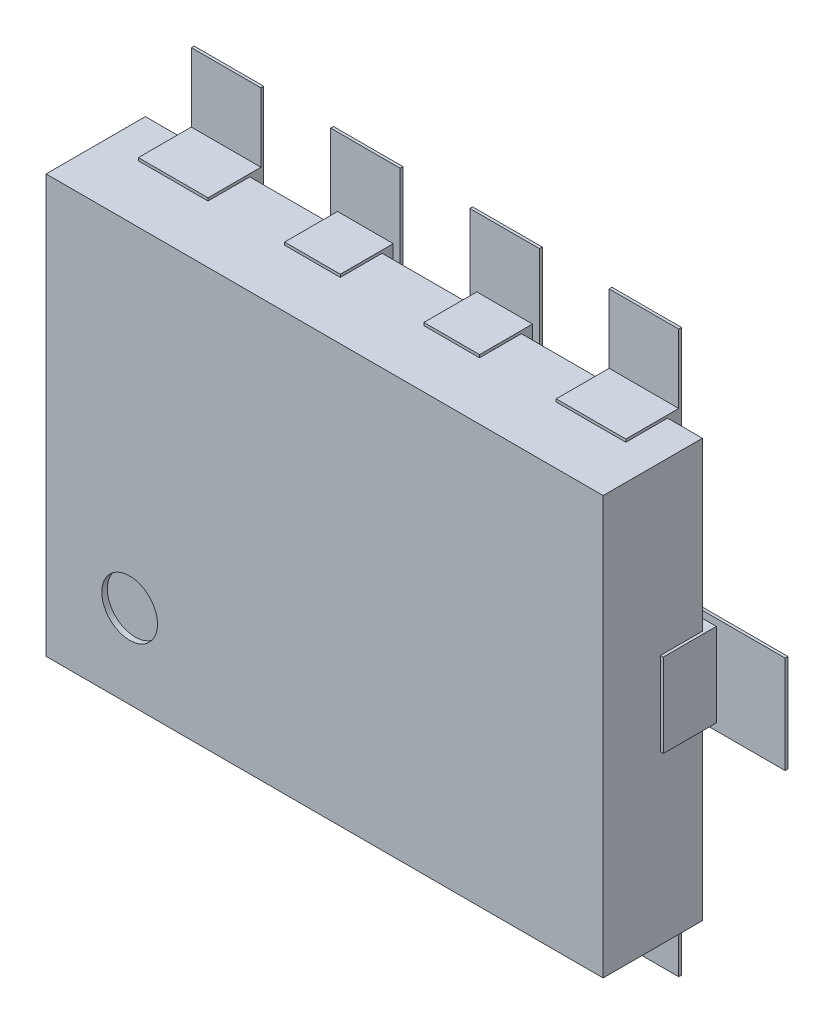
ISO-10303-21;
HEADER;
FILE_DESCRIPTION(('STEP AP214'),'2;1');
FILE_NAME('part.step','',(''),(''),'','','');
FILE_SCHEMA(('AUTOMOTIVE_DESIGN { 1 0 10303 214 1 1 1 1 }'));
ENDSEC;
DATA;
#1=APPLICATION_CONTEXT('core data for automotive mechanical design processes');
#2=APPLICATION_PROTOCOL_DEFINITION('international standard','automotive_design',2000,#1);
#3=PRODUCT_CONTEXT('',#1,'mechanical');
#4=PRODUCT('Part','Part','',(#3));
#5=PRODUCT_RELATED_PRODUCT_CATEGORY('part','',(#4));
#6=PRODUCT_DEFINITION_FORMATION('','',#4);
#7=PRODUCT_DEFINITION_CONTEXT('part definition',#1,'design');
#8=PRODUCT_DEFINITION('design','',#6,#7);
#9=PRODUCT_DEFINITION_SHAPE('','',#8);
#10=(LENGTH_UNIT() NAMED_UNIT(*) SI_UNIT(.MILLI.,.METRE.));
#11=(NAMED_UNIT(*) PLANE_ANGLE_UNIT() SI_UNIT($,.RADIAN.));
#12=(NAMED_UNIT(*) SI_UNIT($,.STERADIAN.) SOLID_ANGLE_UNIT());
#13=UNCERTAINTY_MEASURE_WITH_UNIT(LENGTH_MEASURE(1.E-05),#10,'distance_accuracy_value','');
#14=(GEOMETRIC_REPRESENTATION_CONTEXT(3) GLOBAL_UNCERTAINTY_ASSIGNED_CONTEXT((#13)) GLOBAL_UNIT_ASSIGNED_CONTEXT((#10,
#11,#12)) REPRESENTATION_CONTEXT('',''));
#15=CARTESIAN_POINT('',(0.,0.,0.));
#16=DIRECTION('',(0.,0.,1.));
#17=DIRECTION('',(1.,0.,0.));
#18=AXIS2_PLACEMENT_3D('',#15,#16,#17);
#19=CARTESIAN_POINT('',(0.,0.,0.0762));
#20=DIRECTION('',(0.,0.,1.));
#21=DIRECTION('',(1.,0.,0.));
#22=AXIS2_PLACEMENT_3D('',#19,#20,#21);
#23=PLANE('',#22);
#24=DIRECTION('',(1.,0.,0.));
#25=VECTOR('',#24,1.);
#26=CARTESIAN_POINT('',(-0.125000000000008,-0.396999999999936,0.0762));
#27=LINE('',#26,#25);
#28=CARTESIAN_POINT('',(-0.125000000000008,-0.396999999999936,0.0762));
#29=VERTEX_POINT('',#28);
#30=CARTESIAN_POINT('',(-0.375000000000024,-0.396999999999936,0.0762));
#31=VERTEX_POINT('',#30);
#32=EDGE_CURVE('E653',#29,#31,#27,.F.);
#33=ORIENTED_EDGE('',*,*,#32,.F.);
#34=DIRECTION('',(0.,1.,0.));
#35=VECTOR('',#34,1.);
#36=CARTESIAN_POINT('',(-0.125000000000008,-1.00700000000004,0.0762));
#37=LINE('',#36,#35);
#38=CARTESIAN_POINT('',(-0.125000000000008,-1.00700000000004,0.0762));
#39=VERTEX_POINT('',#38);
#40=EDGE_CURVE('E658',#39,#29,#37,.T.);
#41=ORIENTED_EDGE('',*,*,#40,.F.);
#42=DIRECTION('',(1.,0.,0.));
#43=VECTOR('',#42,1.);
#44=CARTESIAN_POINT('',(-0.375000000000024,-1.00700000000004,0.0762));
#45=LINE('',#44,#43);
#46=CARTESIAN_POINT('',(-0.375000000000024,-1.00700000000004,0.0762));
#47=VERTEX_POINT('',#46);
#48=EDGE_CURVE('E684',#47,#39,#45,.T.);
#49=ORIENTED_EDGE('',*,*,#48,.F.);
#50=DIRECTION('',(0.,1.,0.));
#51=VECTOR('',#50,1.);
#52=CARTESIAN_POINT('',(-0.375000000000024,-0.396999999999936,0.0762));
#53=LINE('',#52,#51);
#54=EDGE_CURVE('E668',#31,#47,#53,.F.);
#55=ORIENTED_EDGE('',*,*,#54,.F.);
#56=EDGE_LOOP('',(#33,#41,#49,#55));
#57=FACE_BOUND('',#56,.T.);
#58=ADVANCED_FACE('F16',(#57),#23,.F.);
#59=CARTESIAN_POINT('',(0.,0.,0.0762));
#60=DIRECTION('',(0.,0.,1.));
#61=DIRECTION('',(1.,0.,0.));
#62=AXIS2_PLACEMENT_3D('',#59,#60,#61);
#63=PLANE('',#62);
#64=DIRECTION('',(1.,0.,0.));
#65=VECTOR('',#64,1.);
#66=CARTESIAN_POINT('',(0.375000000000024,-0.396999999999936,0.0762));
#67=LINE('',#66,#65);
#68=CARTESIAN_POINT('',(0.375000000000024,-0.396999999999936,0.0762));
#69=VERTEX_POINT('',#68);
#70=CARTESIAN_POINT('',(0.125000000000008,-0.396999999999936,0.0762));
#71=VERTEX_POINT('',#70);
#72=EDGE_CURVE('E691',#69,#71,#67,.F.);
#73=ORIENTED_EDGE('',*,*,#72,.F.);
#74=DIRECTION('',(0.,1.,0.));
#75=VECTOR('',#74,1.);
#76=CARTESIAN_POINT('',(0.375000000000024,-1.00700000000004,0.0762));
#77=LINE('',#76,#75);
#78=CARTESIAN_POINT('',(0.375000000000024,-1.00700000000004,0.0762));
#79=VERTEX_POINT('',#78);
#80=EDGE_CURVE('E686',#79,#69,#77,.T.);
#81=ORIENTED_EDGE('',*,*,#80,.F.);
#82=DIRECTION('',(1.,0.,0.));
#83=VECTOR('',#82,1.);
#84=CARTESIAN_POINT('',(0.125000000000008,-1.00700000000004,0.0762));
#85=LINE('',#84,#83);
#86=CARTESIAN_POINT('',(0.125000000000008,-1.00700000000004,0.0762));
#87=VERTEX_POINT('',#86);
#88=EDGE_CURVE('E704',#87,#79,#85,.T.);
#89=ORIENTED_EDGE('',*,*,#88,.F.);
#90=DIRECTION('',(0.,1.,0.));
#91=VECTOR('',#90,1.);
#92=CARTESIAN_POINT('',(0.125000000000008,-0.396999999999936,0.0762));
#93=LINE('',#92,#91);
#94=EDGE_CURVE('E696',#71,#87,#93,.F.);
#95=ORIENTED_EDGE('',*,*,#94,.F.);
#96=EDGE_LOOP('',(#73,#81,#89,#95));
#97=FACE_BOUND('',#96,.T.);
#98=ADVANCED_FACE('F1970',(#97),#63,.F.);
#99=CARTESIAN_POINT('',(0.,0.,0.0762));
#100=DIRECTION('',(0.,0.,1.));
#101=DIRECTION('',(1.,0.,0.));
#102=AXIS2_PLACEMENT_3D('',#99,#100,#101);
#103=PLANE('',#102);
#104=DIRECTION('',(0.,1.,0.));
#105=VECTOR('',#104,1.);
#106=CARTESIAN_POINT('',(0.547000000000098,0.175000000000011,0.0762));
#107=LINE('',#106,#105);
#108=CARTESIAN_POINT('',(0.547000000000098,0.175000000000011,0.0762));
#109=VERTEX_POINT('',#108);
#110=CARTESIAN_POINT('',(0.547000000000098,-0.175000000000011,0.0762));
#111=VERTEX_POINT('',#110);
#112=EDGE_CURVE('E712',#109,#111,#107,.F.);
#113=ORIENTED_EDGE('',*,*,#112,.F.);
#114=DIRECTION('',(1.,0.,0.));
#115=VECTOR('',#114,1.);
#116=CARTESIAN_POINT('',(1.25700000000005,0.175000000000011,0.0762));
#117=LINE('',#116,#115);
#118=CARTESIAN_POINT('',(1.25700000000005,0.175000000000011,0.0762));
#119=VERTEX_POINT('',#118);
#120=EDGE_CURVE('E707',#119,#109,#117,.F.);
#121=ORIENTED_EDGE('',*,*,#120,.F.);
#122=DIRECTION('',(0.,1.,0.));
#123=VECTOR('',#122,1.);
#124=CARTESIAN_POINT('',(1.25700000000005,-0.175000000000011,0.0762));
#125=LINE('',#124,#123);
#126=CARTESIAN_POINT('',(1.25700000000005,-0.175000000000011,0.0762));
#127=VERTEX_POINT('',#126);
#128=EDGE_CURVE('E725',#127,#119,#125,.T.);
#129=ORIENTED_EDGE('',*,*,#128,.F.);
#130=DIRECTION('',(1.,0.,0.));
#131=VECTOR('',#130,1.);
#132=CARTESIAN_POINT('',(0.547000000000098,-0.175000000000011,0.0762));
#133=LINE('',#132,#131);
#134=EDGE_CURVE('E717',#111,#127,#133,.T.);
#135=ORIENTED_EDGE('',*,*,#134,.F.);
#136=EDGE_LOOP('',(#113,#121,#129,#135));
#137=FACE_BOUND('',#136,.T.);
#138=ADVANCED_FACE('F1967',(#137),#103,.F.);
#139=CARTESIAN_POINT('',(0.,0.,0.0762));
#140=DIRECTION('',(0.,0.,1.));
#141=DIRECTION('',(1.,0.,0.));
#142=AXIS2_PLACEMENT_3D('',#139,#140,#141);
#143=PLANE('',#142);
#144=DIRECTION('',(1.,0.,0.));
#145=VECTOR('',#144,1.);
#146=CARTESIAN_POINT('',(0.125000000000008,0.396999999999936,0.0762));
#147=LINE('',#146,#145);
#148=CARTESIAN_POINT('',(0.125000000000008,0.396999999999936,0.0762));
#149=VERTEX_POINT('',#148);
#150=CARTESIAN_POINT('',(0.375000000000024,0.396999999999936,0.0762));
#151=VERTEX_POINT('',#150);
#152=EDGE_CURVE('E733',#149,#151,#147,.T.);
#153=ORIENTED_EDGE('',*,*,#152,.F.);
#154=DIRECTION('',(0.,1.,0.));
#155=VECTOR('',#154,1.);
#156=CARTESIAN_POINT('',(0.125000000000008,1.00700000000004,0.0762));
#157=LINE('',#156,#155);
#158=CARTESIAN_POINT('',(0.125000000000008,1.00700000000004,0.0762));
#159=VERTEX_POINT('',#158);
#160=EDGE_CURVE('E728',#159,#149,#157,.F.);
#161=ORIENTED_EDGE('',*,*,#160,.F.);
#162=DIRECTION('',(1.,0.,0.));
#163=VECTOR('',#162,1.);
#164=CARTESIAN_POINT('',(0.375000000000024,1.00700000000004,0.0762));
#165=LINE('',#164,#163);
#166=CARTESIAN_POINT('',(0.375000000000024,1.00700000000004,0.0762));
#167=VERTEX_POINT('',#166);
#168=EDGE_CURVE('E746',#167,#159,#165,.F.);
#169=ORIENTED_EDGE('',*,*,#168,.F.);
#170=DIRECTION('',(0.,1.,0.));
#171=VECTOR('',#170,1.);
#172=CARTESIAN_POINT('',(0.375000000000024,0.396999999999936,0.0762));
#173=LINE('',#172,#171);
#174=EDGE_CURVE('E738',#151,#167,#173,.T.);
#175=ORIENTED_EDGE('',*,*,#174,.F.);
#176=EDGE_LOOP('',(#153,#161,#169,#175));
#177=FACE_BOUND('',#176,.T.);
#178=ADVANCED_FACE('F1963',(#177),#143,.F.);
#179=CARTESIAN_POINT('',(0.,0.,0.0762));
#180=DIRECTION('',(0.,0.,1.));
#181=DIRECTION('',(1.,0.,0.));
#182=AXIS2_PLACEMENT_3D('',#179,#180,#181);
#183=PLANE('',#182);
#184=DIRECTION('',(1.,0.,0.));
#185=VECTOR('',#184,1.);
#186=CARTESIAN_POINT('',(-0.375000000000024,0.396999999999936,0.0762));
#187=LINE('',#186,#185);
#188=CARTESIAN_POINT('',(-0.375000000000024,0.396999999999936,0.0762));
#189=VERTEX_POINT('',#188);
#190=CARTESIAN_POINT('',(-0.125000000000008,0.396999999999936,0.0762));
#191=VERTEX_POINT('',#190);
#192=EDGE_CURVE('E754',#189,#191,#187,.T.);
#193=ORIENTED_EDGE('',*,*,#192,.F.);
#194=DIRECTION('',(0.,1.,0.));
#195=VECTOR('',#194,1.);
#196=CARTESIAN_POINT('',(-0.375000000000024,1.00700000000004,0.0762));
#197=LINE('',#196,#195);
#198=CARTESIAN_POINT('',(-0.375000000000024,1.00700000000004,0.0762));
#199=VERTEX_POINT('',#198);
#200=EDGE_CURVE('E749',#199,#189,#197,.F.);
#201=ORIENTED_EDGE('',*,*,#200,.F.);
#202=DIRECTION('',(1.,0.,0.));
#203=VECTOR('',#202,1.);
#204=CARTESIAN_POINT('',(-0.125000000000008,1.00700000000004,0.0762));
#205=LINE('',#204,#203);
#206=CARTESIAN_POINT('',(-0.125000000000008,1.00700000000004,0.0762));
#207=VERTEX_POINT('',#206);
#208=EDGE_CURVE('E767',#207,#199,#205,.F.);
#209=ORIENTED_EDGE('',*,*,#208,.F.);
#210=DIRECTION('',(0.,1.,0.));
#211=VECTOR('',#210,1.);
#212=CARTESIAN_POINT('',(-0.125000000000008,0.396999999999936,0.0762));
#213=LINE('',#212,#211);
#214=EDGE_CURVE('E759',#191,#207,#213,.T.);
#215=ORIENTED_EDGE('',*,*,#214,.F.);
#216=EDGE_LOOP('',(#193,#201,#209,#215));
#217=FACE_BOUND('',#216,.T.);
#218=ADVANCED_FACE('F1959',(#217),#183,.F.);
#219=CARTESIAN_POINT('',(0.,0.,0.0762));
#220=DIRECTION('',(0.,0.,1.));
#221=DIRECTION('',(1.,0.,0.));
#222=AXIS2_PLACEMENT_3D('',#219,#220,#221);
#223=PLANE('',#222);
#224=DIRECTION('',(0.,1.,0.));
#225=VECTOR('',#224,1.);
#226=CARTESIAN_POINT('',(-0.547000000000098,-0.175000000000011,0.0762));
#227=LINE('',#226,#225);
#228=CARTESIAN_POINT('',(-0.547000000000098,-0.175000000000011,0.0762));
#229=VERTEX_POINT('',#228);
#230=CARTESIAN_POINT('',(-0.547000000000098,0.175000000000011,0.0762));
#231=VERTEX_POINT('',#230);
#232=EDGE_CURVE('E775',#229,#231,#227,.T.);
#233=ORIENTED_EDGE('',*,*,#232,.F.);
#234=DIRECTION('',(1.,0.,0.));
#235=VECTOR('',#234,1.);
#236=CARTESIAN_POINT('',(-1.25700000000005,-0.175000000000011,0.0762));
#237=LINE('',#236,#235);
#238=CARTESIAN_POINT('',(-1.25700000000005,-0.175000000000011,0.0762));
#239=VERTEX_POINT('',#238);
#240=EDGE_CURVE('E770',#239,#229,#237,.T.);
#241=ORIENTED_EDGE('',*,*,#240,.F.);
#242=DIRECTION('',(0.,1.,0.));
#243=VECTOR('',#242,1.);
#244=CARTESIAN_POINT('',(-1.25700000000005,0.175000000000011,0.0762));
#245=LINE('',#244,#243);
#246=CARTESIAN_POINT('',(-1.25700000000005,0.175000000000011,0.0762));
#247=VERTEX_POINT('',#246);
#248=EDGE_CURVE('E788',#247,#239,#245,.F.);
#249=ORIENTED_EDGE('',*,*,#248,.F.);
#250=DIRECTION('',(1.,0.,0.));
#251=VECTOR('',#250,1.);
#252=CARTESIAN_POINT('',(-0.547000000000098,0.175000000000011,0.0762));
#253=LINE('',#252,#251);
#254=EDGE_CURVE('E780',#231,#247,#253,.F.);
#255=ORIENTED_EDGE('',*,*,#254,.F.);
#256=EDGE_LOOP('',(#233,#241,#249,#255));
#257=FACE_BOUND('',#256,.T.);
#258=ADVANCED_FACE('F1956',(#257),#223,.F.);
#259=CARTESIAN_POINT('',(-0.125000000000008,-1.00700000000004,0.0762));
#260=DIRECTION('',(1.,0.,0.));
#261=DIRECTION('',(0.,0.,-1.));
#262=AXIS2_PLACEMENT_3D('',#259,#260,#261);
#263=PLANE('',#262);
#264=DIRECTION('',(0.,0.,-1.));
#265=VECTOR('',#264,1.);
#266=CARTESIAN_POINT('',(-0.125000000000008,-1.00700000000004,0.0762));
#267=LINE('',#266,#265);
#268=CARTESIAN_POINT('',(-0.125000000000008,-1.00700000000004,0.0862000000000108));
#269=VERTEX_POINT('',#268);
#270=EDGE_CURVE('E663',#39,#269,#267,.F.);
#271=ORIENTED_EDGE('',*,*,#270,.F.);
#272=ORIENTED_EDGE('',*,*,#40,.T.);
#273=DIRECTION('',(0.,0.,1.));
#274=VECTOR('',#273,1.);
#275=CARTESIAN_POINT('',(-0.125000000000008,-0.396999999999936,0.0762));
#276=LINE('',#275,#274);
#277=CARTESIAN_POINT('',(-0.125000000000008,-0.396999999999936,0.0862000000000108));
#278=VERTEX_POINT('',#277);
#279=EDGE_CURVE('E660',#278,#29,#276,.F.);
#280=ORIENTED_EDGE('',*,*,#279,.F.);
#281=DIRECTION('',(0.,1.,0.));
#282=VECTOR('',#281,1.);
#283=CARTESIAN_POINT('',(-0.125000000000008,0.,0.0862000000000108));
#284=LINE('',#283,#282);
#285=EDGE_CURVE('E791',#269,#278,#284,.T.);
#286=ORIENTED_EDGE('',*,*,#285,.F.);
#287=EDGE_LOOP('',(#271,#272,#280,#286));
#288=FACE_BOUND('',#287,.T.);
#289=ADVANCED_FACE('F659',(#288),#263,.T.);
#290=CARTESIAN_POINT('',(-0.125000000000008,-0.396999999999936,0.0762));
#291=DIRECTION('',(0.,1.,0.));
#292=DIRECTION('',(0.,0.,1.));
#293=AXIS2_PLACEMENT_3D('',#290,#291,#292);
#294=PLANE('',#293);
#295=ORIENTED_EDGE('',*,*,#279,.T.);
#296=ORIENTED_EDGE('',*,*,#32,.T.);
#297=DIRECTION('',(0.,0.,1.));
#298=VECTOR('',#297,1.);
#299=CARTESIAN_POINT('',(-0.375000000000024,-0.396999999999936,0.0762));
#300=LINE('',#299,#298);
#301=CARTESIAN_POINT('',(-0.375000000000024,-0.396999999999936,0.0862000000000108));
#302=VERTEX_POINT('',#301);
#303=EDGE_CURVE('E670',#302,#31,#300,.F.);
#304=ORIENTED_EDGE('',*,*,#303,.F.);
#305=DIRECTION('',(1.,0.,0.));
#306=VECTOR('',#305,1.);
#307=CARTESIAN_POINT('',(0.,-0.396999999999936,0.0862000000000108));
#308=LINE('',#307,#306);
#309=EDGE_CURVE('E674',#278,#302,#308,.F.);
#310=ORIENTED_EDGE('',*,*,#309,.F.);
#311=EDGE_LOOP('',(#295,#296,#304,#310));
#312=FACE_BOUND('',#311,.T.);
#313=ADVANCED_FACE('F672',(#312),#294,.T.);
#314=CARTESIAN_POINT('',(-0.375000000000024,-0.396999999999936,0.0762));
#315=DIRECTION('',(-1.,0.,0.));
#316=DIRECTION('',(0.,0.,1.));
#317=AXIS2_PLACEMENT_3D('',#314,#315,#316);
#318=PLANE('',#317);
#319=ORIENTED_EDGE('',*,*,#303,.T.);
#320=ORIENTED_EDGE('',*,*,#54,.T.);
#321=DIRECTION('',(0.,0.,-1.));
#322=VECTOR('',#321,1.);
#323=CARTESIAN_POINT('',(-0.375000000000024,-1.00700000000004,0.0762));
#324=LINE('',#323,#322);
#325=CARTESIAN_POINT('',(-0.375000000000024,-1.00700000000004,0.0862000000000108));
#326=VERTEX_POINT('',#325);
#327=EDGE_CURVE('E681',#326,#47,#324,.T.);
#328=ORIENTED_EDGE('',*,*,#327,.F.);
#329=DIRECTION('',(0.,1.,0.));
#330=VECTOR('',#329,1.);
#331=CARTESIAN_POINT('',(-0.375000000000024,0.,0.0862000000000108));
#332=LINE('',#331,#330);
#333=EDGE_CURVE('E794',#302,#326,#332,.F.);
#334=ORIENTED_EDGE('',*,*,#333,.F.);
#335=EDGE_LOOP('',(#319,#320,#328,#334));
#336=FACE_BOUND('',#335,.T.);
#337=ADVANCED_FACE('F1947',(#336),#318,.T.);
#338=CARTESIAN_POINT('',(-0.375000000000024,-1.00700000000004,0.0762));
#339=DIRECTION('',(0.,-1.,0.));
#340=DIRECTION('',(0.,0.,-1.));
#341=AXIS2_PLACEMENT_3D('',#338,#339,#340);
#342=PLANE('',#341);
#343=ORIENTED_EDGE('',*,*,#327,.T.);
#344=ORIENTED_EDGE('',*,*,#48,.T.);
#345=ORIENTED_EDGE('',*,*,#270,.T.);
#346=DIRECTION('',(1.,0.,0.));
#347=VECTOR('',#346,1.);
#348=CARTESIAN_POINT('',(0.,-1.00700000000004,0.0862000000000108));
#349=LINE('',#348,#347);
#350=EDGE_CURVE('E797',#326,#269,#349,.T.);
#351=ORIENTED_EDGE('',*,*,#350,.F.);
#352=EDGE_LOOP('',(#343,#344,#345,#351));
#353=FACE_BOUND('',#352,.T.);
#354=ADVANCED_FACE('F1943',(#353),#342,.T.);
#355=CARTESIAN_POINT('',(0.375000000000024,-1.00700000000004,0.0762));
#356=DIRECTION('',(1.,0.,0.));
#357=DIRECTION('',(0.,0.,-1.));
#358=AXIS2_PLACEMENT_3D('',#355,#356,#357);
#359=PLANE('',#358);
#360=DIRECTION('',(0.,0.,-1.));
#361=VECTOR('',#360,1.);
#362=CARTESIAN_POINT('',(0.375000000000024,-1.00700000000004,0.0762));
#363=LINE('',#362,#361);
#364=CARTESIAN_POINT('',(0.375000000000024,-1.00700000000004,0.0862000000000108));
#365=VERTEX_POINT('',#364);
#366=EDGE_CURVE('E698',#79,#365,#363,.F.);
#367=ORIENTED_EDGE('',*,*,#366,.F.);
#368=ORIENTED_EDGE('',*,*,#80,.T.);
#369=DIRECTION('',(0.,0.,1.));
#370=VECTOR('',#369,1.);
#371=CARTESIAN_POINT('',(0.375000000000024,-0.396999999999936,0.0762));
#372=LINE('',#371,#370);
#373=CARTESIAN_POINT('',(0.375000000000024,-0.396999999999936,0.0862000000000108));
#374=VERTEX_POINT('',#373);
#375=EDGE_CURVE('E688',#374,#69,#372,.F.);
#376=ORIENTED_EDGE('',*,*,#375,.F.);
#377=DIRECTION('',(0.,1.,0.));
#378=VECTOR('',#377,1.);
#379=CARTESIAN_POINT('',(0.375000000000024,0.,0.0862000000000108));
#380=LINE('',#379,#378);
#381=EDGE_CURVE('E803',#365,#374,#380,.T.);
#382=ORIENTED_EDGE('',*,*,#381,.F.);
#383=EDGE_LOOP('',(#367,#368,#376,#382));
#384=FACE_BOUND('',#383,.T.);
#385=ADVANCED_FACE('F1939',(#384),#359,.T.);
#386=CARTESIAN_POINT('',(0.375000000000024,-0.396999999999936,0.0762));
#387=DIRECTION('',(0.,1.,0.));
#388=DIRECTION('',(0.,0.,1.));
#389=AXIS2_PLACEMENT_3D('',#386,#387,#388);
#390=PLANE('',#389);
#391=ORIENTED_EDGE('',*,*,#375,.T.);
#392=ORIENTED_EDGE('',*,*,#72,.T.);
#393=DIRECTION('',(0.,0.,1.));
#394=VECTOR('',#393,1.);
#395=CARTESIAN_POINT('',(0.125000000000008,-0.396999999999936,0.0762));
#396=LINE('',#395,#394);
#397=CARTESIAN_POINT('',(0.125000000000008,-0.396999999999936,0.0862000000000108));
#398=VERTEX_POINT('',#397);
#399=EDGE_CURVE('E693',#398,#71,#396,.F.);
#400=ORIENTED_EDGE('',*,*,#399,.F.);
#401=DIRECTION('',(1.,0.,0.));
#402=VECTOR('',#401,1.);
#403=CARTESIAN_POINT('',(0.,-0.396999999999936,0.0862000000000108));
#404=LINE('',#403,#402);
#405=EDGE_CURVE('E806',#374,#398,#404,.F.);
#406=ORIENTED_EDGE('',*,*,#405,.F.);
#407=EDGE_LOOP('',(#391,#392,#400,#406));
#408=FACE_BOUND('',#407,.T.);
#409=ADVANCED_FACE('F1935',(#408),#390,.T.);
#410=CARTESIAN_POINT('',(0.125000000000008,-0.396999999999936,0.0762));
#411=DIRECTION('',(-1.,0.,0.));
#412=DIRECTION('',(0.,0.,1.));
#413=AXIS2_PLACEMENT_3D('',#410,#411,#412);
#414=PLANE('',#413);
#415=ORIENTED_EDGE('',*,*,#399,.T.);
#416=ORIENTED_EDGE('',*,*,#94,.T.);
#417=DIRECTION('',(0.,0.,-1.));
#418=VECTOR('',#417,1.);
#419=CARTESIAN_POINT('',(0.125000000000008,-1.00700000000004,0.0762));
#420=LINE('',#419,#418);
#421=CARTESIAN_POINT('',(0.125000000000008,-1.00700000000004,0.0862000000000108));
#422=VERTEX_POINT('',#421);
#423=EDGE_CURVE('E701',#422,#87,#420,.T.);
#424=ORIENTED_EDGE('',*,*,#423,.F.);
#425=DIRECTION('',(0.,1.,0.));
#426=VECTOR('',#425,1.);
#427=CARTESIAN_POINT('',(0.125000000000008,0.,0.0862000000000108));
#428=LINE('',#427,#426);
#429=EDGE_CURVE('E809',#398,#422,#428,.F.);
#430=ORIENTED_EDGE('',*,*,#429,.F.);
#431=EDGE_LOOP('',(#415,#416,#424,#430));
#432=FACE_BOUND('',#431,.T.);
#433=ADVANCED_FACE('F1931',(#432),#414,.T.);
#434=CARTESIAN_POINT('',(0.125000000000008,-1.00700000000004,0.0762));
#435=DIRECTION('',(0.,-1.,0.));
#436=DIRECTION('',(0.,0.,-1.));
#437=AXIS2_PLACEMENT_3D('',#434,#435,#436);
#438=PLANE('',#437);
#439=ORIENTED_EDGE('',*,*,#423,.T.);
#440=ORIENTED_EDGE('',*,*,#88,.T.);
#441=ORIENTED_EDGE('',*,*,#366,.T.);
#442=DIRECTION('',(1.,0.,0.));
#443=VECTOR('',#442,1.);
#444=CARTESIAN_POINT('',(0.,-1.00700000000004,0.0862000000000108));
#445=LINE('',#444,#443);
#446=EDGE_CURVE('E812',#422,#365,#445,.T.);
#447=ORIENTED_EDGE('',*,*,#446,.F.);
#448=EDGE_LOOP('',(#439,#440,#441,#447));
#449=FACE_BOUND('',#448,.T.);
#450=ADVANCED_FACE('F1927',(#449),#438,.T.);
#451=CARTESIAN_POINT('',(1.25700000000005,0.175000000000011,0.0762));
#452=DIRECTION('',(0.,1.,0.));
#453=DIRECTION('',(0.,0.,1.));
#454=AXIS2_PLACEMENT_3D('',#451,#452,#453);
#455=PLANE('',#454);
#456=DIRECTION('',(0.,0.,-1.));
#457=VECTOR('',#456,1.);
#458=CARTESIAN_POINT('',(1.25700000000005,0.175000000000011,0.0762));
#459=LINE('',#458,#457);
#460=CARTESIAN_POINT('',(1.25700000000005,0.175000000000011,0.0862000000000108));
#461=VERTEX_POINT('',#460);
#462=EDGE_CURVE('E719',#119,#461,#459,.F.);
#463=ORIENTED_EDGE('',*,*,#462,.F.);
#464=ORIENTED_EDGE('',*,*,#120,.T.);
#465=DIRECTION('',(0.,0.,1.));
#466=VECTOR('',#465,1.);
#467=CARTESIAN_POINT('',(0.547000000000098,0.175000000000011,0.0762));
#468=LINE('',#467,#466);
#469=CARTESIAN_POINT('',(0.547000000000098,0.175000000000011,0.0862000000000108));
#470=VERTEX_POINT('',#469);
#471=EDGE_CURVE('E709',#470,#109,#468,.F.);
#472=ORIENTED_EDGE('',*,*,#471,.F.);
#473=DIRECTION('',(1.,0.,0.));
#474=VECTOR('',#473,1.);
#475=CARTESIAN_POINT('',(0.,0.175000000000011,0.0862000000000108));
#476=LINE('',#475,#474);
#477=EDGE_CURVE('E838',#461,#470,#476,.F.);
#478=ORIENTED_EDGE('',*,*,#477,.F.);
#479=EDGE_LOOP('',(#463,#464,#472,#478));
#480=FACE_BOUND('',#479,.T.);
#481=ADVANCED_FACE('F1923',(#480),#455,.T.);
#482=CARTESIAN_POINT('',(0.547000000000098,0.175000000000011,0.0762));
#483=DIRECTION('',(-1.,0.,0.));
#484=DIRECTION('',(0.,0.,1.));
#485=AXIS2_PLACEMENT_3D('',#482,#483,#484);
#486=PLANE('',#485);
#487=ORIENTED_EDGE('',*,*,#471,.T.);
#488=ORIENTED_EDGE('',*,*,#112,.T.);
#489=DIRECTION('',(0.,0.,-1.));
#490=VECTOR('',#489,1.);
#491=CARTESIAN_POINT('',(0.547000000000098,-0.175000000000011,0.0762));
#492=LINE('',#491,#490);
#493=CARTESIAN_POINT('',(0.547000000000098,-0.175000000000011,0.0862000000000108));
#494=VERTEX_POINT('',#493);
#495=EDGE_CURVE('E714',#494,#111,#492,.T.);
#496=ORIENTED_EDGE('',*,*,#495,.F.);
#497=DIRECTION('',(0.,1.,0.));
#498=VECTOR('',#497,1.);
#499=CARTESIAN_POINT('',(0.547000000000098,0.,0.0862000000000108));
#500=LINE('',#499,#498);
#501=EDGE_CURVE('E841',#470,#494,#500,.F.);
#502=ORIENTED_EDGE('',*,*,#501,.F.);
#503=EDGE_LOOP('',(#487,#488,#496,#502));
#504=FACE_BOUND('',#503,.T.);
#505=ADVANCED_FACE('F1919',(#504),#486,.T.);
#506=CARTESIAN_POINT('',(0.547000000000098,-0.175000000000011,0.0762));
#507=DIRECTION('',(0.,-1.,0.));
#508=DIRECTION('',(0.,0.,-1.));
#509=AXIS2_PLACEMENT_3D('',#506,#507,#508);
#510=PLANE('',#509);
#511=ORIENTED_EDGE('',*,*,#495,.T.);
#512=ORIENTED_EDGE('',*,*,#134,.T.);
#513=DIRECTION('',(0.,0.,-1.));
#514=VECTOR('',#513,1.);
#515=CARTESIAN_POINT('',(1.25700000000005,-0.175000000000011,0.0762));
#516=LINE('',#515,#514);
#517=CARTESIAN_POINT('',(1.25700000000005,-0.175000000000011,0.0862000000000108));
#518=VERTEX_POINT('',#517);
#519=EDGE_CURVE('E722',#518,#127,#516,.T.);
#520=ORIENTED_EDGE('',*,*,#519,.F.);
#521=DIRECTION('',(1.,0.,0.));
#522=VECTOR('',#521,1.);
#523=CARTESIAN_POINT('',(0.,-0.175000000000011,0.0862000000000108));
#524=LINE('',#523,#522);
#525=EDGE_CURVE('E844',#494,#518,#524,.T.);
#526=ORIENTED_EDGE('',*,*,#525,.F.);
#527=EDGE_LOOP('',(#511,#512,#520,#526));
#528=FACE_BOUND('',#527,.T.);
#529=ADVANCED_FACE('F1915',(#528),#510,.T.);
#530=CARTESIAN_POINT('',(1.25700000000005,-0.175000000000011,0.0762));
#531=DIRECTION('',(1.,0.,0.));
#532=DIRECTION('',(0.,0.,-1.));
#533=AXIS2_PLACEMENT_3D('',#530,#531,#532);
#534=PLANE('',#533);
#535=ORIENTED_EDGE('',*,*,#519,.T.);
#536=ORIENTED_EDGE('',*,*,#128,.T.);
#537=ORIENTED_EDGE('',*,*,#462,.T.);
#538=DIRECTION('',(0.,1.,0.));
#539=VECTOR('',#538,1.);
#540=CARTESIAN_POINT('',(1.25700000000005,0.,0.0862000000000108));
#541=LINE('',#540,#539);
#542=EDGE_CURVE('E847',#518,#461,#541,.T.);
#543=ORIENTED_EDGE('',*,*,#542,.F.);
#544=EDGE_LOOP('',(#535,#536,#537,#543));
#545=FACE_BOUND('',#544,.T.);
#546=ADVANCED_FACE('F1911',(#545),#534,.T.);
#547=CARTESIAN_POINT('',(0.125000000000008,1.00700000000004,0.0762));
#548=DIRECTION('',(-1.,0.,0.));
#549=DIRECTION('',(0.,0.,1.));
#550=AXIS2_PLACEMENT_3D('',#547,#548,#549);
#551=PLANE('',#550);
#552=DIRECTION('',(0.,0.,1.));
#553=VECTOR('',#552,1.);
#554=CARTESIAN_POINT('',(0.125000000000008,1.00700000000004,0.0762));
#555=LINE('',#554,#553);
#556=CARTESIAN_POINT('',(0.125000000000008,1.00700000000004,0.0862000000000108));
#557=VERTEX_POINT('',#556);
#558=EDGE_CURVE('E740',#159,#557,#555,.T.);
#559=ORIENTED_EDGE('',*,*,#558,.F.);
#560=ORIENTED_EDGE('',*,*,#160,.T.);
#561=DIRECTION('',(0.,0.,-1.));
#562=VECTOR('',#561,1.);
#563=CARTESIAN_POINT('',(0.125000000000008,0.396999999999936,0.0762));
#564=LINE('',#563,#562);
#565=CARTESIAN_POINT('',(0.125000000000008,0.396999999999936,0.0862000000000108));
#566=VERTEX_POINT('',#565);
#567=EDGE_CURVE('E730',#566,#149,#564,.T.);
#568=ORIENTED_EDGE('',*,*,#567,.F.);
#569=DIRECTION('',(0.,1.,0.));
#570=VECTOR('',#569,1.);
#571=CARTESIAN_POINT('',(0.125000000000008,0.,0.0862000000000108));
#572=LINE('',#571,#570);
#573=EDGE_CURVE('E852',#557,#566,#572,.F.);
#574=ORIENTED_EDGE('',*,*,#573,.F.);
#575=EDGE_LOOP('',(#559,#560,#568,#574));
#576=FACE_BOUND('',#575,.T.);
#577=ADVANCED_FACE('F1907',(#576),#551,.T.);
#578=CARTESIAN_POINT('',(0.125000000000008,0.396999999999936,0.0762));
#579=DIRECTION('',(0.,-1.,0.));
#580=DIRECTION('',(0.,0.,-1.));
#581=AXIS2_PLACEMENT_3D('',#578,#579,#580);
#582=PLANE('',#581);
#583=ORIENTED_EDGE('',*,*,#567,.T.);
#584=ORIENTED_EDGE('',*,*,#152,.T.);
#585=DIRECTION('',(0.,0.,-1.));
#586=VECTOR('',#585,1.);
#587=CARTESIAN_POINT('',(0.375000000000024,0.396999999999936,0.0762));
#588=LINE('',#587,#586);
#589=CARTESIAN_POINT('',(0.375000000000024,0.396999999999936,0.0862000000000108));
#590=VERTEX_POINT('',#589);
#591=EDGE_CURVE('E735',#590,#151,#588,.T.);
#592=ORIENTED_EDGE('',*,*,#591,.F.);
#593=DIRECTION('',(1.,0.,0.));
#594=VECTOR('',#593,1.);
#595=CARTESIAN_POINT('',(0.,0.396999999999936,0.0862000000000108));
#596=LINE('',#595,#594);
#597=EDGE_CURVE('E855',#566,#590,#596,.T.);
#598=ORIENTED_EDGE('',*,*,#597,.F.);
#599=EDGE_LOOP('',(#583,#584,#592,#598));
#600=FACE_BOUND('',#599,.T.);
#601=ADVANCED_FACE('F1903',(#600),#582,.T.);
#602=CARTESIAN_POINT('',(0.375000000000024,0.396999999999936,0.0762));
#603=DIRECTION('',(1.,0.,0.));
#604=DIRECTION('',(0.,0.,-1.));
#605=AXIS2_PLACEMENT_3D('',#602,#603,#604);
#606=PLANE('',#605);
#607=ORIENTED_EDGE('',*,*,#591,.T.);
#608=ORIENTED_EDGE('',*,*,#174,.T.);
#609=DIRECTION('',(0.,0.,1.));
#610=VECTOR('',#609,1.);
#611=CARTESIAN_POINT('',(0.375000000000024,1.00700000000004,0.0762));
#612=LINE('',#611,#610);
#613=CARTESIAN_POINT('',(0.375000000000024,1.00700000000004,0.0862000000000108));
#614=VERTEX_POINT('',#613);
#615=EDGE_CURVE('E743',#614,#167,#612,.F.);
#616=ORIENTED_EDGE('',*,*,#615,.F.);
#617=DIRECTION('',(0.,1.,0.));
#618=VECTOR('',#617,1.);
#619=CARTESIAN_POINT('',(0.375000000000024,0.,0.0862000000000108));
#620=LINE('',#619,#618);
#621=EDGE_CURVE('E858',#590,#614,#620,.T.);
#622=ORIENTED_EDGE('',*,*,#621,.F.);
#623=EDGE_LOOP('',(#607,#608,#616,#622));
#624=FACE_BOUND('',#623,.T.);
#625=ADVANCED_FACE('F1899',(#624),#606,.T.);
#626=CARTESIAN_POINT('',(0.375000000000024,1.00700000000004,0.0762));
#627=DIRECTION('',(0.,1.,0.));
#628=DIRECTION('',(0.,0.,1.));
#629=AXIS2_PLACEMENT_3D('',#626,#627,#628);
#630=PLANE('',#629);
#631=ORIENTED_EDGE('',*,*,#615,.T.);
#632=ORIENTED_EDGE('',*,*,#168,.T.);
#633=ORIENTED_EDGE('',*,*,#558,.T.);
#634=DIRECTION('',(1.,0.,0.));
#635=VECTOR('',#634,1.);
#636=CARTESIAN_POINT('',(0.,1.00700000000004,0.0862000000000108));
#637=LINE('',#636,#635);
#638=EDGE_CURVE('E861',#614,#557,#637,.F.);
#639=ORIENTED_EDGE('',*,*,#638,.F.);
#640=EDGE_LOOP('',(#631,#632,#633,#639));
#641=FACE_BOUND('',#640,.T.);
#642=ADVANCED_FACE('F1895',(#641),#630,.T.);
#643=CARTESIAN_POINT('',(-0.375000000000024,1.00700000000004,0.0762));
#644=DIRECTION('',(-1.,0.,0.));
#645=DIRECTION('',(0.,0.,1.));
#646=AXIS2_PLACEMENT_3D('',#643,#644,#645);
#647=PLANE('',#646);
#648=DIRECTION('',(0.,0.,1.));
#649=VECTOR('',#648,1.);
#650=CARTESIAN_POINT('',(-0.375000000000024,1.00700000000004,0.0762));
#651=LINE('',#650,#649);
#652=CARTESIAN_POINT('',(-0.375000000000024,1.00700000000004,0.0862000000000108));
#653=VERTEX_POINT('',#652);
#654=EDGE_CURVE('E761',#199,#653,#651,.T.);
#655=ORIENTED_EDGE('',*,*,#654,.F.);
#656=ORIENTED_EDGE('',*,*,#200,.T.);
#657=DIRECTION('',(0.,0.,-1.));
#658=VECTOR('',#657,1.);
#659=CARTESIAN_POINT('',(-0.375000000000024,0.396999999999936,0.0762));
#660=LINE('',#659,#658);
#661=CARTESIAN_POINT('',(-0.375000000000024,0.396999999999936,0.0862000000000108));
#662=VERTEX_POINT('',#661);
#663=EDGE_CURVE('E751',#662,#189,#660,.T.);
#664=ORIENTED_EDGE('',*,*,#663,.F.);
#665=DIRECTION('',(0.,1.,0.));
#666=VECTOR('',#665,1.);
#667=CARTESIAN_POINT('',(-0.375000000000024,0.,0.0862000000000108));
#668=LINE('',#667,#666);
#669=EDGE_CURVE('E867',#653,#662,#668,.F.);
#670=ORIENTED_EDGE('',*,*,#669,.F.);
#671=EDGE_LOOP('',(#655,#656,#664,#670));
#672=FACE_BOUND('',#671,.T.);
#673=ADVANCED_FACE('F1891',(#672),#647,.T.);
#674=CARTESIAN_POINT('',(-0.375000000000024,0.396999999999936,0.0762));
#675=DIRECTION('',(0.,-1.,0.));
#676=DIRECTION('',(0.,0.,-1.));
#677=AXIS2_PLACEMENT_3D('',#674,#675,#676);
#678=PLANE('',#677);
#679=ORIENTED_EDGE('',*,*,#663,.T.);
#680=ORIENTED_EDGE('',*,*,#192,.T.);
#681=DIRECTION('',(0.,0.,-1.));
#682=VECTOR('',#681,1.);
#683=CARTESIAN_POINT('',(-0.125000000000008,0.396999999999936,0.0762));
#684=LINE('',#683,#682);
#685=CARTESIAN_POINT('',(-0.125000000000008,0.396999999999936,0.0862000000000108));
#686=VERTEX_POINT('',#685);
#687=EDGE_CURVE('E756',#686,#191,#684,.T.);
#688=ORIENTED_EDGE('',*,*,#687,.F.);
#689=DIRECTION('',(1.,0.,0.));
#690=VECTOR('',#689,1.);
#691=CARTESIAN_POINT('',(0.,0.396999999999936,0.0862000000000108));
#692=LINE('',#691,#690);
#693=EDGE_CURVE('E870',#662,#686,#692,.T.);
#694=ORIENTED_EDGE('',*,*,#693,.F.);
#695=EDGE_LOOP('',(#679,#680,#688,#694));
#696=FACE_BOUND('',#695,.T.);
#697=ADVANCED_FACE('F1887',(#696),#678,.T.);
#698=CARTESIAN_POINT('',(-0.125000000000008,0.396999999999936,0.0762));
#699=DIRECTION('',(1.,0.,0.));
#700=DIRECTION('',(0.,0.,-1.));
#701=AXIS2_PLACEMENT_3D('',#698,#699,#700);
#702=PLANE('',#701);
#703=ORIENTED_EDGE('',*,*,#687,.T.);
#704=ORIENTED_EDGE('',*,*,#214,.T.);
#705=DIRECTION('',(0.,0.,1.));
#706=VECTOR('',#705,1.);
#707=CARTESIAN_POINT('',(-0.125000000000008,1.00700000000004,0.0762));
#708=LINE('',#707,#706);
#709=CARTESIAN_POINT('',(-0.125000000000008,1.00700000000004,0.0862000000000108));
#710=VERTEX_POINT('',#709);
#711=EDGE_CURVE('E764',#710,#207,#708,.F.);
#712=ORIENTED_EDGE('',*,*,#711,.F.);
#713=DIRECTION('',(0.,1.,0.));
#714=VECTOR('',#713,1.);
#715=CARTESIAN_POINT('',(-0.125000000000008,0.,0.0862000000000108));
#716=LINE('',#715,#714);
#717=EDGE_CURVE('E873',#686,#710,#716,.T.);
#718=ORIENTED_EDGE('',*,*,#717,.F.);
#719=EDGE_LOOP('',(#703,#704,#712,#718));
#720=FACE_BOUND('',#719,.T.);
#721=ADVANCED_FACE('F1883',(#720),#702,.T.);
#722=CARTESIAN_POINT('',(-0.125000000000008,1.00700000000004,0.0762));
#723=DIRECTION('',(0.,1.,0.));
#724=DIRECTION('',(0.,0.,1.));
#725=AXIS2_PLACEMENT_3D('',#722,#723,#724);
#726=PLANE('',#725);
#727=ORIENTED_EDGE('',*,*,#711,.T.);
#728=ORIENTED_EDGE('',*,*,#208,.T.);
#729=ORIENTED_EDGE('',*,*,#654,.T.);
#730=DIRECTION('',(1.,0.,0.));
#731=VECTOR('',#730,1.);
#732=CARTESIAN_POINT('',(0.,1.00700000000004,0.0862000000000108));
#733=LINE('',#732,#731);
#734=EDGE_CURVE('E876',#710,#653,#733,.F.);
#735=ORIENTED_EDGE('',*,*,#734,.F.);
#736=EDGE_LOOP('',(#727,#728,#729,#735));
#737=FACE_BOUND('',#736,.T.);
#738=ADVANCED_FACE('F1879',(#737),#726,.T.);
#739=CARTESIAN_POINT('',(-1.25700000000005,-0.175000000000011,0.0762));
#740=DIRECTION('',(0.,-1.,0.));
#741=DIRECTION('',(0.,0.,-1.));
#742=AXIS2_PLACEMENT_3D('',#739,#740,#741);
#743=PLANE('',#742);
#744=DIRECTION('',(0.,0.,1.));
#745=VECTOR('',#744,1.);
#746=CARTESIAN_POINT('',(-1.25700000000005,-0.175000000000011,0.0762));
#747=LINE('',#746,#745);
#748=CARTESIAN_POINT('',(-1.25700000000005,-0.175000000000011,0.0862000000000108));
#749=VERTEX_POINT('',#748);
#750=EDGE_CURVE('E782',#239,#749,#747,.T.);
#751=ORIENTED_EDGE('',*,*,#750,.F.);
#752=ORIENTED_EDGE('',*,*,#240,.T.);
#753=DIRECTION('',(0.,0.,-1.));
#754=VECTOR('',#753,1.);
#755=CARTESIAN_POINT('',(-0.547000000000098,-0.175000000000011,0.0762));
#756=LINE('',#755,#754);
#757=CARTESIAN_POINT('',(-0.547000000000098,-0.175000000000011,0.0862000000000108));
#758=VERTEX_POINT('',#757);
#759=EDGE_CURVE('E772',#758,#229,#756,.T.);
#760=ORIENTED_EDGE('',*,*,#759,.F.);
#761=DIRECTION('',(1.,0.,0.));
#762=VECTOR('',#761,1.);
#763=CARTESIAN_POINT('',(0.,-0.175000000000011,0.0862000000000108));
#764=LINE('',#763,#762);
#765=EDGE_CURVE('E920',#749,#758,#764,.T.);
#766=ORIENTED_EDGE('',*,*,#765,.F.);
#767=EDGE_LOOP('',(#751,#752,#760,#766));
#768=FACE_BOUND('',#767,.T.);
#769=ADVANCED_FACE('F1875',(#768),#743,.T.);
#770=CARTESIAN_POINT('',(-0.547000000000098,-0.175000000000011,0.0762));
#771=DIRECTION('',(1.,0.,0.));
#772=DIRECTION('',(0.,0.,-1.));
#773=AXIS2_PLACEMENT_3D('',#770,#771,#772);
#774=PLANE('',#773);
#775=ORIENTED_EDGE('',*,*,#759,.T.);
#776=ORIENTED_EDGE('',*,*,#232,.T.);
#777=DIRECTION('',(0.,0.,1.));
#778=VECTOR('',#777,1.);
#779=CARTESIAN_POINT('',(-0.547000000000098,0.175000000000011,0.0762));
#780=LINE('',#779,#778);
#781=CARTESIAN_POINT('',(-0.547000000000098,0.175000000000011,0.0862000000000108));
#782=VERTEX_POINT('',#781);
#783=EDGE_CURVE('E777',#782,#231,#780,.F.);
#784=ORIENTED_EDGE('',*,*,#783,.F.);
#785=DIRECTION('',(0.,1.,0.));
#786=VECTOR('',#785,1.);
#787=CARTESIAN_POINT('',(-0.547000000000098,0.,0.0862000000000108));
#788=LINE('',#787,#786);
#789=EDGE_CURVE('E923',#758,#782,#788,.T.);
#790=ORIENTED_EDGE('',*,*,#789,.F.);
#791=EDGE_LOOP('',(#775,#776,#784,#790));
#792=FACE_BOUND('',#791,.T.);
#793=ADVANCED_FACE('F1871',(#792),#774,.T.);
#794=CARTESIAN_POINT('',(-0.547000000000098,0.175000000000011,0.0762));
#795=DIRECTION('',(0.,1.,0.));
#796=DIRECTION('',(0.,0.,1.));
#797=AXIS2_PLACEMENT_3D('',#794,#795,#796);
#798=PLANE('',#797);
#799=ORIENTED_EDGE('',*,*,#783,.T.);
#800=ORIENTED_EDGE('',*,*,#254,.T.);
#801=DIRECTION('',(0.,0.,1.));
#802=VECTOR('',#801,1.);
#803=CARTESIAN_POINT('',(-1.25700000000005,0.175000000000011,0.0762));
#804=LINE('',#803,#802);
#805=CARTESIAN_POINT('',(-1.25700000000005,0.175000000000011,0.0862000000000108));
#806=VERTEX_POINT('',#805);
#807=EDGE_CURVE('E785',#806,#247,#804,.F.);
#808=ORIENTED_EDGE('',*,*,#807,.F.);
#809=DIRECTION('',(1.,0.,0.));
#810=VECTOR('',#809,1.);
#811=CARTESIAN_POINT('',(0.,0.175000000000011,0.0862000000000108));
#812=LINE('',#811,#810);
#813=EDGE_CURVE('E926',#782,#806,#812,.F.);
#814=ORIENTED_EDGE('',*,*,#813,.F.);
#815=EDGE_LOOP('',(#799,#800,#808,#814));
#816=FACE_BOUND('',#815,.T.);
#817=ADVANCED_FACE('F1867',(#816),#798,.T.);
#818=CARTESIAN_POINT('',(-1.25700000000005,0.175000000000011,0.0762));
#819=DIRECTION('',(-1.,0.,0.));
#820=DIRECTION('',(0.,0.,1.));
#821=AXIS2_PLACEMENT_3D('',#818,#819,#820);
#822=PLANE('',#821);
#823=ORIENTED_EDGE('',*,*,#807,.T.);
#824=ORIENTED_EDGE('',*,*,#248,.T.);
#825=ORIENTED_EDGE('',*,*,#750,.T.);
#826=DIRECTION('',(0.,1.,0.));
#827=VECTOR('',#826,1.);
#828=CARTESIAN_POINT('',(-1.25700000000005,0.,0.0862000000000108));
#829=LINE('',#828,#827);
#830=EDGE_CURVE('E929',#806,#749,#829,.F.);
#831=ORIENTED_EDGE('',*,*,#830,.F.);
#832=EDGE_LOOP('',(#823,#824,#825,#831));
#833=FACE_BOUND('',#832,.T.);
#834=ADVANCED_FACE('F1863',(#833),#822,.T.);
#835=CARTESIAN_POINT('',(-0.350000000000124,-0.760000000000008,0.0762));
#836=DIRECTION('',(0.,-1.,0.));
#837=DIRECTION('',(0.,0.,-1.));
#838=AXIS2_PLACEMENT_3D('',#835,#836,#837);
#839=PLANE('',#838);
#840=DIRECTION('',(0.,0.,1.));
#841=VECTOR('',#840,1.);
#842=CARTESIAN_POINT('',(-0.350000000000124,-0.760000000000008,0.0762));
#843=LINE('',#842,#841);
#844=CARTESIAN_POINT('',(-0.350000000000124,-0.760000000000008,0.0862000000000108));
#845=VERTEX_POINT('',#844);
#846=CARTESIAN_POINT('',(-0.350000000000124,-0.760000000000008,0.276199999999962));
#847=VERTEX_POINT('',#846);
#848=EDGE_CURVE('E958',#845,#847,#843,.T.);
#849=ORIENTED_EDGE('',*,*,#848,.F.);
#850=DIRECTION('',(1.,0.,0.));
#851=VECTOR('',#850,1.);
#852=CARTESIAN_POINT('',(0.,-0.760000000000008,0.0862000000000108));
#853=LINE('',#852,#851);
#854=CARTESIAN_POINT('',(-0.15000000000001,-0.760000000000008,0.0862000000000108));
#855=VERTEX_POINT('',#854);
#856=EDGE_CURVE('E800',#855,#845,#853,.F.);
#857=ORIENTED_EDGE('',*,*,#856,.F.);
#858=DIRECTION('',(0.,0.,-1.));
#859=VECTOR('',#858,1.);
#860=CARTESIAN_POINT('',(-0.15000000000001,-0.760000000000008,0.0762));
#861=LINE('',#860,#859);
#862=CARTESIAN_POINT('',(-0.15000000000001,-0.760000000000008,0.276199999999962));
#863=VERTEX_POINT('',#862);
#864=EDGE_CURVE('E977',#863,#855,#861,.T.);
#865=ORIENTED_EDGE('',*,*,#864,.F.);
#866=DIRECTION('',(1.,0.,0.));
#867=VECTOR('',#866,1.);
#868=CARTESIAN_POINT('',(0.,-0.760000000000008,0.276199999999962));
#869=LINE('',#868,#867);
#870=EDGE_CURVE('E969',#847,#863,#869,.T.);
#871=ORIENTED_EDGE('',*,*,#870,.F.);
#872=EDGE_LOOP('',(#849,#857,#865,#871));
#873=FACE_BOUND('',#872,.T.);
#874=ADVANCED_FACE('F1859',(#873),#839,.T.);
#875=CARTESIAN_POINT('',(0.,0.,0.0862000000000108));
#876=DIRECTION('',(0.,0.,1.));
#877=DIRECTION('',(1.,0.,0.));
#878=AXIS2_PLACEMENT_3D('',#875,#876,#877);
#879=PLANE('',#878);
#880=DIRECTION('',(1.,0.,0.));
#881=VECTOR('',#880,1.);
#882=CARTESIAN_POINT('',(-0.15000000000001,-0.399999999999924,0.0862000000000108));
#883=LINE('',#882,#881);
#884=CARTESIAN_POINT('',(-0.15000000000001,-0.399999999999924,0.0862000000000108));
#885=VERTEX_POINT('',#884);
#886=CARTESIAN_POINT('',(-0.350000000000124,-0.399999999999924,0.0862000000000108));
#887=VERTEX_POINT('',#886);
#888=EDGE_CURVE('E908',#885,#887,#883,.F.);
#889=ORIENTED_EDGE('',*,*,#888,.F.);
#890=DIRECTION('',(0.,1.,0.));
#891=VECTOR('',#890,1.);
#892=CARTESIAN_POINT('',(-0.15000000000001,-0.760000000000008,0.0862000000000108));
#893=LINE('',#892,#891);
#894=EDGE_CURVE('E980',#855,#885,#893,.T.);
#895=ORIENTED_EDGE('',*,*,#894,.F.);
#896=ORIENTED_EDGE('',*,*,#856,.T.);
#897=DIRECTION('',(0.,1.,0.));
#898=VECTOR('',#897,1.);
#899=CARTESIAN_POINT('',(-0.350000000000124,-0.399999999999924,0.0862000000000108));
#900=LINE('',#899,#898);
#901=EDGE_CURVE('E963',#887,#845,#900,.F.);
#902=ORIENTED_EDGE('',*,*,#901,.F.);
#903=EDGE_LOOP('',(#889,#895,#896,#902));
#904=FACE_BOUND('',#903,.T.);
#905=ORIENTED_EDGE('',*,*,#333,.T.);
#906=ORIENTED_EDGE('',*,*,#350,.T.);
#907=ORIENTED_EDGE('',*,*,#285,.T.);
#908=ORIENTED_EDGE('',*,*,#309,.T.);
#909=EDGE_LOOP('',(#905,#906,#907,#908));
#910=FACE_BOUND('',#909,.T.);
#911=ADVANCED_FACE('F1855',(#904,#910),#879,.T.);
#912=CARTESIAN_POINT('',(0.15000000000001,-0.760000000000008,0.0762));
#913=DIRECTION('',(0.,-1.,0.));
#914=DIRECTION('',(0.,0.,-1.));
#915=AXIS2_PLACEMENT_3D('',#912,#913,#914);
#916=PLANE('',#915);
#917=DIRECTION('',(0.,0.,1.));
#918=VECTOR('',#917,1.);
#919=CARTESIAN_POINT('',(0.15000000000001,-0.760000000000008,0.0762));
#920=LINE('',#919,#918);
#921=CARTESIAN_POINT('',(0.15000000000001,-0.760000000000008,0.0862000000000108));
#922=VERTEX_POINT('',#921);
#923=CARTESIAN_POINT('',(0.15000000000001,-0.760000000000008,0.276199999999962));
#924=VERTEX_POINT('',#923);
#925=EDGE_CURVE('E983',#922,#924,#920,.T.);
#926=ORIENTED_EDGE('',*,*,#925,.F.);
#927=DIRECTION('',(1.,0.,0.));
#928=VECTOR('',#927,1.);
#929=CARTESIAN_POINT('',(0.,-0.760000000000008,0.0862000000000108));
#930=LINE('',#929,#928);
#931=CARTESIAN_POINT('',(0.350000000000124,-0.760000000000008,0.0862000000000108));
#932=VERTEX_POINT('',#931);
#933=EDGE_CURVE('E815',#932,#922,#930,.F.);
#934=ORIENTED_EDGE('',*,*,#933,.F.);
#935=DIRECTION('',(0.,0.,-1.));
#936=VECTOR('',#935,1.);
#937=CARTESIAN_POINT('',(0.350000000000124,-0.760000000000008,0.0762));
#938=LINE('',#937,#936);
#939=CARTESIAN_POINT('',(0.350000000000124,-0.760000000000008,0.276199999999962));
#940=VERTEX_POINT('',#939);
#941=EDGE_CURVE('E1002',#940,#932,#938,.T.);
#942=ORIENTED_EDGE('',*,*,#941,.F.);
#943=DIRECTION('',(1.,0.,0.));
#944=VECTOR('',#943,1.);
#945=CARTESIAN_POINT('',(0.,-0.760000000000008,0.276199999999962));
#946=LINE('',#945,#944);
#947=EDGE_CURVE('E994',#924,#940,#946,.T.);
#948=ORIENTED_EDGE('',*,*,#947,.F.);
#949=EDGE_LOOP('',(#926,#934,#942,#948));
#950=FACE_BOUND('',#949,.T.);
#951=ADVANCED_FACE('F1851',(#950),#916,.T.);
#952=CARTESIAN_POINT('',(0.,0.,0.0862000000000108));
#953=DIRECTION('',(0.,0.,1.));
#954=DIRECTION('',(1.,0.,0.));
#955=AXIS2_PLACEMENT_3D('',#952,#953,#954);
#956=PLANE('',#955);
#957=DIRECTION('',(0.,1.,0.));
#958=VECTOR('',#957,1.);
#959=CARTESIAN_POINT('',(0.350000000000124,-0.760000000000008,0.0862000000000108));
#960=LINE('',#959,#958);
#961=CARTESIAN_POINT('',(0.350000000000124,-0.399999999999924,0.0862000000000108));
#962=VERTEX_POINT('',#961);
#963=EDGE_CURVE('E1005',#932,#962,#960,.T.);
#964=ORIENTED_EDGE('',*,*,#963,.F.);
#965=ORIENTED_EDGE('',*,*,#933,.T.);
#966=DIRECTION('',(0.,1.,0.));
#967=VECTOR('',#966,1.);
#968=CARTESIAN_POINT('',(0.15000000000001,-0.399999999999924,0.0862000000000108));
#969=LINE('',#968,#967);
#970=CARTESIAN_POINT('',(0.15000000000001,-0.399999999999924,0.0862000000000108));
#971=VERTEX_POINT('',#970);
#972=EDGE_CURVE('E988',#971,#922,#969,.F.);
#973=ORIENTED_EDGE('',*,*,#972,.F.);
#974=DIRECTION('',(1.,0.,0.));
#975=VECTOR('',#974,1.);
#976=CARTESIAN_POINT('',(0.350000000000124,-0.399999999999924,0.0862000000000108));
#977=LINE('',#976,#975);
#978=EDGE_CURVE('E910',#962,#971,#977,.F.);
#979=ORIENTED_EDGE('',*,*,#978,.F.);
#980=EDGE_LOOP('',(#964,#965,#973,#979));
#981=FACE_BOUND('',#980,.T.);
#982=ORIENTED_EDGE('',*,*,#429,.T.);
#983=ORIENTED_EDGE('',*,*,#446,.T.);
#984=ORIENTED_EDGE('',*,*,#381,.T.);
#985=ORIENTED_EDGE('',*,*,#405,.T.);
#986=EDGE_LOOP('',(#982,#983,#984,#985));
#987=FACE_BOUND('',#986,.T.);
#988=ADVANCED_FACE('F1847',(#981,#987),#956,.T.);
#989=CARTESIAN_POINT('',(0.62500000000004,-0.760000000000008,0.0762));
#990=DIRECTION('',(0.,-1.,0.));
#991=DIRECTION('',(0.,0.,-1.));
#992=AXIS2_PLACEMENT_3D('',#989,#990,#991);
#993=PLANE('',#992);
#994=DIRECTION('',(0.,0.,1.));
#995=VECTOR('',#994,1.);
#996=CARTESIAN_POINT('',(0.62500000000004,-0.760000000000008,0.0762));
#997=LINE('',#996,#995);
#998=CARTESIAN_POINT('',(0.62500000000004,-0.760000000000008,0.0862000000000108));
#999=VERTEX_POINT('',#998);
#1000=CARTESIAN_POINT('',(0.62500000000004,-0.760000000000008,0.276199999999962));
#1001=VERTEX_POINT('',#1000);
#1002=EDGE_CURVE('E1014',#999,#1001,#997,.T.);
#1003=ORIENTED_EDGE('',*,*,#1002,.F.);
#1004=DIRECTION('',(1.,0.,0.));
#1005=VECTOR('',#1004,1.);
#1006=CARTESIAN_POINT('',(0.,-0.760000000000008,0.0862000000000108));
#1007=LINE('',#1006,#1005);
#1008=CARTESIAN_POINT('',(0.875000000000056,-0.760000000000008,0.0862000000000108));
#1009=VERTEX_POINT('',#1008);
#1010=EDGE_CURVE('E818',#1009,#999,#1007,.F.);
#1011=ORIENTED_EDGE('',*,*,#1010,.F.);
#1012=DIRECTION('',(0.,0.,-1.));
#1013=VECTOR('',#1012,1.);
#1014=CARTESIAN_POINT('',(0.875000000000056,-0.760000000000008,0.0762));
#1015=LINE('',#1014,#1013);
#1016=CARTESIAN_POINT('',(0.875000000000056,-0.760000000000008,0.276199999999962));
#1017=VERTEX_POINT('',#1016);
#1018=EDGE_CURVE('E1036',#1017,#1009,#1015,.T.);
#1019=ORIENTED_EDGE('',*,*,#1018,.F.);
#1020=DIRECTION('',(1.,0.,0.));
#1021=VECTOR('',#1020,1.);
#1022=CARTESIAN_POINT('',(0.,-0.760000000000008,0.276199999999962));
#1023=LINE('',#1022,#1021);
#1024=EDGE_CURVE('E1031',#1001,#1017,#1023,.T.);
#1025=ORIENTED_EDGE('',*,*,#1024,.F.);
#1026=EDGE_LOOP('',(#1003,#1011,#1019,#1025));
#1027=FACE_BOUND('',#1026,.T.);
#1028=ADVANCED_FACE('F1843',(#1027),#993,.T.);
#1029=CARTESIAN_POINT('',(0.,0.,0.0862000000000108));
#1030=DIRECTION('',(0.,0.,1.));
#1031=DIRECTION('',(1.,0.,0.));
#1032=AXIS2_PLACEMENT_3D('',#1029,#1030,#1031);
#1033=PLANE('',#1032);
#1034=DIRECTION('',(0.,1.,0.));
#1035=VECTOR('',#1034,1.);
#1036=CARTESIAN_POINT('',(0.875000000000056,-0.760000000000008,0.0862000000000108));
#1037=LINE('',#1036,#1035);
#1038=CARTESIAN_POINT('',(0.875000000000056,-1.00700000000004,0.0862000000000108));
#1039=VERTEX_POINT('',#1038);
#1040=EDGE_CURVE('E1039',#1009,#1039,#1037,.F.);
#1041=ORIENTED_EDGE('',*,*,#1040,.F.);
#1042=ORIENTED_EDGE('',*,*,#1010,.T.);
#1043=DIRECTION('',(0.,1.,0.));
#1044=VECTOR('',#1043,1.);
#1045=CARTESIAN_POINT('',(0.62500000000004,-0.399999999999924,0.0862000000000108));
#1046=LINE('',#1045,#1044);
#1047=CARTESIAN_POINT('',(0.62500000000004,-1.00700000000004,0.0862000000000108));
#1048=VERTEX_POINT('',#1047);
#1049=EDGE_CURVE('E1011',#1048,#999,#1046,.T.);
#1050=ORIENTED_EDGE('',*,*,#1049,.F.);
#1051=DIRECTION('',(1.,0.,0.));
#1052=VECTOR('',#1051,1.);
#1053=CARTESIAN_POINT('',(0.62500000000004,-1.00700000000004,0.0862000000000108));
#1054=LINE('',#1053,#1052);
#1055=EDGE_CURVE('E820',#1039,#1048,#1054,.F.);
#1056=ORIENTED_EDGE('',*,*,#1055,.F.);
#1057=EDGE_LOOP('',(#1041,#1042,#1050,#1056));
#1058=FACE_BOUND('',#1057,.T.);
#1059=ADVANCED_FACE('F1839',(#1058),#1033,.T.);
#1060=CARTESIAN_POINT('',(0.62500000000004,-1.00700000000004,0.0762));
#1061=DIRECTION('',(0.,-1.,0.));
#1062=DIRECTION('',(0.,0.,-1.));
#1063=AXIS2_PLACEMENT_3D('',#1060,#1061,#1062);
#1064=PLANE('',#1063);
#1065=DIRECTION('',(0.,0.,1.));
#1066=VECTOR('',#1065,1.);
#1067=CARTESIAN_POINT('',(0.62500000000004,-1.00700000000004,0.0762));
#1068=LINE('',#1067,#1066);
#1069=CARTESIAN_POINT('',(0.62500000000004,-1.00700000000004,0.0762));
#1070=VERTEX_POINT('',#1069);
#1071=EDGE_CURVE('E1008',#1070,#1048,#1068,.T.);
#1072=ORIENTED_EDGE('',*,*,#1071,.F.);
#1073=DIRECTION('',(1.,0.,0.));
#1074=VECTOR('',#1073,1.);
#1075=CARTESIAN_POINT('',(0.,-1.00700000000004,0.0762));
#1076=LINE('',#1075,#1074);
#1077=CARTESIAN_POINT('',(0.875000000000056,-1.00700000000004,0.0762));
#1078=VERTEX_POINT('',#1077);
#1079=EDGE_CURVE('E822',#1070,#1078,#1076,.T.);
#1080=ORIENTED_EDGE('',*,*,#1079,.T.);
#1081=DIRECTION('',(0.,0.,-1.));
#1082=VECTOR('',#1081,1.);
#1083=CARTESIAN_POINT('',(0.875000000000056,-1.00700000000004,0.0762));
#1084=LINE('',#1083,#1082);
#1085=EDGE_CURVE('E1042',#1039,#1078,#1084,.T.);
#1086=ORIENTED_EDGE('',*,*,#1085,.F.);
#1087=ORIENTED_EDGE('',*,*,#1055,.T.);
#1088=EDGE_LOOP('',(#1072,#1080,#1086,#1087));
#1089=FACE_BOUND('',#1088,.T.);
#1090=ADVANCED_FACE('F1835',(#1089),#1064,.T.);
#1091=CARTESIAN_POINT('',(0.,0.,0.0762));
#1092=DIRECTION('',(0.,0.,1.));
#1093=DIRECTION('',(1.,0.,0.));
#1094=AXIS2_PLACEMENT_3D('',#1091,#1092,#1093);
#1095=PLANE('',#1094);
#1096=DIRECTION('',(0.,1.,0.));
#1097=VECTOR('',#1096,1.);
#1098=CARTESIAN_POINT('',(0.62500000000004,-0.399999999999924,0.0762));
#1099=LINE('',#1098,#1097);
#1100=CARTESIAN_POINT('',(0.62500000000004,-0.396999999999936,0.0762));
#1101=VERTEX_POINT('',#1100);
#1102=EDGE_CURVE('E1025',#1101,#1070,#1099,.F.);
#1103=ORIENTED_EDGE('',*,*,#1102,.F.);
#1104=DIRECTION('',(1.,0.,0.));
#1105=VECTOR('',#1104,1.);
#1106=CARTESIAN_POINT('',(0.875000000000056,-0.396999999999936,0.0762));
#1107=LINE('',#1106,#1105);
#1108=CARTESIAN_POINT('',(0.875000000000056,-0.396999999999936,0.0762));
#1109=VERTEX_POINT('',#1108);
#1110=EDGE_CURVE('E824',#1109,#1101,#1107,.F.);
#1111=ORIENTED_EDGE('',*,*,#1110,.F.);
#1112=DIRECTION('',(0.,1.,0.));
#1113=VECTOR('',#1112,1.);
#1114=CARTESIAN_POINT('',(0.875000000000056,-0.760000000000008,0.0762));
#1115=LINE('',#1114,#1113);
#1116=EDGE_CURVE('E1045',#1078,#1109,#1115,.T.);
#1117=ORIENTED_EDGE('',*,*,#1116,.F.);
#1118=ORIENTED_EDGE('',*,*,#1079,.F.);
#1119=EDGE_LOOP('',(#1103,#1111,#1117,#1118));
#1120=FACE_BOUND('',#1119,.T.);
#1121=ADVANCED_FACE('F1831',(#1120),#1095,.F.);
#1122=CARTESIAN_POINT('',(0.875000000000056,-0.396999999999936,0.0762));
#1123=DIRECTION('',(0.,1.,0.));
#1124=DIRECTION('',(0.,0.,1.));
#1125=AXIS2_PLACEMENT_3D('',#1122,#1123,#1124);
#1126=PLANE('',#1125);
#1127=DIRECTION('',(0.,0.,-1.));
#1128=VECTOR('',#1127,1.);
#1129=CARTESIAN_POINT('',(0.875000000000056,-0.396999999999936,0.0762));
#1130=LINE('',#1129,#1128);
#1131=CARTESIAN_POINT('',(0.875000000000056,-0.396999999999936,0.0862000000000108));
#1132=VERTEX_POINT('',#1131);
#1133=EDGE_CURVE('E1048',#1109,#1132,#1130,.F.);
#1134=ORIENTED_EDGE('',*,*,#1133,.F.);
#1135=ORIENTED_EDGE('',*,*,#1110,.T.);
#1136=DIRECTION('',(0.,0.,1.));
#1137=VECTOR('',#1136,1.);
#1138=CARTESIAN_POINT('',(0.62500000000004,-0.396999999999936,0.0762));
#1139=LINE('',#1138,#1137);
#1140=CARTESIAN_POINT('',(0.62500000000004,-0.396999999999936,0.0862000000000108));
#1141=VERTEX_POINT('',#1140);
#1142=EDGE_CURVE('E1022',#1141,#1101,#1139,.F.);
#1143=ORIENTED_EDGE('',*,*,#1142,.F.);
#1144=DIRECTION('',(1.,0.,0.));
#1145=VECTOR('',#1144,1.);
#1146=CARTESIAN_POINT('',(0.,-0.396999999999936,0.0862000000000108));
#1147=LINE('',#1146,#1145);
#1148=EDGE_CURVE('E826',#1132,#1141,#1147,.F.);
#1149=ORIENTED_EDGE('',*,*,#1148,.F.);
#1150=EDGE_LOOP('',(#1134,#1135,#1143,#1149));
#1151=FACE_BOUND('',#1150,.T.);
#1152=ADVANCED_FACE('F1827',(#1151),#1126,.T.);
#1153=CARTESIAN_POINT('',(0.,0.,0.0862000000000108));
#1154=DIRECTION('',(0.,0.,1.));
#1155=DIRECTION('',(1.,0.,0.));
#1156=AXIS2_PLACEMENT_3D('',#1153,#1154,#1155);
#1157=PLANE('',#1156);
#1158=DIRECTION('',(0.,1.,0.));
#1159=VECTOR('',#1158,1.);
#1160=CARTESIAN_POINT('',(0.62500000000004,-0.399999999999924,0.0862000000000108));
#1161=LINE('',#1160,#1159);
#1162=CARTESIAN_POINT('',(0.62500000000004,-0.399999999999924,0.0862000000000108));
#1163=VERTEX_POINT('',#1162);
#1164=EDGE_CURVE('E1019',#1163,#1141,#1161,.T.);
#1165=ORIENTED_EDGE('',*,*,#1164,.F.);
#1166=DIRECTION('',(1.,0.,0.));
#1167=VECTOR('',#1166,1.);
#1168=CARTESIAN_POINT('',(0.875000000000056,-0.399999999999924,0.0862000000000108));
#1169=LINE('',#1168,#1167);
#1170=CARTESIAN_POINT('',(0.875000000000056,-0.399999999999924,0.0862000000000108));
#1171=VERTEX_POINT('',#1170);
#1172=EDGE_CURVE('E912',#1171,#1163,#1169,.F.);
#1173=ORIENTED_EDGE('',*,*,#1172,.F.);
#1174=DIRECTION('',(0.,1.,0.));
#1175=VECTOR('',#1174,1.);
#1176=CARTESIAN_POINT('',(0.875000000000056,-0.760000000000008,0.0862000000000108));
#1177=LINE('',#1176,#1175);
#1178=EDGE_CURVE('E1051',#1132,#1171,#1177,.F.);
#1179=ORIENTED_EDGE('',*,*,#1178,.F.);
#1180=ORIENTED_EDGE('',*,*,#1148,.T.);
#1181=EDGE_LOOP('',(#1165,#1173,#1179,#1180));
#1182=FACE_BOUND('',#1181,.T.);
#1183=ADVANCED_FACE('F1823',(#1182),#1157,.T.);
#1184=CARTESIAN_POINT('',(0.,0.,0.0862000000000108));
#1185=DIRECTION('',(0.,0.,1.));
#1186=DIRECTION('',(1.,0.,0.));
#1187=AXIS2_PLACEMENT_3D('',#1184,#1185,#1186);
#1188=PLANE('',#1187);
#1189=DIRECTION('',(0.,1.,0.));
#1190=VECTOR('',#1189,1.);
#1191=CARTESIAN_POINT('',(-0.875000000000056,-0.399999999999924,0.0862000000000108));
#1192=LINE('',#1191,#1190);
#1193=CARTESIAN_POINT('',(-0.875000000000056,-0.399999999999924,0.0862000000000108));
#1194=VERTEX_POINT('',#1193);
#1195=CARTESIAN_POINT('',(-0.875000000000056,-0.396999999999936,0.0862000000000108));
#1196=VERTEX_POINT('',#1195);
#1197=EDGE_CURVE('E1060',#1194,#1196,#1192,.T.);
#1198=ORIENTED_EDGE('',*,*,#1197,.F.);
#1199=DIRECTION('',(1.,0.,0.));
#1200=VECTOR('',#1199,1.);
#1201=CARTESIAN_POINT('',(-0.62500000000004,-0.399999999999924,0.0862000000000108));
#1202=LINE('',#1201,#1200);
#1203=CARTESIAN_POINT('',(-0.62500000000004,-0.399999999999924,0.0862000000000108));
#1204=VERTEX_POINT('',#1203);
#1205=EDGE_CURVE('E906',#1204,#1194,#1202,.F.);
#1206=ORIENTED_EDGE('',*,*,#1205,.F.);
#1207=DIRECTION('',(0.,1.,0.));
#1208=VECTOR('',#1207,1.);
#1209=CARTESIAN_POINT('',(-0.62500000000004,-0.760000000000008,0.0862000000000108));
#1210=LINE('',#1209,#1208);
#1211=CARTESIAN_POINT('',(-0.62500000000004,-0.396999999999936,0.0862000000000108));
#1212=VERTEX_POINT('',#1211);
#1213=EDGE_CURVE('E940',#1212,#1204,#1210,.F.);
#1214=ORIENTED_EDGE('',*,*,#1213,.F.);
#1215=DIRECTION('',(1.,0.,0.));
#1216=VECTOR('',#1215,1.);
#1217=CARTESIAN_POINT('',(-0.62500000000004,-0.396999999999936,0.0862000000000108));
#1218=LINE('',#1217,#1216);
#1219=EDGE_CURVE('E828',#1196,#1212,#1218,.T.);
#1220=ORIENTED_EDGE('',*,*,#1219,.F.);
#1221=EDGE_LOOP('',(#1198,#1206,#1214,#1220));
#1222=FACE_BOUND('',#1221,.T.);
#1223=ADVANCED_FACE('F1819',(#1222),#1188,.T.);
#1224=CARTESIAN_POINT('',(-0.62500000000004,-0.396999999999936,0.0762));
#1225=DIRECTION('',(0.,1.,0.));
#1226=DIRECTION('',(0.,0.,1.));
#1227=AXIS2_PLACEMENT_3D('',#1224,#1225,#1226);
#1228=PLANE('',#1227);
#1229=DIRECTION('',(0.,0.,-1.));
#1230=VECTOR('',#1229,1.);
#1231=CARTESIAN_POINT('',(-0.62500000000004,-0.396999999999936,0.0762));
#1232=LINE('',#1231,#1230);
#1233=CARTESIAN_POINT('',(-0.62500000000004,-0.396999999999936,0.0762));
#1234=VERTEX_POINT('',#1233);
#1235=EDGE_CURVE('E937',#1234,#1212,#1232,.F.);
#1236=ORIENTED_EDGE('',*,*,#1235,.F.);
#1237=DIRECTION('',(1.,0.,0.));
#1238=VECTOR('',#1237,1.);
#1239=CARTESIAN_POINT('',(0.,-0.396999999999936,0.0762));
#1240=LINE('',#1239,#1238);
#1241=CARTESIAN_POINT('',(-0.875000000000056,-0.396999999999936,0.0762));
#1242=VERTEX_POINT('',#1241);
#1243=EDGE_CURVE('E830',#1234,#1242,#1240,.F.);
#1244=ORIENTED_EDGE('',*,*,#1243,.T.);
#1245=DIRECTION('',(0.,0.,1.));
#1246=VECTOR('',#1245,1.);
#1247=CARTESIAN_POINT('',(-0.875000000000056,-0.396999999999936,0.0762));
#1248=LINE('',#1247,#1246);
#1249=EDGE_CURVE('E1063',#1196,#1242,#1248,.F.);
#1250=ORIENTED_EDGE('',*,*,#1249,.F.);
#1251=ORIENTED_EDGE('',*,*,#1219,.T.);
#1252=EDGE_LOOP('',(#1236,#1244,#1250,#1251));
#1253=FACE_BOUND('',#1252,.T.);
#1254=ADVANCED_FACE('F1815',(#1253),#1228,.T.);
#1255=CARTESIAN_POINT('',(0.,0.,0.0762));
#1256=DIRECTION('',(0.,0.,1.));
#1257=DIRECTION('',(1.,0.,0.));
#1258=AXIS2_PLACEMENT_3D('',#1255,#1256,#1257);
#1259=PLANE('',#1258);
#1260=DIRECTION('',(0.,1.,0.));
#1261=VECTOR('',#1260,1.);
#1262=CARTESIAN_POINT('',(-0.62500000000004,-0.760000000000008,0.0762));
#1263=LINE('',#1262,#1261);
#1264=CARTESIAN_POINT('',(-0.62500000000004,-1.00700000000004,0.0762));
#1265=VERTEX_POINT('',#1264);
#1266=EDGE_CURVE('E955',#1265,#1234,#1263,.T.);
#1267=ORIENTED_EDGE('',*,*,#1266,.F.);
#1268=DIRECTION('',(1.,0.,0.));
#1269=VECTOR('',#1268,1.);
#1270=CARTESIAN_POINT('',(-0.875000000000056,-1.00700000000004,0.0762));
#1271=LINE('',#1270,#1269);
#1272=CARTESIAN_POINT('',(-0.875000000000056,-1.00700000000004,0.0762));
#1273=VERTEX_POINT('',#1272);
#1274=EDGE_CURVE('E832',#1273,#1265,#1271,.T.);
#1275=ORIENTED_EDGE('',*,*,#1274,.F.);
#1276=DIRECTION('',(0.,1.,0.));
#1277=VECTOR('',#1276,1.);
#1278=CARTESIAN_POINT('',(-0.875000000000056,-0.399999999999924,0.0762));
#1279=LINE('',#1278,#1277);
#1280=EDGE_CURVE('E1066',#1242,#1273,#1279,.F.);
#1281=ORIENTED_EDGE('',*,*,#1280,.F.);
#1282=ORIENTED_EDGE('',*,*,#1243,.F.);
#1283=EDGE_LOOP('',(#1267,#1275,#1281,#1282));
#1284=FACE_BOUND('',#1283,.T.);
#1285=ADVANCED_FACE('F1811',(#1284),#1259,.F.);
#1286=CARTESIAN_POINT('',(-0.875000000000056,-1.00700000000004,0.0762));
#1287=DIRECTION('',(0.,-1.,0.));
#1288=DIRECTION('',(0.,0.,-1.));
#1289=AXIS2_PLACEMENT_3D('',#1286,#1287,#1288);
#1290=PLANE('',#1289);
#1291=DIRECTION('',(0.,0.,1.));
#1292=VECTOR('',#1291,1.);
#1293=CARTESIAN_POINT('',(-0.875000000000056,-1.00700000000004,0.0762));
#1294=LINE('',#1293,#1292);
#1295=CARTESIAN_POINT('',(-0.875000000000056,-1.00700000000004,0.0862000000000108));
#1296=VERTEX_POINT('',#1295);
#1297=EDGE_CURVE('E1069',#1273,#1296,#1294,.T.);
#1298=ORIENTED_EDGE('',*,*,#1297,.F.);
#1299=ORIENTED_EDGE('',*,*,#1274,.T.);
#1300=DIRECTION('',(0.,0.,-1.));
#1301=VECTOR('',#1300,1.);
#1302=CARTESIAN_POINT('',(-0.62500000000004,-1.00700000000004,0.0762));
#1303=LINE('',#1302,#1301);
#1304=CARTESIAN_POINT('',(-0.62500000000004,-1.00700000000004,0.0862000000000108));
#1305=VERTEX_POINT('',#1304);
#1306=EDGE_CURVE('E952',#1305,#1265,#1303,.T.);
#1307=ORIENTED_EDGE('',*,*,#1306,.F.);
#1308=DIRECTION('',(1.,0.,0.));
#1309=VECTOR('',#1308,1.);
#1310=CARTESIAN_POINT('',(0.,-1.00700000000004,0.0862000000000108));
#1311=LINE('',#1310,#1309);
#1312=EDGE_CURVE('E834',#1296,#1305,#1311,.T.);
#1313=ORIENTED_EDGE('',*,*,#1312,.F.);
#1314=EDGE_LOOP('',(#1298,#1299,#1307,#1313));
#1315=FACE_BOUND('',#1314,.T.);
#1316=ADVANCED_FACE('F1807',(#1315),#1290,.T.);
#1317=CARTESIAN_POINT('',(0.,0.,0.0862000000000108));
#1318=DIRECTION('',(0.,0.,1.));
#1319=DIRECTION('',(1.,0.,0.));
#1320=AXIS2_PLACEMENT_3D('',#1317,#1318,#1319);
#1321=PLANE('',#1320);
#1322=DIRECTION('',(0.,1.,0.));
#1323=VECTOR('',#1322,1.);
#1324=CARTESIAN_POINT('',(-0.62500000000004,-0.760000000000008,0.0862000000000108));
#1325=LINE('',#1324,#1323);
#1326=CARTESIAN_POINT('',(-0.62500000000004,-0.760000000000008,0.0862000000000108));
#1327=VERTEX_POINT('',#1326);
#1328=EDGE_CURVE('E949',#1327,#1305,#1325,.F.);
#1329=ORIENTED_EDGE('',*,*,#1328,.F.);
#1330=DIRECTION('',(1.,0.,0.));
#1331=VECTOR('',#1330,1.);
#1332=CARTESIAN_POINT('',(-0.875000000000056,-0.760000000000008,0.0862000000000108));
#1333=LINE('',#1332,#1331);
#1334=CARTESIAN_POINT('',(-0.875000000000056,-0.760000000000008,0.0862000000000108));
#1335=VERTEX_POINT('',#1334);
#1336=EDGE_CURVE('E836',#1335,#1327,#1333,.T.);
#1337=ORIENTED_EDGE('',*,*,#1336,.F.);
#1338=DIRECTION('',(0.,1.,0.));
#1339=VECTOR('',#1338,1.);
#1340=CARTESIAN_POINT('',(-0.875000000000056,-0.399999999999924,0.0862000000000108));
#1341=LINE('',#1340,#1339);
#1342=EDGE_CURVE('E1072',#1296,#1335,#1341,.T.);
#1343=ORIENTED_EDGE('',*,*,#1342,.F.);
#1344=ORIENTED_EDGE('',*,*,#1312,.T.);
#1345=EDGE_LOOP('',(#1329,#1337,#1343,#1344));
#1346=FACE_BOUND('',#1345,.T.);
#1347=ADVANCED_FACE('F1803',(#1346),#1321,.T.);
#1348=CARTESIAN_POINT('',(-0.875000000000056,-0.760000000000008,0.0762));
#1349=DIRECTION('',(0.,-1.,0.));
#1350=DIRECTION('',(0.,0.,-1.));
#1351=AXIS2_PLACEMENT_3D('',#1348,#1349,#1350);
#1352=PLANE('',#1351);
#1353=DIRECTION('',(0.,0.,1.));
#1354=VECTOR('',#1353,1.);
#1355=CARTESIAN_POINT('',(-0.875000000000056,-0.760000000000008,0.0762));
#1356=LINE('',#1355,#1354);
#1357=CARTESIAN_POINT('',(-0.875000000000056,-0.760000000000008,0.276199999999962));
#1358=VERTEX_POINT('',#1357);
#1359=EDGE_CURVE('E1075',#1335,#1358,#1356,.T.);
#1360=ORIENTED_EDGE('',*,*,#1359,.F.);
#1361=ORIENTED_EDGE('',*,*,#1336,.T.);
#1362=DIRECTION('',(0.,0.,-1.));
#1363=VECTOR('',#1362,1.);
#1364=CARTESIAN_POINT('',(-0.62500000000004,-0.760000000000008,0.0762));
#1365=LINE('',#1364,#1363);
#1366=CARTESIAN_POINT('',(-0.62500000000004,-0.760000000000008,0.276199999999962));
#1367=VERTEX_POINT('',#1366);
#1368=EDGE_CURVE('E946',#1367,#1327,#1365,.T.);
#1369=ORIENTED_EDGE('',*,*,#1368,.F.);
#1370=DIRECTION('',(1.,0.,0.));
#1371=VECTOR('',#1370,1.);
#1372=CARTESIAN_POINT('',(0.,-0.760000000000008,0.276199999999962));
#1373=LINE('',#1372,#1371);
#1374=EDGE_CURVE('E1080',#1358,#1367,#1373,.T.);
#1375=ORIENTED_EDGE('',*,*,#1374,.F.);
#1376=EDGE_LOOP('',(#1360,#1361,#1369,#1375));
#1377=FACE_BOUND('',#1376,.T.);
#1378=ADVANCED_FACE('F1799',(#1377),#1352,.T.);
#1379=CARTESIAN_POINT('',(0.,0.,0.0862000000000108));
#1380=DIRECTION('',(0.,0.,1.));
#1381=DIRECTION('',(1.,0.,0.));
#1382=AXIS2_PLACEMENT_3D('',#1379,#1380,#1381);
#1383=PLANE('',#1382);
#1384=DIRECTION('',(0.,1.,0.));
#1385=VECTOR('',#1384,1.);
#1386=CARTESIAN_POINT('',(0.599999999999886,0.15000000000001,0.0862000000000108));
#1387=LINE('',#1386,#1385);
#1388=CARTESIAN_POINT('',(0.599999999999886,0.15000000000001,0.0862000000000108));
#1389=VERTEX_POINT('',#1388);
#1390=CARTESIAN_POINT('',(0.599999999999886,-0.15000000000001,0.0862000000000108));
#1391=VERTEX_POINT('',#1390);
#1392=EDGE_CURVE('E914',#1389,#1391,#1387,.F.);
#1393=ORIENTED_EDGE('',*,*,#1392,.F.);
#1394=DIRECTION('',(1.,0.,0.));
#1395=VECTOR('',#1394,1.);
#1396=CARTESIAN_POINT('',(1.01000000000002,0.15000000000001,0.0862000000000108));
#1397=LINE('',#1396,#1395);
#1398=CARTESIAN_POINT('',(1.01000000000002,0.15000000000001,0.0862000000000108));
#1399=VERTEX_POINT('',#1398);
#1400=EDGE_CURVE('E1092',#1399,#1389,#1397,.F.);
#1401=ORIENTED_EDGE('',*,*,#1400,.F.);
#1402=DIRECTION('',(0.,1.,0.));
#1403=VECTOR('',#1402,1.);
#1404=CARTESIAN_POINT('',(1.01000000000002,-0.15000000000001,0.0862000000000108));
#1405=LINE('',#1404,#1403);
#1406=CARTESIAN_POINT('',(1.01000000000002,-0.15000000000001,0.0862000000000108));
#1407=VERTEX_POINT('',#1406);
#1408=EDGE_CURVE('E850',#1407,#1399,#1405,.T.);
#1409=ORIENTED_EDGE('',*,*,#1408,.F.);
#1410=DIRECTION('',(1.,0.,0.));
#1411=VECTOR('',#1410,1.);
#1412=CARTESIAN_POINT('',(0.599999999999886,-0.15000000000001,0.0862000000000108));
#1413=LINE('',#1412,#1411);
#1414=EDGE_CURVE('E1100',#1391,#1407,#1413,.T.);
#1415=ORIENTED_EDGE('',*,*,#1414,.F.);
#1416=EDGE_LOOP('',(#1393,#1401,#1409,#1415));
#1417=FACE_BOUND('',#1416,.T.);
#1418=ORIENTED_EDGE('',*,*,#525,.T.);
#1419=ORIENTED_EDGE('',*,*,#542,.T.);
#1420=ORIENTED_EDGE('',*,*,#477,.T.);
#1421=ORIENTED_EDGE('',*,*,#501,.T.);
#1422=EDGE_LOOP('',(#1418,#1419,#1420,#1421));
#1423=FACE_BOUND('',#1422,.T.);
#1424=ADVANCED_FACE('F1795',(#1417,#1423),#1383,.T.);
#1425=CARTESIAN_POINT('',(1.01000000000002,-0.15000000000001,0.0762));
#1426=DIRECTION('',(1.,0.,0.));
#1427=DIRECTION('',(0.,0.,-1.));
#1428=AXIS2_PLACEMENT_3D('',#1425,#1426,#1427);
#1429=PLANE('',#1428);
#1430=DIRECTION('',(0.,0.,-1.));
#1431=VECTOR('',#1430,1.);
#1432=CARTESIAN_POINT('',(1.01000000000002,-0.15000000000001,0.0762));
#1433=LINE('',#1432,#1431);
#1434=CARTESIAN_POINT('',(1.01000000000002,-0.15000000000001,0.276199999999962));
#1435=VERTEX_POINT('',#1434);
#1436=EDGE_CURVE('E1095',#1407,#1435,#1433,.F.);
#1437=ORIENTED_EDGE('',*,*,#1436,.F.);
#1438=ORIENTED_EDGE('',*,*,#1408,.T.);
#1439=DIRECTION('',(0.,0.,1.));
#1440=VECTOR('',#1439,1.);
#1441=CARTESIAN_POINT('',(1.01000000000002,0.15000000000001,0.0762));
#1442=LINE('',#1441,#1440);
#1443=CARTESIAN_POINT('',(1.01000000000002,0.15000000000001,0.276199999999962));
#1444=VERTEX_POINT('',#1443);
#1445=EDGE_CURVE('E1089',#1444,#1399,#1442,.F.);
#1446=ORIENTED_EDGE('',*,*,#1445,.F.);
#1447=DIRECTION('',(0.,1.,0.));
#1448=VECTOR('',#1447,1.);
#1449=CARTESIAN_POINT('',(1.01000000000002,0.,0.276199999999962));
#1450=LINE('',#1449,#1448);
#1451=EDGE_CURVE('E1106',#1435,#1444,#1450,.T.);
#1452=ORIENTED_EDGE('',*,*,#1451,.F.);
#1453=EDGE_LOOP('',(#1437,#1438,#1446,#1452));
#1454=FACE_BOUND('',#1453,.T.);
#1455=ADVANCED_FACE('F1791',(#1454),#1429,.T.);
#1456=CARTESIAN_POINT('',(0.350000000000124,0.760000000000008,0.0762));
#1457=DIRECTION('',(0.,1.,0.));
#1458=DIRECTION('',(0.,0.,1.));
#1459=AXIS2_PLACEMENT_3D('',#1456,#1457,#1458);
#1460=PLANE('',#1459);
#1461=DIRECTION('',(0.,0.,-1.));
#1462=VECTOR('',#1461,1.);
#1463=CARTESIAN_POINT('',(0.350000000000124,0.760000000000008,0.0762));
#1464=LINE('',#1463,#1462);
#1465=CARTESIAN_POINT('',(0.350000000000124,0.760000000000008,0.0862000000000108));
#1466=VERTEX_POINT('',#1465);
#1467=CARTESIAN_POINT('',(0.350000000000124,0.760000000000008,0.276199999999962));
#1468=VERTEX_POINT('',#1467);
#1469=EDGE_CURVE('E1133',#1466,#1468,#1464,.F.);
#1470=ORIENTED_EDGE('',*,*,#1469,.F.);
#1471=DIRECTION('',(1.,0.,0.));
#1472=VECTOR('',#1471,1.);
#1473=CARTESIAN_POINT('',(0.,0.760000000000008,0.0862000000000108));
#1474=LINE('',#1473,#1472);
#1475=CARTESIAN_POINT('',(0.15000000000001,0.760000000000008,0.0862000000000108));
#1476=VERTEX_POINT('',#1475);
#1477=EDGE_CURVE('E864',#1476,#1466,#1474,.T.);
#1478=ORIENTED_EDGE('',*,*,#1477,.F.);
#1479=DIRECTION('',(0.,0.,1.));
#1480=VECTOR('',#1479,1.);
#1481=CARTESIAN_POINT('',(0.15000000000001,0.760000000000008,0.0762));
#1482=LINE('',#1481,#1480);
#1483=CARTESIAN_POINT('',(0.15000000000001,0.760000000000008,0.276199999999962));
#1484=VERTEX_POINT('',#1483);
#1485=EDGE_CURVE('E1151',#1484,#1476,#1482,.F.);
#1486=ORIENTED_EDGE('',*,*,#1485,.F.);
#1487=DIRECTION('',(1.,0.,0.));
#1488=VECTOR('',#1487,1.);
#1489=CARTESIAN_POINT('',(0.,0.760000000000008,0.276199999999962));
#1490=LINE('',#1489,#1488);
#1491=EDGE_CURVE('E1144',#1468,#1484,#1490,.F.);
#1492=ORIENTED_EDGE('',*,*,#1491,.F.);
#1493=EDGE_LOOP('',(#1470,#1478,#1486,#1492));
#1494=FACE_BOUND('',#1493,.T.);
#1495=ADVANCED_FACE('F1787',(#1494),#1460,.T.);
#1496=CARTESIAN_POINT('',(0.,0.,0.0862000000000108));
#1497=DIRECTION('',(0.,0.,1.));
#1498=DIRECTION('',(1.,0.,0.));
#1499=AXIS2_PLACEMENT_3D('',#1496,#1497,#1498);
#1500=PLANE('',#1499);
#1501=DIRECTION('',(1.,0.,0.));
#1502=VECTOR('',#1501,1.);
#1503=CARTESIAN_POINT('',(0.15000000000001,0.399999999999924,0.0862000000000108));
#1504=LINE('',#1503,#1502);
#1505=CARTESIAN_POINT('',(0.15000000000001,0.399999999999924,0.0862000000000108));
#1506=VERTEX_POINT('',#1505);
#1507=CARTESIAN_POINT('',(0.350000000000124,0.399999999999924,0.0862000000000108));
#1508=VERTEX_POINT('',#1507);
#1509=EDGE_CURVE('E918',#1506,#1508,#1504,.T.);
#1510=ORIENTED_EDGE('',*,*,#1509,.F.);
#1511=DIRECTION('',(0.,1.,0.));
#1512=VECTOR('',#1511,1.);
#1513=CARTESIAN_POINT('',(0.15000000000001,0.760000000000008,0.0862000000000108));
#1514=LINE('',#1513,#1512);
#1515=EDGE_CURVE('E1154',#1476,#1506,#1514,.F.);
#1516=ORIENTED_EDGE('',*,*,#1515,.F.);
#1517=ORIENTED_EDGE('',*,*,#1477,.T.);
#1518=DIRECTION('',(0.,1.,0.));
#1519=VECTOR('',#1518,1.);
#1520=CARTESIAN_POINT('',(0.350000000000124,0.399999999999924,0.0862000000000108));
#1521=LINE('',#1520,#1519);
#1522=EDGE_CURVE('E1138',#1508,#1466,#1521,.T.);
#1523=ORIENTED_EDGE('',*,*,#1522,.F.);
#1524=EDGE_LOOP('',(#1510,#1516,#1517,#1523));
#1525=FACE_BOUND('',#1524,.T.);
#1526=ORIENTED_EDGE('',*,*,#621,.T.);
#1527=ORIENTED_EDGE('',*,*,#638,.T.);
#1528=ORIENTED_EDGE('',*,*,#573,.T.);
#1529=ORIENTED_EDGE('',*,*,#597,.T.);
#1530=EDGE_LOOP('',(#1526,#1527,#1528,#1529));
#1531=FACE_BOUND('',#1530,.T.);
#1532=ADVANCED_FACE('F1783',(#1525,#1531),#1500,.T.);
#1533=CARTESIAN_POINT('',(-0.15000000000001,0.760000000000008,0.0762));
#1534=DIRECTION('',(0.,1.,0.));
#1535=DIRECTION('',(0.,0.,1.));
#1536=AXIS2_PLACEMENT_3D('',#1533,#1534,#1535);
#1537=PLANE('',#1536);
#1538=DIRECTION('',(0.,0.,-1.));
#1539=VECTOR('',#1538,1.);
#1540=CARTESIAN_POINT('',(-0.15000000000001,0.760000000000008,0.0762));
#1541=LINE('',#1540,#1539);
#1542=CARTESIAN_POINT('',(-0.15000000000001,0.760000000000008,0.0862000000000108));
#1543=VERTEX_POINT('',#1542);
#1544=CARTESIAN_POINT('',(-0.15000000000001,0.760000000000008,0.276199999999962));
#1545=VERTEX_POINT('',#1544);
#1546=EDGE_CURVE('E1157',#1543,#1545,#1541,.F.);
#1547=ORIENTED_EDGE('',*,*,#1546,.F.);
#1548=DIRECTION('',(1.,0.,0.));
#1549=VECTOR('',#1548,1.);
#1550=CARTESIAN_POINT('',(0.,0.760000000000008,0.0862000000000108));
#1551=LINE('',#1550,#1549);
#1552=CARTESIAN_POINT('',(-0.350000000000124,0.760000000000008,0.0862000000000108));
#1553=VERTEX_POINT('',#1552);
#1554=EDGE_CURVE('E879',#1553,#1543,#1551,.T.);
#1555=ORIENTED_EDGE('',*,*,#1554,.F.);
#1556=DIRECTION('',(0.,0.,1.));
#1557=VECTOR('',#1556,1.);
#1558=CARTESIAN_POINT('',(-0.350000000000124,0.760000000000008,0.0762));
#1559=LINE('',#1558,#1557);
#1560=CARTESIAN_POINT('',(-0.350000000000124,0.760000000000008,0.276199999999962));
#1561=VERTEX_POINT('',#1560);
#1562=EDGE_CURVE('E1176',#1561,#1553,#1559,.F.);
#1563=ORIENTED_EDGE('',*,*,#1562,.F.);
#1564=DIRECTION('',(1.,0.,0.));
#1565=VECTOR('',#1564,1.);
#1566=CARTESIAN_POINT('',(0.,0.760000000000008,0.276199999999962));
#1567=LINE('',#1566,#1565);
#1568=EDGE_CURVE('E1168',#1545,#1561,#1567,.F.);
#1569=ORIENTED_EDGE('',*,*,#1568,.F.);
#1570=EDGE_LOOP('',(#1547,#1555,#1563,#1569));
#1571=FACE_BOUND('',#1570,.T.);
#1572=ADVANCED_FACE('F1779',(#1571),#1537,.T.);
#1573=CARTESIAN_POINT('',(0.,0.,0.0862000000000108));
#1574=DIRECTION('',(0.,0.,1.));
#1575=DIRECTION('',(1.,0.,0.));
#1576=AXIS2_PLACEMENT_3D('',#1573,#1574,#1575);
#1577=PLANE('',#1576);
#1578=DIRECTION('',(0.,1.,0.));
#1579=VECTOR('',#1578,1.);
#1580=CARTESIAN_POINT('',(-0.350000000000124,0.760000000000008,0.0862000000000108));
#1581=LINE('',#1580,#1579);
#1582=CARTESIAN_POINT('',(-0.350000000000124,0.399999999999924,0.0862000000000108));
#1583=VERTEX_POINT('',#1582);
#1584=EDGE_CURVE('E1179',#1553,#1583,#1581,.F.);
#1585=ORIENTED_EDGE('',*,*,#1584,.F.);
#1586=ORIENTED_EDGE('',*,*,#1554,.T.);
#1587=DIRECTION('',(0.,1.,0.));
#1588=VECTOR('',#1587,1.);
#1589=CARTESIAN_POINT('',(-0.15000000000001,0.399999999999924,0.0862000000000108));
#1590=LINE('',#1589,#1588);
#1591=CARTESIAN_POINT('',(-0.15000000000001,0.399999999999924,0.0862000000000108));
#1592=VERTEX_POINT('',#1591);
#1593=EDGE_CURVE('E1162',#1592,#1543,#1590,.T.);
#1594=ORIENTED_EDGE('',*,*,#1593,.F.);
#1595=DIRECTION('',(1.,0.,0.));
#1596=VECTOR('',#1595,1.);
#1597=CARTESIAN_POINT('',(-0.350000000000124,0.399999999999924,0.0862000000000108));
#1598=LINE('',#1597,#1596);
#1599=EDGE_CURVE('E902',#1583,#1592,#1598,.T.);
#1600=ORIENTED_EDGE('',*,*,#1599,.F.);
#1601=EDGE_LOOP('',(#1585,#1586,#1594,#1600));
#1602=FACE_BOUND('',#1601,.T.);
#1603=ORIENTED_EDGE('',*,*,#717,.T.);
#1604=ORIENTED_EDGE('',*,*,#734,.T.);
#1605=ORIENTED_EDGE('',*,*,#669,.T.);
#1606=ORIENTED_EDGE('',*,*,#693,.T.);
#1607=EDGE_LOOP('',(#1603,#1604,#1605,#1606));
#1608=FACE_BOUND('',#1607,.T.);
#1609=ADVANCED_FACE('F1775',(#1602,#1608),#1577,.T.);
#1610=CARTESIAN_POINT('',(-0.62500000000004,0.760000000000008,0.0762));
#1611=DIRECTION('',(0.,1.,0.));
#1612=DIRECTION('',(0.,0.,1.));
#1613=AXIS2_PLACEMENT_3D('',#1610,#1611,#1612);
#1614=PLANE('',#1613);
#1615=DIRECTION('',(0.,0.,-1.));
#1616=VECTOR('',#1615,1.);
#1617=CARTESIAN_POINT('',(-0.62500000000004,0.760000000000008,0.0762));
#1618=LINE('',#1617,#1616);
#1619=CARTESIAN_POINT('',(-0.62500000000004,0.760000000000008,0.0862000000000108));
#1620=VERTEX_POINT('',#1619);
#1621=CARTESIAN_POINT('',(-0.62500000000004,0.760000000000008,0.276199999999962));
#1622=VERTEX_POINT('',#1621);
#1623=EDGE_CURVE('E1188',#1620,#1622,#1618,.F.);
#1624=ORIENTED_EDGE('',*,*,#1623,.F.);
#1625=DIRECTION('',(1.,0.,0.));
#1626=VECTOR('',#1625,1.);
#1627=CARTESIAN_POINT('',(0.,0.760000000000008,0.0862000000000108));
#1628=LINE('',#1627,#1626);
#1629=CARTESIAN_POINT('',(-0.875000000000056,0.760000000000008,0.0862000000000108));
#1630=VERTEX_POINT('',#1629);
#1631=EDGE_CURVE('E882',#1630,#1620,#1628,.T.);
#1632=ORIENTED_EDGE('',*,*,#1631,.F.);
#1633=DIRECTION('',(0.,0.,1.));
#1634=VECTOR('',#1633,1.);
#1635=CARTESIAN_POINT('',(-0.875000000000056,0.760000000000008,0.0762));
#1636=LINE('',#1635,#1634);
#1637=CARTESIAN_POINT('',(-0.875000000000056,0.760000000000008,0.276199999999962));
#1638=VERTEX_POINT('',#1637);
#1639=EDGE_CURVE('E1210',#1638,#1630,#1636,.F.);
#1640=ORIENTED_EDGE('',*,*,#1639,.F.);
#1641=DIRECTION('',(1.,0.,0.));
#1642=VECTOR('',#1641,1.);
#1643=CARTESIAN_POINT('',(0.,0.760000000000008,0.276199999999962));
#1644=LINE('',#1643,#1642);
#1645=EDGE_CURVE('E1205',#1622,#1638,#1644,.F.);
#1646=ORIENTED_EDGE('',*,*,#1645,.F.);
#1647=EDGE_LOOP('',(#1624,#1632,#1640,#1646));
#1648=FACE_BOUND('',#1647,.T.);
#1649=ADVANCED_FACE('F1771',(#1648),#1614,.T.);
#1650=CARTESIAN_POINT('',(0.,0.,0.0862000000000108));
#1651=DIRECTION('',(0.,0.,1.));
#1652=DIRECTION('',(1.,0.,0.));
#1653=AXIS2_PLACEMENT_3D('',#1650,#1651,#1652);
#1654=PLANE('',#1653);
#1655=DIRECTION('',(0.,1.,0.));
#1656=VECTOR('',#1655,1.);
#1657=CARTESIAN_POINT('',(-0.875000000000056,0.760000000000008,0.0862000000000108));
#1658=LINE('',#1657,#1656);
#1659=CARTESIAN_POINT('',(-0.875000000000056,1.00700000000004,0.0862000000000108));
#1660=VERTEX_POINT('',#1659);
#1661=EDGE_CURVE('E1213',#1630,#1660,#1658,.T.);
#1662=ORIENTED_EDGE('',*,*,#1661,.F.);
#1663=ORIENTED_EDGE('',*,*,#1631,.T.);
#1664=DIRECTION('',(0.,1.,0.));
#1665=VECTOR('',#1664,1.);
#1666=CARTESIAN_POINT('',(-0.62500000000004,0.399999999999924,0.0862000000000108));
#1667=LINE('',#1666,#1665);
#1668=CARTESIAN_POINT('',(-0.62500000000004,1.00700000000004,0.0862000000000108));
#1669=VERTEX_POINT('',#1668);
#1670=EDGE_CURVE('E1185',#1669,#1620,#1667,.F.);
#1671=ORIENTED_EDGE('',*,*,#1670,.F.);
#1672=DIRECTION('',(1.,0.,0.));
#1673=VECTOR('',#1672,1.);
#1674=CARTESIAN_POINT('',(-0.62500000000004,1.00700000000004,0.0862000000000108));
#1675=LINE('',#1674,#1673);
#1676=EDGE_CURVE('E884',#1660,#1669,#1675,.T.);
#1677=ORIENTED_EDGE('',*,*,#1676,.F.);
#1678=EDGE_LOOP('',(#1662,#1663,#1671,#1677));
#1679=FACE_BOUND('',#1678,.T.);
#1680=ADVANCED_FACE('F1767',(#1679),#1654,.T.);
#1681=CARTESIAN_POINT('',(-0.62500000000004,1.00700000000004,0.0762));
#1682=DIRECTION('',(0.,1.,0.));
#1683=DIRECTION('',(0.,0.,1.));
#1684=AXIS2_PLACEMENT_3D('',#1681,#1682,#1683);
#1685=PLANE('',#1684);
#1686=DIRECTION('',(0.,0.,-1.));
#1687=VECTOR('',#1686,1.);
#1688=CARTESIAN_POINT('',(-0.62500000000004,1.00700000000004,0.0762));
#1689=LINE('',#1688,#1687);
#1690=CARTESIAN_POINT('',(-0.62500000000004,1.00700000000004,0.0762));
#1691=VERTEX_POINT('',#1690);
#1692=EDGE_CURVE('E1182',#1691,#1669,#1689,.F.);
#1693=ORIENTED_EDGE('',*,*,#1692,.F.);
#1694=DIRECTION('',(1.,0.,0.));
#1695=VECTOR('',#1694,1.);
#1696=CARTESIAN_POINT('',(0.,1.00700000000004,0.0762));
#1697=LINE('',#1696,#1695);
#1698=CARTESIAN_POINT('',(-0.875000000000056,1.00700000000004,0.0762));
#1699=VERTEX_POINT('',#1698);
#1700=EDGE_CURVE('E886',#1691,#1699,#1697,.F.);
#1701=ORIENTED_EDGE('',*,*,#1700,.T.);
#1702=DIRECTION('',(0.,0.,1.));
#1703=VECTOR('',#1702,1.);
#1704=CARTESIAN_POINT('',(-0.875000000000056,1.00700000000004,0.0762));
#1705=LINE('',#1704,#1703);
#1706=EDGE_CURVE('E1216',#1660,#1699,#1705,.F.);
#1707=ORIENTED_EDGE('',*,*,#1706,.F.);
#1708=ORIENTED_EDGE('',*,*,#1676,.T.);
#1709=EDGE_LOOP('',(#1693,#1701,#1707,#1708));
#1710=FACE_BOUND('',#1709,.T.);
#1711=ADVANCED_FACE('F1763',(#1710),#1685,.T.);
#1712=CARTESIAN_POINT('',(0.,0.,0.0762));
#1713=DIRECTION('',(0.,0.,1.));
#1714=DIRECTION('',(1.,0.,0.));
#1715=AXIS2_PLACEMENT_3D('',#1712,#1713,#1714);
#1716=PLANE('',#1715);
#1717=DIRECTION('',(0.,1.,0.));
#1718=VECTOR('',#1717,1.);
#1719=CARTESIAN_POINT('',(-0.62500000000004,0.399999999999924,0.0762));
#1720=LINE('',#1719,#1718);
#1721=CARTESIAN_POINT('',(-0.62500000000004,0.396999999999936,0.0762));
#1722=VERTEX_POINT('',#1721);
#1723=EDGE_CURVE('E1199',#1722,#1691,#1720,.T.);
#1724=ORIENTED_EDGE('',*,*,#1723,.F.);
#1725=DIRECTION('',(1.,0.,0.));
#1726=VECTOR('',#1725,1.);
#1727=CARTESIAN_POINT('',(-0.875000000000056,0.396999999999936,0.0762));
#1728=LINE('',#1727,#1726);
#1729=CARTESIAN_POINT('',(-0.875000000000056,0.396999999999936,0.0762));
#1730=VERTEX_POINT('',#1729);
#1731=EDGE_CURVE('E888',#1730,#1722,#1728,.T.);
#1732=ORIENTED_EDGE('',*,*,#1731,.F.);
#1733=DIRECTION('',(0.,1.,0.));
#1734=VECTOR('',#1733,1.);
#1735=CARTESIAN_POINT('',(-0.875000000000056,0.760000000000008,0.0762));
#1736=LINE('',#1735,#1734);
#1737=EDGE_CURVE('E1219',#1699,#1730,#1736,.F.);
#1738=ORIENTED_EDGE('',*,*,#1737,.F.);
#1739=ORIENTED_EDGE('',*,*,#1700,.F.);
#1740=EDGE_LOOP('',(#1724,#1732,#1738,#1739));
#1741=FACE_BOUND('',#1740,.T.);
#1742=ADVANCED_FACE('F1759',(#1741),#1716,.F.);
#1743=CARTESIAN_POINT('',(-0.875000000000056,0.396999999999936,0.0762));
#1744=DIRECTION('',(0.,-1.,0.));
#1745=DIRECTION('',(0.,0.,-1.));
#1746=AXIS2_PLACEMENT_3D('',#1743,#1744,#1745);
#1747=PLANE('',#1746);
#1748=DIRECTION('',(0.,0.,1.));
#1749=VECTOR('',#1748,1.);
#1750=CARTESIAN_POINT('',(-0.875000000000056,0.396999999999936,0.0762));
#1751=LINE('',#1750,#1749);
#1752=CARTESIAN_POINT('',(-0.875000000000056,0.396999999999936,0.0862000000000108));
#1753=VERTEX_POINT('',#1752);
#1754=EDGE_CURVE('E1222',#1730,#1753,#1751,.T.);
#1755=ORIENTED_EDGE('',*,*,#1754,.F.);
#1756=ORIENTED_EDGE('',*,*,#1731,.T.);
#1757=DIRECTION('',(0.,0.,-1.));
#1758=VECTOR('',#1757,1.);
#1759=CARTESIAN_POINT('',(-0.62500000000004,0.396999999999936,0.0762));
#1760=LINE('',#1759,#1758);
#1761=CARTESIAN_POINT('',(-0.62500000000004,0.396999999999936,0.0862000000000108));
#1762=VERTEX_POINT('',#1761);
#1763=EDGE_CURVE('E1196',#1762,#1722,#1760,.T.);
#1764=ORIENTED_EDGE('',*,*,#1763,.F.);
#1765=DIRECTION('',(1.,0.,0.));
#1766=VECTOR('',#1765,1.);
#1767=CARTESIAN_POINT('',(0.,0.396999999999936,0.0862000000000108));
#1768=LINE('',#1767,#1766);
#1769=EDGE_CURVE('E890',#1753,#1762,#1768,.T.);
#1770=ORIENTED_EDGE('',*,*,#1769,.F.);
#1771=EDGE_LOOP('',(#1755,#1756,#1764,#1770));
#1772=FACE_BOUND('',#1771,.T.);
#1773=ADVANCED_FACE('F1755',(#1772),#1747,.T.);
#1774=CARTESIAN_POINT('',(0.,0.,0.0862000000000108));
#1775=DIRECTION('',(0.,0.,1.));
#1776=DIRECTION('',(1.,0.,0.));
#1777=AXIS2_PLACEMENT_3D('',#1774,#1775,#1776);
#1778=PLANE('',#1777);
#1779=DIRECTION('',(0.,1.,0.));
#1780=VECTOR('',#1779,1.);
#1781=CARTESIAN_POINT('',(-0.62500000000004,0.399999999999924,0.0862000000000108));
#1782=LINE('',#1781,#1780);
#1783=CARTESIAN_POINT('',(-0.62500000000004,0.399999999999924,0.0862000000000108));
#1784=VERTEX_POINT('',#1783);
#1785=EDGE_CURVE('E1193',#1784,#1762,#1782,.F.);
#1786=ORIENTED_EDGE('',*,*,#1785,.F.);
#1787=DIRECTION('',(1.,0.,0.));
#1788=VECTOR('',#1787,1.);
#1789=CARTESIAN_POINT('',(-0.875000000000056,0.399999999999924,0.0862000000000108));
#1790=LINE('',#1789,#1788);
#1791=CARTESIAN_POINT('',(-0.875000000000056,0.399999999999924,0.0862000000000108));
#1792=VERTEX_POINT('',#1791);
#1793=EDGE_CURVE('E904',#1792,#1784,#1790,.T.);
#1794=ORIENTED_EDGE('',*,*,#1793,.F.);
#1795=DIRECTION('',(0.,1.,0.));
#1796=VECTOR('',#1795,1.);
#1797=CARTESIAN_POINT('',(-0.875000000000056,0.760000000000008,0.0862000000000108));
#1798=LINE('',#1797,#1796);
#1799=EDGE_CURVE('E1225',#1753,#1792,#1798,.T.);
#1800=ORIENTED_EDGE('',*,*,#1799,.F.);
#1801=ORIENTED_EDGE('',*,*,#1769,.T.);
#1802=EDGE_LOOP('',(#1786,#1794,#1800,#1801));
#1803=FACE_BOUND('',#1802,.T.);
#1804=ADVANCED_FACE('F1751',(#1803),#1778,.T.);
#1805=CARTESIAN_POINT('',(0.,0.,0.0862000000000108));
#1806=DIRECTION('',(0.,0.,1.));
#1807=DIRECTION('',(1.,0.,0.));
#1808=AXIS2_PLACEMENT_3D('',#1805,#1806,#1807);
#1809=PLANE('',#1808);
#1810=DIRECTION('',(0.,1.,0.));
#1811=VECTOR('',#1810,1.);
#1812=CARTESIAN_POINT('',(0.875000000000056,0.399999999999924,0.0862000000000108));
#1813=LINE('',#1812,#1811);
#1814=CARTESIAN_POINT('',(0.875000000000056,0.399999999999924,0.0862000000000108));
#1815=VERTEX_POINT('',#1814);
#1816=CARTESIAN_POINT('',(0.875000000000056,0.396999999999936,0.0862000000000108));
#1817=VERTEX_POINT('',#1816);
#1818=EDGE_CURVE('E1234',#1815,#1817,#1813,.F.);
#1819=ORIENTED_EDGE('',*,*,#1818,.F.);
#1820=DIRECTION('',(1.,0.,0.));
#1821=VECTOR('',#1820,1.);
#1822=CARTESIAN_POINT('',(0.62500000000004,0.399999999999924,0.0862000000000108));
#1823=LINE('',#1822,#1821);
#1824=CARTESIAN_POINT('',(0.62500000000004,0.399999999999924,0.0862000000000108));
#1825=VERTEX_POINT('',#1824);
#1826=EDGE_CURVE('E916',#1825,#1815,#1823,.T.);
#1827=ORIENTED_EDGE('',*,*,#1826,.F.);
#1828=DIRECTION('',(0.,1.,0.));
#1829=VECTOR('',#1828,1.);
#1830=CARTESIAN_POINT('',(0.62500000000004,0.760000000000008,0.0862000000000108));
#1831=LINE('',#1830,#1829);
#1832=CARTESIAN_POINT('',(0.62500000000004,0.396999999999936,0.0862000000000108));
#1833=VERTEX_POINT('',#1832);
#1834=EDGE_CURVE('E1115',#1833,#1825,#1831,.T.);
#1835=ORIENTED_EDGE('',*,*,#1834,.F.);
#1836=DIRECTION('',(1.,0.,0.));
#1837=VECTOR('',#1836,1.);
#1838=CARTESIAN_POINT('',(0.62500000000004,0.396999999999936,0.0862000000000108));
#1839=LINE('',#1838,#1837);
#1840=EDGE_CURVE('E892',#1817,#1833,#1839,.F.);
#1841=ORIENTED_EDGE('',*,*,#1840,.F.);
#1842=EDGE_LOOP('',(#1819,#1827,#1835,#1841));
#1843=FACE_BOUND('',#1842,.T.);
#1844=ADVANCED_FACE('F1747',(#1843),#1809,.T.);
#1845=CARTESIAN_POINT('',(0.62500000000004,0.396999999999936,0.0762));
#1846=DIRECTION('',(0.,-1.,0.));
#1847=DIRECTION('',(0.,0.,-1.));
#1848=AXIS2_PLACEMENT_3D('',#1845,#1846,#1847);
#1849=PLANE('',#1848);
#1850=DIRECTION('',(0.,0.,1.));
#1851=VECTOR('',#1850,1.);
#1852=CARTESIAN_POINT('',(0.62500000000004,0.396999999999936,0.0762));
#1853=LINE('',#1852,#1851);
#1854=CARTESIAN_POINT('',(0.62500000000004,0.396999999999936,0.0762));
#1855=VERTEX_POINT('',#1854);
#1856=EDGE_CURVE('E1112',#1855,#1833,#1853,.T.);
#1857=ORIENTED_EDGE('',*,*,#1856,.F.);
#1858=DIRECTION('',(1.,0.,0.));
#1859=VECTOR('',#1858,1.);
#1860=CARTESIAN_POINT('',(0.,0.396999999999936,0.0762));
#1861=LINE('',#1860,#1859);
#1862=CARTESIAN_POINT('',(0.875000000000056,0.396999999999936,0.0762));
#1863=VERTEX_POINT('',#1862);
#1864=EDGE_CURVE('E894',#1855,#1863,#1861,.T.);
#1865=ORIENTED_EDGE('',*,*,#1864,.T.);
#1866=DIRECTION('',(0.,0.,-1.));
#1867=VECTOR('',#1866,1.);
#1868=CARTESIAN_POINT('',(0.875000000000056,0.396999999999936,0.0762));
#1869=LINE('',#1868,#1867);
#1870=EDGE_CURVE('E1237',#1817,#1863,#1869,.T.);
#1871=ORIENTED_EDGE('',*,*,#1870,.F.);
#1872=ORIENTED_EDGE('',*,*,#1840,.T.);
#1873=EDGE_LOOP('',(#1857,#1865,#1871,#1872));
#1874=FACE_BOUND('',#1873,.T.);
#1875=ADVANCED_FACE('F1743',(#1874),#1849,.T.);
#1876=CARTESIAN_POINT('',(0.,0.,0.0762));
#1877=DIRECTION('',(0.,0.,1.));
#1878=DIRECTION('',(1.,0.,0.));
#1879=AXIS2_PLACEMENT_3D('',#1876,#1877,#1878);
#1880=PLANE('',#1879);
#1881=DIRECTION('',(0.,1.,0.));
#1882=VECTOR('',#1881,1.);
#1883=CARTESIAN_POINT('',(0.62500000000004,0.760000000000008,0.0762));
#1884=LINE('',#1883,#1882);
#1885=CARTESIAN_POINT('',(0.62500000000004,1.00700000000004,0.0762));
#1886=VERTEX_POINT('',#1885);
#1887=EDGE_CURVE('E1130',#1886,#1855,#1884,.F.);
#1888=ORIENTED_EDGE('',*,*,#1887,.F.);
#1889=DIRECTION('',(1.,0.,0.));
#1890=VECTOR('',#1889,1.);
#1891=CARTESIAN_POINT('',(0.875000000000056,1.00700000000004,0.0762));
#1892=LINE('',#1891,#1890);
#1893=CARTESIAN_POINT('',(0.875000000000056,1.00700000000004,0.0762));
#1894=VERTEX_POINT('',#1893);
#1895=EDGE_CURVE('E896',#1894,#1886,#1892,.F.);
#1896=ORIENTED_EDGE('',*,*,#1895,.F.);
#1897=DIRECTION('',(0.,1.,0.));
#1898=VECTOR('',#1897,1.);
#1899=CARTESIAN_POINT('',(0.875000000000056,0.399999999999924,0.0762));
#1900=LINE('',#1899,#1898);
#1901=EDGE_CURVE('E1240',#1863,#1894,#1900,.T.);
#1902=ORIENTED_EDGE('',*,*,#1901,.F.);
#1903=ORIENTED_EDGE('',*,*,#1864,.F.);
#1904=EDGE_LOOP('',(#1888,#1896,#1902,#1903));
#1905=FACE_BOUND('',#1904,.T.);
#1906=ADVANCED_FACE('F1739',(#1905),#1880,.F.);
#1907=CARTESIAN_POINT('',(0.875000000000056,1.00700000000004,0.0762));
#1908=DIRECTION('',(0.,1.,0.));
#1909=DIRECTION('',(0.,0.,1.));
#1910=AXIS2_PLACEMENT_3D('',#1907,#1908,#1909);
#1911=PLANE('',#1910);
#1912=DIRECTION('',(0.,0.,-1.));
#1913=VECTOR('',#1912,1.);
#1914=CARTESIAN_POINT('',(0.875000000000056,1.00700000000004,0.0762));
#1915=LINE('',#1914,#1913);
#1916=CARTESIAN_POINT('',(0.875000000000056,1.00700000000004,0.0862000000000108));
#1917=VERTEX_POINT('',#1916);
#1918=EDGE_CURVE('E1243',#1894,#1917,#1915,.F.);
#1919=ORIENTED_EDGE('',*,*,#1918,.F.);
#1920=ORIENTED_EDGE('',*,*,#1895,.T.);
#1921=DIRECTION('',(0.,0.,1.));
#1922=VECTOR('',#1921,1.);
#1923=CARTESIAN_POINT('',(0.62500000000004,1.00700000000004,0.0762));
#1924=LINE('',#1923,#1922);
#1925=CARTESIAN_POINT('',(0.62500000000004,1.00700000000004,0.0862000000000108));
#1926=VERTEX_POINT('',#1925);
#1927=EDGE_CURVE('E1127',#1926,#1886,#1924,.F.);
#1928=ORIENTED_EDGE('',*,*,#1927,.F.);
#1929=DIRECTION('',(1.,0.,0.));
#1930=VECTOR('',#1929,1.);
#1931=CARTESIAN_POINT('',(0.,1.00700000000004,0.0862000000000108));
#1932=LINE('',#1931,#1930);
#1933=EDGE_CURVE('E898',#1917,#1926,#1932,.F.);
#1934=ORIENTED_EDGE('',*,*,#1933,.F.);
#1935=EDGE_LOOP('',(#1919,#1920,#1928,#1934));
#1936=FACE_BOUND('',#1935,.T.);
#1937=ADVANCED_FACE('F1735',(#1936),#1911,.T.);
#1938=CARTESIAN_POINT('',(0.,0.,0.0862000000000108));
#1939=DIRECTION('',(0.,0.,1.));
#1940=DIRECTION('',(1.,0.,0.));
#1941=AXIS2_PLACEMENT_3D('',#1938,#1939,#1940);
#1942=PLANE('',#1941);
#1943=DIRECTION('',(0.,1.,0.));
#1944=VECTOR('',#1943,1.);
#1945=CARTESIAN_POINT('',(0.62500000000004,0.760000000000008,0.0862000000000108));
#1946=LINE('',#1945,#1944);
#1947=CARTESIAN_POINT('',(0.62500000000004,0.760000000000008,0.0862000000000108));
#1948=VERTEX_POINT('',#1947);
#1949=EDGE_CURVE('E1124',#1948,#1926,#1946,.T.);
#1950=ORIENTED_EDGE('',*,*,#1949,.F.);
#1951=DIRECTION('',(1.,0.,0.));
#1952=VECTOR('',#1951,1.);
#1953=CARTESIAN_POINT('',(0.875000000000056,0.760000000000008,0.0862000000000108));
#1954=LINE('',#1953,#1952);
#1955=CARTESIAN_POINT('',(0.875000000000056,0.760000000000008,0.0862000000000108));
#1956=VERTEX_POINT('',#1955);
#1957=EDGE_CURVE('E900',#1956,#1948,#1954,.F.);
#1958=ORIENTED_EDGE('',*,*,#1957,.F.);
#1959=DIRECTION('',(0.,1.,0.));
#1960=VECTOR('',#1959,1.);
#1961=CARTESIAN_POINT('',(0.875000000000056,0.399999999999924,0.0862000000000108));
#1962=LINE('',#1961,#1960);
#1963=EDGE_CURVE('E1246',#1917,#1956,#1962,.F.);
#1964=ORIENTED_EDGE('',*,*,#1963,.F.);
#1965=ORIENTED_EDGE('',*,*,#1933,.T.);
#1966=EDGE_LOOP('',(#1950,#1958,#1964,#1965));
#1967=FACE_BOUND('',#1966,.T.);
#1968=ADVANCED_FACE('F1731',(#1967),#1942,.T.);
#1969=CARTESIAN_POINT('',(0.875000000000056,0.760000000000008,0.0762));
#1970=DIRECTION('',(0.,1.,0.));
#1971=DIRECTION('',(0.,0.,1.));
#1972=AXIS2_PLACEMENT_3D('',#1969,#1970,#1971);
#1973=PLANE('',#1972);
#1974=DIRECTION('',(0.,0.,-1.));
#1975=VECTOR('',#1974,1.);
#1976=CARTESIAN_POINT('',(0.875000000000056,0.760000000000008,0.0762));
#1977=LINE('',#1976,#1975);
#1978=CARTESIAN_POINT('',(0.875000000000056,0.760000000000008,0.276199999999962));
#1979=VERTEX_POINT('',#1978);
#1980=EDGE_CURVE('E1249',#1956,#1979,#1977,.F.);
#1981=ORIENTED_EDGE('',*,*,#1980,.F.);
#1982=ORIENTED_EDGE('',*,*,#1957,.T.);
#1983=DIRECTION('',(0.,0.,1.));
#1984=VECTOR('',#1983,1.);
#1985=CARTESIAN_POINT('',(0.62500000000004,0.760000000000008,0.0762));
#1986=LINE('',#1985,#1984);
#1987=CARTESIAN_POINT('',(0.62500000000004,0.760000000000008,0.276199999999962));
#1988=VERTEX_POINT('',#1987);
#1989=EDGE_CURVE('E1121',#1988,#1948,#1986,.F.);
#1990=ORIENTED_EDGE('',*,*,#1989,.F.);
#1991=DIRECTION('',(1.,0.,0.));
#1992=VECTOR('',#1991,1.);
#1993=CARTESIAN_POINT('',(0.,0.760000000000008,0.276199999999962));
#1994=LINE('',#1993,#1992);
#1995=EDGE_CURVE('E1254',#1979,#1988,#1994,.F.);
#1996=ORIENTED_EDGE('',*,*,#1995,.F.);
#1997=EDGE_LOOP('',(#1981,#1982,#1990,#1996));
#1998=FACE_BOUND('',#1997,.T.);
#1999=ADVANCED_FACE('F1727',(#1998),#1973,.T.);
#2000=CARTESIAN_POINT('',(-0.350000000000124,0.399999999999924,0.0762));
#2001=DIRECTION('',(0.,-1.,0.));
#2002=DIRECTION('',(0.,0.,-1.));
#2003=AXIS2_PLACEMENT_3D('',#2000,#2001,#2002);
#2004=PLANE('',#2003);
#2005=DIRECTION('',(0.,0.,1.));
#2006=VECTOR('',#2005,1.);
#2007=CARTESIAN_POINT('',(-0.350000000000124,0.399999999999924,0.0762));
#2008=LINE('',#2007,#2006);
#2009=CARTESIAN_POINT('',(-0.350000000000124,0.399999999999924,0.126200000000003));
#2010=VERTEX_POINT('',#2009);
#2011=EDGE_CURVE('E1170',#1583,#2010,#2008,.T.);
#2012=ORIENTED_EDGE('',*,*,#2011,.F.);
#2013=ORIENTED_EDGE('',*,*,#1599,.T.);
#2014=DIRECTION('',(0.,0.,-1.));
#2015=VECTOR('',#2014,1.);
#2016=CARTESIAN_POINT('',(-0.15000000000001,0.399999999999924,0.0762));
#2017=LINE('',#2016,#2015);
#2018=CARTESIAN_POINT('',(-0.15000000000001,0.399999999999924,0.126200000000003));
#2019=VERTEX_POINT('',#2018);
#2020=EDGE_CURVE('E1159',#2019,#1592,#2017,.T.);
#2021=ORIENTED_EDGE('',*,*,#2020,.F.);
#2022=DIRECTION('',(1.,0.,0.));
#2023=VECTOR('',#2022,1.);
#2024=CARTESIAN_POINT('',(0.,0.399999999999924,0.126200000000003));
#2025=LINE('',#2024,#2023);
#2026=EDGE_CURVE('E1274',#2019,#2010,#2025,.F.);
#2027=ORIENTED_EDGE('',*,*,#2026,.T.);
#2028=EDGE_LOOP('',(#2012,#2013,#2021,#2027));
#2029=FACE_BOUND('',#2028,.T.);
#2030=ADVANCED_FACE('F1723',(#2029),#2004,.T.);
#2031=CARTESIAN_POINT('',(-0.875000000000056,0.399999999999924,0.0762));
#2032=DIRECTION('',(0.,-1.,0.));
#2033=DIRECTION('',(0.,0.,-1.));
#2034=AXIS2_PLACEMENT_3D('',#2031,#2032,#2033);
#2035=PLANE('',#2034);
#2036=DIRECTION('',(0.,0.,1.));
#2037=VECTOR('',#2036,1.);
#2038=CARTESIAN_POINT('',(-0.875000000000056,0.399999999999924,0.0762));
#2039=LINE('',#2038,#2037);
#2040=CARTESIAN_POINT('',(-0.875000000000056,0.399999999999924,0.126200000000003));
#2041=VERTEX_POINT('',#2040);
#2042=EDGE_CURVE('E1228',#1792,#2041,#2039,.T.);
#2043=ORIENTED_EDGE('',*,*,#2042,.F.);
#2044=ORIENTED_EDGE('',*,*,#1793,.T.);
#2045=DIRECTION('',(0.,0.,-1.));
#2046=VECTOR('',#2045,1.);
#2047=CARTESIAN_POINT('',(-0.62500000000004,0.399999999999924,0.0762));
#2048=LINE('',#2047,#2046);
#2049=CARTESIAN_POINT('',(-0.62500000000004,0.399999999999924,0.126200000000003));
#2050=VERTEX_POINT('',#2049);
#2051=EDGE_CURVE('E1190',#2050,#1784,#2048,.T.);
#2052=ORIENTED_EDGE('',*,*,#2051,.F.);
#2053=DIRECTION('',(1.,0.,0.));
#2054=VECTOR('',#2053,1.);
#2055=CARTESIAN_POINT('',(0.,0.399999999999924,0.126200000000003));
#2056=LINE('',#2055,#2054);
#2057=EDGE_CURVE('E1281',#2050,#2041,#2056,.F.);
#2058=ORIENTED_EDGE('',*,*,#2057,.T.);
#2059=EDGE_LOOP('',(#2043,#2044,#2052,#2058));
#2060=FACE_BOUND('',#2059,.T.);
#2061=ADVANCED_FACE('F1719',(#2060),#2035,.T.);
#2062=CARTESIAN_POINT('',(-0.62500000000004,-0.399999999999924,0.0762));
#2063=DIRECTION('',(0.,1.,0.));
#2064=DIRECTION('',(0.,0.,1.));
#2065=AXIS2_PLACEMENT_3D('',#2062,#2063,#2064);
#2066=PLANE('',#2065);
#2067=DIRECTION('',(0.,0.,-1.));
#2068=VECTOR('',#2067,1.);
#2069=CARTESIAN_POINT('',(-0.62500000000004,-0.399999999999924,0.0762));
#2070=LINE('',#2069,#2068);
#2071=CARTESIAN_POINT('',(-0.62500000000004,-0.399999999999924,0.126200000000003));
#2072=VERTEX_POINT('',#2071);
#2073=EDGE_CURVE('E943',#1204,#2072,#2070,.F.);
#2074=ORIENTED_EDGE('',*,*,#2073,.F.);
#2075=ORIENTED_EDGE('',*,*,#1205,.T.);
#2076=DIRECTION('',(0.,0.,1.));
#2077=VECTOR('',#2076,1.);
#2078=CARTESIAN_POINT('',(-0.875000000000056,-0.399999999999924,0.0762));
#2079=LINE('',#2078,#2077);
#2080=CARTESIAN_POINT('',(-0.875000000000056,-0.399999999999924,0.126200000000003));
#2081=VERTEX_POINT('',#2080);
#2082=EDGE_CURVE('E1057',#2081,#1194,#2079,.F.);
#2083=ORIENTED_EDGE('',*,*,#2082,.F.);
#2084=DIRECTION('',(1.,0.,0.));
#2085=VECTOR('',#2084,1.);
#2086=CARTESIAN_POINT('',(0.,-0.399999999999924,0.126200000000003));
#2087=LINE('',#2086,#2085);
#2088=EDGE_CURVE('E1292',#2081,#2072,#2087,.T.);
#2089=ORIENTED_EDGE('',*,*,#2088,.T.);
#2090=EDGE_LOOP('',(#2074,#2075,#2083,#2089));
#2091=FACE_BOUND('',#2090,.T.);
#2092=ADVANCED_FACE('F1715',(#2091),#2066,.T.);
#2093=CARTESIAN_POINT('',(-0.15000000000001,-0.399999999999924,0.0762));
#2094=DIRECTION('',(0.,1.,0.));
#2095=DIRECTION('',(0.,0.,1.));
#2096=AXIS2_PLACEMENT_3D('',#2093,#2094,#2095);
#2097=PLANE('',#2096);
#2098=DIRECTION('',(0.,0.,-1.));
#2099=VECTOR('',#2098,1.);
#2100=CARTESIAN_POINT('',(-0.15000000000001,-0.399999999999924,0.0762));
#2101=LINE('',#2100,#2099);
#2102=CARTESIAN_POINT('',(-0.15000000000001,-0.399999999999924,0.126200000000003));
#2103=VERTEX_POINT('',#2102);
#2104=EDGE_CURVE('E971',#885,#2103,#2101,.F.);
#2105=ORIENTED_EDGE('',*,*,#2104,.F.);
#2106=ORIENTED_EDGE('',*,*,#888,.T.);
#2107=DIRECTION('',(0.,0.,1.));
#2108=VECTOR('',#2107,1.);
#2109=CARTESIAN_POINT('',(-0.350000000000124,-0.399999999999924,0.0762));
#2110=LINE('',#2109,#2108);
#2111=CARTESIAN_POINT('',(-0.350000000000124,-0.399999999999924,0.126200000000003));
#2112=VERTEX_POINT('',#2111);
#2113=EDGE_CURVE('E960',#2112,#887,#2110,.F.);
#2114=ORIENTED_EDGE('',*,*,#2113,.F.);
#2115=DIRECTION('',(1.,0.,0.));
#2116=VECTOR('',#2115,1.);
#2117=CARTESIAN_POINT('',(0.,-0.399999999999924,0.126200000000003));
#2118=LINE('',#2117,#2116);
#2119=EDGE_CURVE('E1299',#2112,#2103,#2118,.T.);
#2120=ORIENTED_EDGE('',*,*,#2119,.T.);
#2121=EDGE_LOOP('',(#2105,#2106,#2114,#2120));
#2122=FACE_BOUND('',#2121,.T.);
#2123=ADVANCED_FACE('F1711',(#2122),#2097,.T.);
#2124=CARTESIAN_POINT('',(0.350000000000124,-0.399999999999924,0.0762));
#2125=DIRECTION('',(0.,1.,0.));
#2126=DIRECTION('',(0.,0.,1.));
#2127=AXIS2_PLACEMENT_3D('',#2124,#2125,#2126);
#2128=PLANE('',#2127);
#2129=DIRECTION('',(0.,0.,-1.));
#2130=VECTOR('',#2129,1.);
#2131=CARTESIAN_POINT('',(0.350000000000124,-0.399999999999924,0.0762));
#2132=LINE('',#2131,#2130);
#2133=CARTESIAN_POINT('',(0.350000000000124,-0.399999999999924,0.126200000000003));
#2134=VERTEX_POINT('',#2133);
#2135=EDGE_CURVE('E996',#962,#2134,#2132,.F.);
#2136=ORIENTED_EDGE('',*,*,#2135,.F.);
#2137=ORIENTED_EDGE('',*,*,#978,.T.);
#2138=DIRECTION('',(0.,0.,1.));
#2139=VECTOR('',#2138,1.);
#2140=CARTESIAN_POINT('',(0.15000000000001,-0.399999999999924,0.0762));
#2141=LINE('',#2140,#2139);
#2142=CARTESIAN_POINT('',(0.15000000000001,-0.399999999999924,0.126200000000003));
#2143=VERTEX_POINT('',#2142);
#2144=EDGE_CURVE('E985',#2143,#971,#2141,.F.);
#2145=ORIENTED_EDGE('',*,*,#2144,.F.);
#2146=DIRECTION('',(1.,0.,0.));
#2147=VECTOR('',#2146,1.);
#2148=CARTESIAN_POINT('',(0.,-0.399999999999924,0.126200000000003));
#2149=LINE('',#2148,#2147);
#2150=EDGE_CURVE('E1306',#2143,#2134,#2149,.T.);
#2151=ORIENTED_EDGE('',*,*,#2150,.T.);
#2152=EDGE_LOOP('',(#2136,#2137,#2145,#2151));
#2153=FACE_BOUND('',#2152,.T.);
#2154=ADVANCED_FACE('F1707',(#2153),#2128,.T.);
#2155=CARTESIAN_POINT('',(0.875000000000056,-0.399999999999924,0.0762));
#2156=DIRECTION('',(0.,1.,0.));
#2157=DIRECTION('',(0.,0.,1.));
#2158=AXIS2_PLACEMENT_3D('',#2155,#2156,#2157);
#2159=PLANE('',#2158);
#2160=DIRECTION('',(0.,0.,-1.));
#2161=VECTOR('',#2160,1.);
#2162=CARTESIAN_POINT('',(0.875000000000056,-0.399999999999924,0.0762));
#2163=LINE('',#2162,#2161);
#2164=CARTESIAN_POINT('',(0.875000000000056,-0.399999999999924,0.126200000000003));
#2165=VERTEX_POINT('',#2164);
#2166=EDGE_CURVE('E1054',#1171,#2165,#2163,.F.);
#2167=ORIENTED_EDGE('',*,*,#2166,.F.);
#2168=ORIENTED_EDGE('',*,*,#1172,.T.);
#2169=DIRECTION('',(0.,0.,1.));
#2170=VECTOR('',#2169,1.);
#2171=CARTESIAN_POINT('',(0.62500000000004,-0.399999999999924,0.0762));
#2172=LINE('',#2171,#2170);
#2173=CARTESIAN_POINT('',(0.62500000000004,-0.399999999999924,0.126200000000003));
#2174=VERTEX_POINT('',#2173);
#2175=EDGE_CURVE('E1016',#2174,#1163,#2172,.F.);
#2176=ORIENTED_EDGE('',*,*,#2175,.F.);
#2177=DIRECTION('',(1.,0.,0.));
#2178=VECTOR('',#2177,1.);
#2179=CARTESIAN_POINT('',(0.,-0.399999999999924,0.126200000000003));
#2180=LINE('',#2179,#2178);
#2181=EDGE_CURVE('E1313',#2174,#2165,#2180,.T.);
#2182=ORIENTED_EDGE('',*,*,#2181,.T.);
#2183=EDGE_LOOP('',(#2167,#2168,#2176,#2182));
#2184=FACE_BOUND('',#2183,.T.);
#2185=ADVANCED_FACE('F1703',(#2184),#2159,.T.);
#2186=CARTESIAN_POINT('',(0.599999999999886,0.15000000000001,0.0762));
#2187=DIRECTION('',(-1.,0.,0.));
#2188=DIRECTION('',(0.,0.,1.));
#2189=AXIS2_PLACEMENT_3D('',#2186,#2187,#2188);
#2190=PLANE('',#2189);
#2191=DIRECTION('',(0.,0.,1.));
#2192=VECTOR('',#2191,1.);
#2193=CARTESIAN_POINT('',(0.599999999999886,0.15000000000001,0.0762));
#2194=LINE('',#2193,#2192);
#2195=CARTESIAN_POINT('',(0.599999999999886,0.15000000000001,0.126200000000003));
#2196=VERTEX_POINT('',#2195);
#2197=EDGE_CURVE('E1086',#1389,#2196,#2194,.T.);
#2198=ORIENTED_EDGE('',*,*,#2197,.F.);
#2199=ORIENTED_EDGE('',*,*,#1392,.T.);
#2200=DIRECTION('',(0.,0.,-1.));
#2201=VECTOR('',#2200,1.);
#2202=CARTESIAN_POINT('',(0.599999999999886,-0.15000000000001,0.0762));
#2203=LINE('',#2202,#2201);
#2204=CARTESIAN_POINT('',(0.599999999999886,-0.15000000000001,0.126200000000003));
#2205=VERTEX_POINT('',#2204);
#2206=EDGE_CURVE('E1097',#2205,#1391,#2203,.T.);
#2207=ORIENTED_EDGE('',*,*,#2206,.F.);
#2208=DIRECTION('',(0.,1.,0.));
#2209=VECTOR('',#2208,1.);
#2210=CARTESIAN_POINT('',(0.599999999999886,0.,0.126200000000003));
#2211=LINE('',#2210,#2209);
#2212=EDGE_CURVE('E1320',#2205,#2196,#2211,.T.);
#2213=ORIENTED_EDGE('',*,*,#2212,.T.);
#2214=EDGE_LOOP('',(#2198,#2199,#2207,#2213));
#2215=FACE_BOUND('',#2214,.T.);
#2216=ADVANCED_FACE('F1699',(#2215),#2190,.T.);
#2217=CARTESIAN_POINT('',(0.62500000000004,0.399999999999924,0.0762));
#2218=DIRECTION('',(0.,-1.,0.));
#2219=DIRECTION('',(0.,0.,-1.));
#2220=AXIS2_PLACEMENT_3D('',#2217,#2218,#2219);
#2221=PLANE('',#2220);
#2222=DIRECTION('',(0.,0.,1.));
#2223=VECTOR('',#2222,1.);
#2224=CARTESIAN_POINT('',(0.62500000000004,0.399999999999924,0.0762));
#2225=LINE('',#2224,#2223);
#2226=CARTESIAN_POINT('',(0.62500000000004,0.399999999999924,0.126200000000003));
#2227=VERTEX_POINT('',#2226);
#2228=EDGE_CURVE('E1118',#1825,#2227,#2225,.T.);
#2229=ORIENTED_EDGE('',*,*,#2228,.F.);
#2230=ORIENTED_EDGE('',*,*,#1826,.T.);
#2231=DIRECTION('',(0.,0.,-1.));
#2232=VECTOR('',#2231,1.);
#2233=CARTESIAN_POINT('',(0.875000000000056,0.399999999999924,0.0762));
#2234=LINE('',#2233,#2232);
#2235=CARTESIAN_POINT('',(0.875000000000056,0.399999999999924,0.126200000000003));
#2236=VERTEX_POINT('',#2235);
#2237=EDGE_CURVE('E1231',#2236,#1815,#2234,.T.);
#2238=ORIENTED_EDGE('',*,*,#2237,.F.);
#2239=DIRECTION('',(1.,0.,0.));
#2240=VECTOR('',#2239,1.);
#2241=CARTESIAN_POINT('',(0.,0.399999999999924,0.126200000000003));
#2242=LINE('',#2241,#2240);
#2243=EDGE_CURVE('E1327',#2236,#2227,#2242,.F.);
#2244=ORIENTED_EDGE('',*,*,#2243,.T.);
#2245=EDGE_LOOP('',(#2229,#2230,#2238,#2244));
#2246=FACE_BOUND('',#2245,.T.);
#2247=ADVANCED_FACE('F1695',(#2246),#2221,.T.);
#2248=CARTESIAN_POINT('',(0.15000000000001,0.399999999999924,0.0762));
#2249=DIRECTION('',(0.,-1.,0.));
#2250=DIRECTION('',(0.,0.,-1.));
#2251=AXIS2_PLACEMENT_3D('',#2248,#2249,#2250);
#2252=PLANE('',#2251);
#2253=DIRECTION('',(0.,0.,1.));
#2254=VECTOR('',#2253,1.);
#2255=CARTESIAN_POINT('',(0.15000000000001,0.399999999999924,0.0762));
#2256=LINE('',#2255,#2254);
#2257=CARTESIAN_POINT('',(0.15000000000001,0.399999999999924,0.126200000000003));
#2258=VERTEX_POINT('',#2257);
#2259=EDGE_CURVE('E1146',#1506,#2258,#2256,.T.);
#2260=ORIENTED_EDGE('',*,*,#2259,.F.);
#2261=ORIENTED_EDGE('',*,*,#1509,.T.);
#2262=DIRECTION('',(0.,0.,-1.));
#2263=VECTOR('',#2262,1.);
#2264=CARTESIAN_POINT('',(0.350000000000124,0.399999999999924,0.0762));
#2265=LINE('',#2264,#2263);
#2266=CARTESIAN_POINT('',(0.350000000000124,0.399999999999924,0.126200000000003));
#2267=VERTEX_POINT('',#2266);
#2268=EDGE_CURVE('E1135',#2267,#1508,#2265,.T.);
#2269=ORIENTED_EDGE('',*,*,#2268,.F.);
#2270=DIRECTION('',(1.,0.,0.));
#2271=VECTOR('',#2270,1.);
#2272=CARTESIAN_POINT('',(0.,0.399999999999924,0.126200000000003));
#2273=LINE('',#2272,#2271);
#2274=EDGE_CURVE('E1334',#2267,#2258,#2273,.F.);
#2275=ORIENTED_EDGE('',*,*,#2274,.T.);
#2276=EDGE_LOOP('',(#2260,#2261,#2269,#2275));
#2277=FACE_BOUND('',#2276,.T.);
#2278=ADVANCED_FACE('F1691',(#2277),#2252,.T.);
#2279=CARTESIAN_POINT('',(-0.599999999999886,-0.15000000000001,0.0762));
#2280=DIRECTION('',(1.,0.,0.));
#2281=DIRECTION('',(0.,0.,-1.));
#2282=AXIS2_PLACEMENT_3D('',#2279,#2280,#2281);
#2283=PLANE('',#2282);
#2284=DIRECTION('',(0.,0.,-1.));
#2285=VECTOR('',#2284,1.);
#2286=CARTESIAN_POINT('',(-0.599999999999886,-0.15000000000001,0.0762));
#2287=LINE('',#2286,#2285);
#2288=CARTESIAN_POINT('',(-0.599999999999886,-0.15000000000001,0.0862000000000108));
#2289=VERTEX_POINT('',#2288);
#2290=CARTESIAN_POINT('',(-0.599999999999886,-0.15000000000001,0.126200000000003));
#2291=VERTEX_POINT('',#2290);
#2292=EDGE_CURVE('E1260',#2289,#2291,#2287,.F.);
#2293=ORIENTED_EDGE('',*,*,#2292,.F.);
#2294=DIRECTION('',(0.,1.,0.));
#2295=VECTOR('',#2294,1.);
#2296=CARTESIAN_POINT('',(-0.599999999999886,0.,0.0862000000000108));
#2297=LINE('',#2296,#2295);
#2298=CARTESIAN_POINT('',(-0.599999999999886,0.15000000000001,0.0862000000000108));
#2299=VERTEX_POINT('',#2298);
#2300=EDGE_CURVE('E932',#2299,#2289,#2297,.F.);
#2301=ORIENTED_EDGE('',*,*,#2300,.F.);
#2302=DIRECTION('',(0.,0.,1.));
#2303=VECTOR('',#2302,1.);
#2304=CARTESIAN_POINT('',(-0.599999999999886,0.15000000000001,0.0762));
#2305=LINE('',#2304,#2303);
#2306=CARTESIAN_POINT('',(-0.599999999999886,0.15000000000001,0.126200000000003));
#2307=VERTEX_POINT('',#2306);
#2308=EDGE_CURVE('E1342',#2307,#2299,#2305,.F.);
#2309=ORIENTED_EDGE('',*,*,#2308,.F.);
#2310=DIRECTION('',(0.,1.,0.));
#2311=VECTOR('',#2310,1.);
#2312=CARTESIAN_POINT('',(-0.599999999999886,0.,0.126200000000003));
#2313=LINE('',#2312,#2311);
#2314=EDGE_CURVE('E1285',#2307,#2291,#2313,.F.);
#2315=ORIENTED_EDGE('',*,*,#2314,.T.);
#2316=EDGE_LOOP('',(#2293,#2301,#2309,#2315));
#2317=FACE_BOUND('',#2316,.T.);
#2318=ADVANCED_FACE('F1687',(#2317),#2283,.T.);
#2319=CARTESIAN_POINT('',(0.,0.,0.0862000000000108));
#2320=DIRECTION('',(0.,0.,1.));
#2321=DIRECTION('',(1.,0.,0.));
#2322=AXIS2_PLACEMENT_3D('',#2319,#2320,#2321);
#2323=PLANE('',#2322);
#2324=DIRECTION('',(1.,0.,0.));
#2325=VECTOR('',#2324,1.);
#2326=CARTESIAN_POINT('',(-1.01000000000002,-0.15000000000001,0.0862000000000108));
#2327=LINE('',#2326,#2325);
#2328=CARTESIAN_POINT('',(-1.01000000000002,-0.15000000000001,0.0862000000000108));
#2329=VERTEX_POINT('',#2328);
#2330=EDGE_CURVE('E1266',#2329,#2289,#2327,.T.);
#2331=ORIENTED_EDGE('',*,*,#2330,.F.);
#2332=DIRECTION('',(0.,1.,0.));
#2333=VECTOR('',#2332,1.);
#2334=CARTESIAN_POINT('',(-1.01000000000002,0.15000000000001,0.0862000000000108));
#2335=LINE('',#2334,#2333);
#2336=CARTESIAN_POINT('',(-1.01000000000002,0.15000000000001,0.0862000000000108));
#2337=VERTEX_POINT('',#2336);
#2338=EDGE_CURVE('E935',#2337,#2329,#2335,.F.);
#2339=ORIENTED_EDGE('',*,*,#2338,.F.);
#2340=DIRECTION('',(1.,0.,0.));
#2341=VECTOR('',#2340,1.);
#2342=CARTESIAN_POINT('',(-0.599999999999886,0.15000000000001,0.0862000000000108));
#2343=LINE('',#2342,#2341);
#2344=EDGE_CURVE('E1345',#2299,#2337,#2343,.F.);
#2345=ORIENTED_EDGE('',*,*,#2344,.F.);
#2346=ORIENTED_EDGE('',*,*,#2300,.T.);
#2347=EDGE_LOOP('',(#2331,#2339,#2345,#2346));
#2348=FACE_BOUND('',#2347,.T.);
#2349=ORIENTED_EDGE('',*,*,#813,.T.);
#2350=ORIENTED_EDGE('',*,*,#830,.T.);
#2351=ORIENTED_EDGE('',*,*,#765,.T.);
#2352=ORIENTED_EDGE('',*,*,#789,.T.);
#2353=EDGE_LOOP('',(#2349,#2350,#2351,#2352));
#2354=FACE_BOUND('',#2353,.T.);
#2355=ADVANCED_FACE('F1683',(#2348,#2354),#2323,.T.);
#2356=CARTESIAN_POINT('',(-1.01000000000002,0.15000000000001,0.0762));
#2357=DIRECTION('',(-1.,0.,0.));
#2358=DIRECTION('',(0.,0.,1.));
#2359=AXIS2_PLACEMENT_3D('',#2356,#2357,#2358);
#2360=PLANE('',#2359);
#2361=DIRECTION('',(0.,0.,1.));
#2362=VECTOR('',#2361,1.);
#2363=CARTESIAN_POINT('',(-1.01000000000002,0.15000000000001,0.0762));
#2364=LINE('',#2363,#2362);
#2365=CARTESIAN_POINT('',(-1.01000000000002,0.15000000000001,0.276199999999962));
#2366=VERTEX_POINT('',#2365);
#2367=EDGE_CURVE('E1337',#2337,#2366,#2364,.T.);
#2368=ORIENTED_EDGE('',*,*,#2367,.F.);
#2369=ORIENTED_EDGE('',*,*,#2338,.T.);
#2370=DIRECTION('',(0.,0.,-1.));
#2371=VECTOR('',#2370,1.);
#2372=CARTESIAN_POINT('',(-1.01000000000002,-0.15000000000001,0.0762));
#2373=LINE('',#2372,#2371);
#2374=CARTESIAN_POINT('',(-1.01000000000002,-0.15000000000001,0.276199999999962));
#2375=VERTEX_POINT('',#2374);
#2376=EDGE_CURVE('E1263',#2375,#2329,#2373,.T.);
#2377=ORIENTED_EDGE('',*,*,#2376,.F.);
#2378=DIRECTION('',(0.,1.,0.));
#2379=VECTOR('',#2378,1.);
#2380=CARTESIAN_POINT('',(-1.01000000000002,0.,0.276199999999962));
#2381=LINE('',#2380,#2379);
#2382=EDGE_CURVE('E1351',#2366,#2375,#2381,.F.);
#2383=ORIENTED_EDGE('',*,*,#2382,.F.);
#2384=EDGE_LOOP('',(#2368,#2369,#2377,#2383));
#2385=FACE_BOUND('',#2384,.T.);
#2386=ADVANCED_FACE('F1679',(#2385),#2360,.T.);
#2387=CARTESIAN_POINT('',(-0.62500000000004,-0.760000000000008,0.0762));
#2388=DIRECTION('',(1.,0.,0.));
#2389=DIRECTION('',(0.,0.,-1.));
#2390=AXIS2_PLACEMENT_3D('',#2387,#2388,#2389);
#2391=PLANE('',#2390);
#2392=ORIENTED_EDGE('',*,*,#1306,.T.);
#2393=ORIENTED_EDGE('',*,*,#1266,.T.);
#2394=ORIENTED_EDGE('',*,*,#1235,.T.);
#2395=ORIENTED_EDGE('',*,*,#1213,.T.);
#2396=ORIENTED_EDGE('',*,*,#2073,.T.);
#2397=DIRECTION('',(0.,1.,0.));
#2398=VECTOR('',#2397,1.);
#2399=CARTESIAN_POINT('',(-0.62500000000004,0.,0.126200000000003));
#2400=LINE('',#2399,#2398);
#2401=CARTESIAN_POINT('',(-0.62500000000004,-0.750000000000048,0.126200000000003));
#2402=VERTEX_POINT('',#2401);
#2403=EDGE_CURVE('E1294',#2072,#2402,#2400,.F.);
#2404=ORIENTED_EDGE('',*,*,#2403,.T.);
#2405=DIRECTION('',(0.,0.,-1.));
#2406=VECTOR('',#2405,1.);
#2407=CARTESIAN_POINT('',(-0.62500000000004,-0.750000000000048,0.0762));
#2408=LINE('',#2407,#2406);
#2409=CARTESIAN_POINT('',(-0.62500000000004,-0.750000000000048,0.276199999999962));
#2410=VERTEX_POINT('',#2409);
#2411=EDGE_CURVE('E1357',#2410,#2402,#2408,.T.);
#2412=ORIENTED_EDGE('',*,*,#2411,.F.);
#2413=DIRECTION('',(0.,1.,0.));
#2414=VECTOR('',#2413,1.);
#2415=CARTESIAN_POINT('',(-0.62500000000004,0.,0.276199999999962));
#2416=LINE('',#2415,#2414);
#2417=EDGE_CURVE('E1083',#1367,#2410,#2416,.T.);
#2418=ORIENTED_EDGE('',*,*,#2417,.F.);
#2419=ORIENTED_EDGE('',*,*,#1368,.T.);
#2420=ORIENTED_EDGE('',*,*,#1328,.T.);
#2421=EDGE_LOOP('',(#2392,#2393,#2394,#2395,#2396,#2404,#2412,#2418,#2419,#2420));
#2422=FACE_BOUND('',#2421,.T.);
#2423=ADVANCED_FACE('F1675',(#2422),#2391,.T.);
#2424=CARTESIAN_POINT('',(-0.350000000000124,-0.399999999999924,0.0762));
#2425=DIRECTION('',(-1.,0.,0.));
#2426=DIRECTION('',(0.,0.,1.));
#2427=AXIS2_PLACEMENT_3D('',#2424,#2425,#2426);
#2428=PLANE('',#2427);
#2429=ORIENTED_EDGE('',*,*,#2113,.T.);
#2430=ORIENTED_EDGE('',*,*,#901,.T.);
#2431=ORIENTED_EDGE('',*,*,#848,.T.);
#2432=DIRECTION('',(0.,1.,0.));
#2433=VECTOR('',#2432,1.);
#2434=CARTESIAN_POINT('',(-0.350000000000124,0.,0.276199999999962));
#2435=LINE('',#2434,#2433);
#2436=CARTESIAN_POINT('',(-0.350000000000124,-0.750000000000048,0.276199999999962));
#2437=VERTEX_POINT('',#2436);
#2438=EDGE_CURVE('E966',#2437,#847,#2435,.F.);
#2439=ORIENTED_EDGE('',*,*,#2438,.F.);
#2440=DIRECTION('',(0.,0.,-1.));
#2441=VECTOR('',#2440,1.);
#2442=CARTESIAN_POINT('',(-0.350000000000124,-0.750000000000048,0.0762));
#2443=LINE('',#2442,#2441);
#2444=CARTESIAN_POINT('',(-0.350000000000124,-0.750000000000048,0.126200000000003));
#2445=VERTEX_POINT('',#2444);
#2446=EDGE_CURVE('E1363',#2445,#2437,#2443,.F.);
#2447=ORIENTED_EDGE('',*,*,#2446,.F.);
#2448=DIRECTION('',(0.,1.,0.));
#2449=VECTOR('',#2448,1.);
#2450=CARTESIAN_POINT('',(-0.350000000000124,0.,0.126200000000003));
#2451=LINE('',#2450,#2449);
#2452=EDGE_CURVE('E1296',#2445,#2112,#2451,.T.);
#2453=ORIENTED_EDGE('',*,*,#2452,.T.);
#2454=EDGE_LOOP('',(#2429,#2430,#2431,#2439,#2447,#2453));
#2455=FACE_BOUND('',#2454,.T.);
#2456=ADVANCED_FACE('F1671',(#2455),#2428,.T.);
#2457=CARTESIAN_POINT('',(0.,0.,0.276199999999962));
#2458=DIRECTION('',(0.,0.,1.));
#2459=DIRECTION('',(1.,0.,0.));
#2460=AXIS2_PLACEMENT_3D('',#2457,#2458,#2459);
#2461=PLANE('',#2460);
#2462=DIRECTION('',(0.,1.,0.));
#2463=VECTOR('',#2462,1.);
#2464=CARTESIAN_POINT('',(-0.15000000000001,-0.760000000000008,0.276199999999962));
#2465=LINE('',#2464,#2463);
#2466=CARTESIAN_POINT('',(-0.15000000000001,-0.750000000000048,0.276199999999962));
#2467=VERTEX_POINT('',#2466);
#2468=EDGE_CURVE('E974',#2467,#863,#2465,.F.);
#2469=ORIENTED_EDGE('',*,*,#2468,.F.);
#2470=DIRECTION('',(1.,0.,0.));
#2471=VECTOR('',#2470,1.);
#2472=CARTESIAN_POINT('',(-1.00000000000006,-0.750000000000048,0.276199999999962));
#2473=LINE('',#2472,#2471);
#2474=EDGE_CURVE('E1366',#2437,#2467,#2473,.T.);
#2475=ORIENTED_EDGE('',*,*,#2474,.F.);
#2476=ORIENTED_EDGE('',*,*,#2438,.T.);
#2477=ORIENTED_EDGE('',*,*,#870,.T.);
#2478=EDGE_LOOP('',(#2469,#2475,#2476,#2477));
#2479=FACE_BOUND('',#2478,.T.);
#2480=ADVANCED_FACE('F1667',(#2479),#2461,.T.);
#2481=CARTESIAN_POINT('',(-0.15000000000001,-0.760000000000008,0.0762));
#2482=DIRECTION('',(1.,0.,0.));
#2483=DIRECTION('',(0.,0.,-1.));
#2484=AXIS2_PLACEMENT_3D('',#2481,#2482,#2483);
#2485=PLANE('',#2484);
#2486=ORIENTED_EDGE('',*,*,#864,.T.);
#2487=ORIENTED_EDGE('',*,*,#894,.T.);
#2488=ORIENTED_EDGE('',*,*,#2104,.T.);
#2489=DIRECTION('',(0.,1.,0.));
#2490=VECTOR('',#2489,1.);
#2491=CARTESIAN_POINT('',(-0.15000000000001,0.,0.126200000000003));
#2492=LINE('',#2491,#2490);
#2493=CARTESIAN_POINT('',(-0.15000000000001,-0.750000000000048,0.126200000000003));
#2494=VERTEX_POINT('',#2493);
#2495=EDGE_CURVE('E1301',#2103,#2494,#2492,.F.);
#2496=ORIENTED_EDGE('',*,*,#2495,.T.);
#2497=DIRECTION('',(0.,0.,-1.));
#2498=VECTOR('',#2497,1.);
#2499=CARTESIAN_POINT('',(-0.15000000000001,-0.750000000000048,0.0762));
#2500=LINE('',#2499,#2498);
#2501=EDGE_CURVE('E1369',#2467,#2494,#2500,.T.);
#2502=ORIENTED_EDGE('',*,*,#2501,.F.);
#2503=ORIENTED_EDGE('',*,*,#2468,.T.);
#2504=EDGE_LOOP('',(#2486,#2487,#2488,#2496,#2502,#2503));
#2505=FACE_BOUND('',#2504,.T.);
#2506=ADVANCED_FACE('F1663',(#2505),#2485,.T.);
#2507=CARTESIAN_POINT('',(0.15000000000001,-0.399999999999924,0.0762));
#2508=DIRECTION('',(-1.,0.,0.));
#2509=DIRECTION('',(0.,0.,1.));
#2510=AXIS2_PLACEMENT_3D('',#2507,#2508,#2509);
#2511=PLANE('',#2510);
#2512=ORIENTED_EDGE('',*,*,#2144,.T.);
#2513=ORIENTED_EDGE('',*,*,#972,.T.);
#2514=ORIENTED_EDGE('',*,*,#925,.T.);
#2515=DIRECTION('',(0.,1.,0.));
#2516=VECTOR('',#2515,1.);
#2517=CARTESIAN_POINT('',(0.15000000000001,0.,0.276199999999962));
#2518=LINE('',#2517,#2516);
#2519=CARTESIAN_POINT('',(0.15000000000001,-0.750000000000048,0.276199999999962));
#2520=VERTEX_POINT('',#2519);
#2521=EDGE_CURVE('E991',#2520,#924,#2518,.F.);
#2522=ORIENTED_EDGE('',*,*,#2521,.F.);
#2523=DIRECTION('',(0.,0.,-1.));
#2524=VECTOR('',#2523,1.);
#2525=CARTESIAN_POINT('',(0.15000000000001,-0.750000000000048,0.0762));
#2526=LINE('',#2525,#2524);
#2527=CARTESIAN_POINT('',(0.15000000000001,-0.750000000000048,0.126200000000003));
#2528=VERTEX_POINT('',#2527);
#2529=EDGE_CURVE('E1375',#2528,#2520,#2526,.F.);
#2530=ORIENTED_EDGE('',*,*,#2529,.F.);
#2531=DIRECTION('',(0.,1.,0.));
#2532=VECTOR('',#2531,1.);
#2533=CARTESIAN_POINT('',(0.15000000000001,0.,0.126200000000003));
#2534=LINE('',#2533,#2532);
#2535=EDGE_CURVE('E1303',#2528,#2143,#2534,.T.);
#2536=ORIENTED_EDGE('',*,*,#2535,.T.);
#2537=EDGE_LOOP('',(#2512,#2513,#2514,#2522,#2530,#2536));
#2538=FACE_BOUND('',#2537,.T.);
#2539=ADVANCED_FACE('F1659',(#2538),#2511,.T.);
#2540=CARTESIAN_POINT('',(0.,0.,0.276199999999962));
#2541=DIRECTION('',(0.,0.,1.));
#2542=DIRECTION('',(1.,0.,0.));
#2543=AXIS2_PLACEMENT_3D('',#2540,#2541,#2542);
#2544=PLANE('',#2543);
#2545=DIRECTION('',(0.,1.,0.));
#2546=VECTOR('',#2545,1.);
#2547=CARTESIAN_POINT('',(0.350000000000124,-0.760000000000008,0.276199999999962));
#2548=LINE('',#2547,#2546);
#2549=CARTESIAN_POINT('',(0.350000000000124,-0.750000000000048,0.276199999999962));
#2550=VERTEX_POINT('',#2549);
#2551=EDGE_CURVE('E999',#2550,#940,#2548,.F.);
#2552=ORIENTED_EDGE('',*,*,#2551,.F.);
#2553=DIRECTION('',(1.,0.,0.));
#2554=VECTOR('',#2553,1.);
#2555=CARTESIAN_POINT('',(-1.00000000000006,-0.750000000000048,0.276199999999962));
#2556=LINE('',#2555,#2554);
#2557=EDGE_CURVE('E1378',#2520,#2550,#2556,.T.);
#2558=ORIENTED_EDGE('',*,*,#2557,.F.);
#2559=ORIENTED_EDGE('',*,*,#2521,.T.);
#2560=ORIENTED_EDGE('',*,*,#947,.T.);
#2561=EDGE_LOOP('',(#2552,#2558,#2559,#2560));
#2562=FACE_BOUND('',#2561,.T.);
#2563=ADVANCED_FACE('F1655',(#2562),#2544,.T.);
#2564=CARTESIAN_POINT('',(0.350000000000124,-0.760000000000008,0.0762));
#2565=DIRECTION('',(1.,0.,0.));
#2566=DIRECTION('',(0.,0.,-1.));
#2567=AXIS2_PLACEMENT_3D('',#2564,#2565,#2566);
#2568=PLANE('',#2567);
#2569=ORIENTED_EDGE('',*,*,#941,.T.);
#2570=ORIENTED_EDGE('',*,*,#963,.T.);
#2571=ORIENTED_EDGE('',*,*,#2135,.T.);
#2572=DIRECTION('',(0.,1.,0.));
#2573=VECTOR('',#2572,1.);
#2574=CARTESIAN_POINT('',(0.350000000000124,0.,0.126200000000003));
#2575=LINE('',#2574,#2573);
#2576=CARTESIAN_POINT('',(0.350000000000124,-0.750000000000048,0.126200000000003));
#2577=VERTEX_POINT('',#2576);
#2578=EDGE_CURVE('E1308',#2134,#2577,#2575,.F.);
#2579=ORIENTED_EDGE('',*,*,#2578,.T.);
#2580=DIRECTION('',(0.,0.,-1.));
#2581=VECTOR('',#2580,1.);
#2582=CARTESIAN_POINT('',(0.350000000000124,-0.750000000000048,0.0762));
#2583=LINE('',#2582,#2581);
#2584=EDGE_CURVE('E1381',#2550,#2577,#2583,.T.);
#2585=ORIENTED_EDGE('',*,*,#2584,.F.);
#2586=ORIENTED_EDGE('',*,*,#2551,.T.);
#2587=EDGE_LOOP('',(#2569,#2570,#2571,#2579,#2585,#2586));
#2588=FACE_BOUND('',#2587,.T.);
#2589=ADVANCED_FACE('F1651',(#2588),#2568,.T.);
#2590=CARTESIAN_POINT('',(0.62500000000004,-0.399999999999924,0.0762));
#2591=DIRECTION('',(-1.,0.,0.));
#2592=DIRECTION('',(0.,0.,1.));
#2593=AXIS2_PLACEMENT_3D('',#2590,#2591,#2592);
#2594=PLANE('',#2593);
#2595=ORIENTED_EDGE('',*,*,#1142,.T.);
#2596=ORIENTED_EDGE('',*,*,#1102,.T.);
#2597=ORIENTED_EDGE('',*,*,#1071,.T.);
#2598=ORIENTED_EDGE('',*,*,#1049,.T.);
#2599=ORIENTED_EDGE('',*,*,#1002,.T.);
#2600=DIRECTION('',(0.,1.,0.));
#2601=VECTOR('',#2600,1.);
#2602=CARTESIAN_POINT('',(0.62500000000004,0.,0.276199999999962));
#2603=LINE('',#2602,#2601);
#2604=CARTESIAN_POINT('',(0.62500000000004,-0.750000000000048,0.276199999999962));
#2605=VERTEX_POINT('',#2604);
#2606=EDGE_CURVE('E1028',#2605,#1001,#2603,.F.);
#2607=ORIENTED_EDGE('',*,*,#2606,.F.);
#2608=DIRECTION('',(0.,0.,-1.));
#2609=VECTOR('',#2608,1.);
#2610=CARTESIAN_POINT('',(0.62500000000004,-0.750000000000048,0.0762));
#2611=LINE('',#2610,#2609);
#2612=CARTESIAN_POINT('',(0.62500000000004,-0.750000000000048,0.126200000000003));
#2613=VERTEX_POINT('',#2612);
#2614=EDGE_CURVE('E1387',#2613,#2605,#2611,.F.);
#2615=ORIENTED_EDGE('',*,*,#2614,.F.);
#2616=DIRECTION('',(0.,1.,0.));
#2617=VECTOR('',#2616,1.);
#2618=CARTESIAN_POINT('',(0.62500000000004,0.,0.126200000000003));
#2619=LINE('',#2618,#2617);
#2620=EDGE_CURVE('E1310',#2613,#2174,#2619,.T.);
#2621=ORIENTED_EDGE('',*,*,#2620,.T.);
#2622=ORIENTED_EDGE('',*,*,#2175,.T.);
#2623=ORIENTED_EDGE('',*,*,#1164,.T.);
#2624=EDGE_LOOP('',(#2595,#2596,#2597,#2598,#2599,#2607,#2615,#2621,#2622,#2623));
#2625=FACE_BOUND('',#2624,.T.);
#2626=ADVANCED_FACE('F1647',(#2625),#2594,.T.);
#2627=CARTESIAN_POINT('',(0.,0.,0.276199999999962));
#2628=DIRECTION('',(0.,0.,1.));
#2629=DIRECTION('',(1.,0.,0.));
#2630=AXIS2_PLACEMENT_3D('',#2627,#2628,#2629);
#2631=PLANE('',#2630);
#2632=DIRECTION('',(0.,1.,0.));
#2633=VECTOR('',#2632,1.);
#2634=CARTESIAN_POINT('',(0.875000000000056,-0.760000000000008,0.276199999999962));
#2635=LINE('',#2634,#2633);
#2636=CARTESIAN_POINT('',(0.875000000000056,-0.750000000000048,0.276199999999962));
#2637=VERTEX_POINT('',#2636);
#2638=EDGE_CURVE('E1033',#2637,#1017,#2635,.F.);
#2639=ORIENTED_EDGE('',*,*,#2638,.F.);
#2640=DIRECTION('',(1.,0.,0.));
#2641=VECTOR('',#2640,1.);
#2642=CARTESIAN_POINT('',(-1.00000000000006,-0.750000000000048,0.276199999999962));
#2643=LINE('',#2642,#2641);
#2644=EDGE_CURVE('E1390',#2605,#2637,#2643,.T.);
#2645=ORIENTED_EDGE('',*,*,#2644,.F.);
#2646=ORIENTED_EDGE('',*,*,#2606,.T.);
#2647=ORIENTED_EDGE('',*,*,#1024,.T.);
#2648=EDGE_LOOP('',(#2639,#2645,#2646,#2647));
#2649=FACE_BOUND('',#2648,.T.);
#2650=ADVANCED_FACE('F1643',(#2649),#2631,.T.);
#2651=CARTESIAN_POINT('',(0.875000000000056,-0.760000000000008,0.0762));
#2652=DIRECTION('',(1.,0.,0.));
#2653=DIRECTION('',(0.,0.,-1.));
#2654=AXIS2_PLACEMENT_3D('',#2651,#2652,#2653);
#2655=PLANE('',#2654);
#2656=ORIENTED_EDGE('',*,*,#1178,.T.);
#2657=ORIENTED_EDGE('',*,*,#2166,.T.);
#2658=DIRECTION('',(0.,1.,0.));
#2659=VECTOR('',#2658,1.);
#2660=CARTESIAN_POINT('',(0.875000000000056,0.,0.126200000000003));
#2661=LINE('',#2660,#2659);
#2662=CARTESIAN_POINT('',(0.875000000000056,-0.750000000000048,0.126200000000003));
#2663=VERTEX_POINT('',#2662);
#2664=EDGE_CURVE('E1315',#2165,#2663,#2661,.F.);
#2665=ORIENTED_EDGE('',*,*,#2664,.T.);
#2666=DIRECTION('',(0.,0.,-1.));
#2667=VECTOR('',#2666,1.);
#2668=CARTESIAN_POINT('',(0.875000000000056,-0.750000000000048,0.0762));
#2669=LINE('',#2668,#2667);
#2670=EDGE_CURVE('E1393',#2637,#2663,#2669,.T.);
#2671=ORIENTED_EDGE('',*,*,#2670,.F.);
#2672=ORIENTED_EDGE('',*,*,#2638,.T.);
#2673=ORIENTED_EDGE('',*,*,#1018,.T.);
#2674=ORIENTED_EDGE('',*,*,#1040,.T.);
#2675=ORIENTED_EDGE('',*,*,#1085,.T.);
#2676=ORIENTED_EDGE('',*,*,#1116,.T.);
#2677=ORIENTED_EDGE('',*,*,#1133,.T.);
#2678=EDGE_LOOP('',(#2656,#2657,#2665,#2671,#2672,#2673,#2674,#2675,#2676,#2677));
#2679=FACE_BOUND('',#2678,.T.);
#2680=ADVANCED_FACE('F1639',(#2679),#2655,.T.);
#2681=CARTESIAN_POINT('',(-0.875000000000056,-0.399999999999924,0.0762));
#2682=DIRECTION('',(-1.,0.,0.));
#2683=DIRECTION('',(0.,0.,1.));
#2684=AXIS2_PLACEMENT_3D('',#2681,#2682,#2683);
#2685=PLANE('',#2684);
#2686=ORIENTED_EDGE('',*,*,#1342,.T.);
#2687=ORIENTED_EDGE('',*,*,#1359,.T.);
#2688=DIRECTION('',(0.,1.,0.));
#2689=VECTOR('',#2688,1.);
#2690=CARTESIAN_POINT('',(-0.875000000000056,0.,0.276199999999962));
#2691=LINE('',#2690,#2689);
#2692=CARTESIAN_POINT('',(-0.875000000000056,-0.750000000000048,0.276199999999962));
#2693=VERTEX_POINT('',#2692);
#2694=EDGE_CURVE('E1077',#2693,#1358,#2691,.F.);
#2695=ORIENTED_EDGE('',*,*,#2694,.F.);
#2696=DIRECTION('',(0.,0.,-1.));
#2697=VECTOR('',#2696,1.);
#2698=CARTESIAN_POINT('',(-0.875000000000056,-0.750000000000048,0.0762));
#2699=LINE('',#2698,#2697);
#2700=CARTESIAN_POINT('',(-0.875000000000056,-0.750000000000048,0.126200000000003));
#2701=VERTEX_POINT('',#2700);
#2702=EDGE_CURVE('E1401',#2701,#2693,#2699,.F.);
#2703=ORIENTED_EDGE('',*,*,#2702,.F.);
#2704=DIRECTION('',(0.,1.,0.));
#2705=VECTOR('',#2704,1.);
#2706=CARTESIAN_POINT('',(-0.875000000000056,0.,0.126200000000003));
#2707=LINE('',#2706,#2705);
#2708=EDGE_CURVE('E1289',#2701,#2081,#2707,.T.);
#2709=ORIENTED_EDGE('',*,*,#2708,.T.);
#2710=ORIENTED_EDGE('',*,*,#2082,.T.);
#2711=ORIENTED_EDGE('',*,*,#1197,.T.);
#2712=ORIENTED_EDGE('',*,*,#1249,.T.);
#2713=ORIENTED_EDGE('',*,*,#1280,.T.);
#2714=ORIENTED_EDGE('',*,*,#1297,.T.);
#2715=EDGE_LOOP('',(#2686,#2687,#2695,#2703,#2709,#2710,#2711,#2712,#2713,#2714));
#2716=FACE_BOUND('',#2715,.T.);
#2717=ADVANCED_FACE('F1635',(#2716),#2685,.T.);
#2718=CARTESIAN_POINT('',(0.,0.,0.276199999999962));
#2719=DIRECTION('',(0.,0.,1.));
#2720=DIRECTION('',(1.,0.,0.));
#2721=AXIS2_PLACEMENT_3D('',#2718,#2719,#2720);
#2722=PLANE('',#2721);
#2723=ORIENTED_EDGE('',*,*,#2417,.T.);
#2724=DIRECTION('',(1.,0.,0.));
#2725=VECTOR('',#2724,1.);
#2726=CARTESIAN_POINT('',(-1.00000000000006,-0.750000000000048,0.276199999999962));
#2727=LINE('',#2726,#2725);
#2728=EDGE_CURVE('E1404',#2693,#2410,#2727,.T.);
#2729=ORIENTED_EDGE('',*,*,#2728,.F.);
#2730=ORIENTED_EDGE('',*,*,#2694,.T.);
#2731=ORIENTED_EDGE('',*,*,#1374,.T.);
#2732=EDGE_LOOP('',(#2723,#2729,#2730,#2731));
#2733=FACE_BOUND('',#2732,.T.);
#2734=ADVANCED_FACE('F1631',(#2733),#2722,.T.);
#2735=CARTESIAN_POINT('',(1.01000000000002,0.15000000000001,0.0762));
#2736=DIRECTION('',(0.,1.,0.));
#2737=DIRECTION('',(0.,0.,1.));
#2738=AXIS2_PLACEMENT_3D('',#2735,#2736,#2737);
#2739=PLANE('',#2738);
#2740=ORIENTED_EDGE('',*,*,#1445,.T.);
#2741=ORIENTED_EDGE('',*,*,#1400,.T.);
#2742=ORIENTED_EDGE('',*,*,#2197,.T.);
#2743=DIRECTION('',(1.,0.,0.));
#2744=VECTOR('',#2743,1.);
#2745=CARTESIAN_POINT('',(0.,0.15000000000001,0.126200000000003));
#2746=LINE('',#2745,#2744);
#2747=CARTESIAN_POINT('',(1.00000000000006,0.15000000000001,0.126200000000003));
#2748=VERTEX_POINT('',#2747);
#2749=EDGE_CURVE('E1322',#2196,#2748,#2746,.T.);
#2750=ORIENTED_EDGE('',*,*,#2749,.T.);
#2751=DIRECTION('',(0.,0.,-1.));
#2752=VECTOR('',#2751,1.);
#2753=CARTESIAN_POINT('',(1.00000000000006,0.15000000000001,0.0762));
#2754=LINE('',#2753,#2752);
#2755=CARTESIAN_POINT('',(1.00000000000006,0.15000000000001,0.276199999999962));
#2756=VERTEX_POINT('',#2755);
#2757=EDGE_CURVE('E1407',#2756,#2748,#2754,.T.);
#2758=ORIENTED_EDGE('',*,*,#2757,.F.);
#2759=DIRECTION('',(1.,0.,0.));
#2760=VECTOR('',#2759,1.);
#2761=CARTESIAN_POINT('',(0.,0.15000000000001,0.276199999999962));
#2762=LINE('',#2761,#2760);
#2763=EDGE_CURVE('E1109',#1444,#2756,#2762,.F.);
#2764=ORIENTED_EDGE('',*,*,#2763,.F.);
#2765=EDGE_LOOP('',(#2740,#2741,#2742,#2750,#2758,#2764));
#2766=FACE_BOUND('',#2765,.T.);
#2767=ADVANCED_FACE('F1627',(#2766),#2739,.T.);
#2768=CARTESIAN_POINT('',(0.599999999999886,-0.15000000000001,0.0762));
#2769=DIRECTION('',(0.,-1.,0.));
#2770=DIRECTION('',(0.,0.,-1.));
#2771=AXIS2_PLACEMENT_3D('',#2768,#2769,#2770);
#2772=PLANE('',#2771);
#2773=ORIENTED_EDGE('',*,*,#2206,.T.);
#2774=ORIENTED_EDGE('',*,*,#1414,.T.);
#2775=ORIENTED_EDGE('',*,*,#1436,.T.);
#2776=DIRECTION('',(1.,0.,0.));
#2777=VECTOR('',#2776,1.);
#2778=CARTESIAN_POINT('',(0.,-0.15000000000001,0.276199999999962));
#2779=LINE('',#2778,#2777);
#2780=CARTESIAN_POINT('',(1.00000000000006,-0.15000000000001,0.276199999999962));
#2781=VERTEX_POINT('',#2780);
#2782=EDGE_CURVE('E1103',#2781,#1435,#2779,.T.);
#2783=ORIENTED_EDGE('',*,*,#2782,.F.);
#2784=DIRECTION('',(0.,0.,-1.));
#2785=VECTOR('',#2784,1.);
#2786=CARTESIAN_POINT('',(1.00000000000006,-0.15000000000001,0.0762));
#2787=LINE('',#2786,#2785);
#2788=CARTESIAN_POINT('',(1.00000000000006,-0.15000000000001,0.126200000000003));
#2789=VERTEX_POINT('',#2788);
#2790=EDGE_CURVE('E1418',#2789,#2781,#2787,.F.);
#2791=ORIENTED_EDGE('',*,*,#2790,.F.);
#2792=DIRECTION('',(1.,0.,0.));
#2793=VECTOR('',#2792,1.);
#2794=CARTESIAN_POINT('',(0.,-0.15000000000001,0.126200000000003));
#2795=LINE('',#2794,#2793);
#2796=EDGE_CURVE('E1317',#2789,#2205,#2795,.F.);
#2797=ORIENTED_EDGE('',*,*,#2796,.T.);
#2798=EDGE_LOOP('',(#2773,#2774,#2775,#2783,#2791,#2797));
#2799=FACE_BOUND('',#2798,.T.);
#2800=ADVANCED_FACE('F1623',(#2799),#2772,.T.);
#2801=CARTESIAN_POINT('',(0.,0.,0.276199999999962));
#2802=DIRECTION('',(0.,0.,1.));
#2803=DIRECTION('',(1.,0.,0.));
#2804=AXIS2_PLACEMENT_3D('',#2801,#2802,#2803);
#2805=PLANE('',#2804);
#2806=ORIENTED_EDGE('',*,*,#2763,.T.);
#2807=DIRECTION('',(0.,1.,0.));
#2808=VECTOR('',#2807,1.);
#2809=CARTESIAN_POINT('',(1.00000000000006,-0.750000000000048,0.276199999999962));
#2810=LINE('',#2809,#2808);
#2811=EDGE_CURVE('E1421',#2781,#2756,#2810,.T.);
#2812=ORIENTED_EDGE('',*,*,#2811,.F.);
#2813=ORIENTED_EDGE('',*,*,#2782,.T.);
#2814=ORIENTED_EDGE('',*,*,#1451,.T.);
#2815=EDGE_LOOP('',(#2806,#2812,#2813,#2814));
#2816=FACE_BOUND('',#2815,.T.);
#2817=ADVANCED_FACE('F1619',(#2816),#2805,.T.);
#2818=CARTESIAN_POINT('',(0.62500000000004,0.760000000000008,0.0762));
#2819=DIRECTION('',(-1.,0.,0.));
#2820=DIRECTION('',(0.,0.,1.));
#2821=AXIS2_PLACEMENT_3D('',#2818,#2819,#2820);
#2822=PLANE('',#2821);
#2823=ORIENTED_EDGE('',*,*,#1927,.T.);
#2824=ORIENTED_EDGE('',*,*,#1887,.T.);
#2825=ORIENTED_EDGE('',*,*,#1856,.T.);
#2826=ORIENTED_EDGE('',*,*,#1834,.T.);
#2827=ORIENTED_EDGE('',*,*,#2228,.T.);
#2828=DIRECTION('',(0.,1.,0.));
#2829=VECTOR('',#2828,1.);
#2830=CARTESIAN_POINT('',(0.62500000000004,0.,0.126200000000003));
#2831=LINE('',#2830,#2829);
#2832=CARTESIAN_POINT('',(0.62500000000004,0.750000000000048,0.126200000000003));
#2833=VERTEX_POINT('',#2832);
#2834=EDGE_CURVE('E1329',#2227,#2833,#2831,.T.);
#2835=ORIENTED_EDGE('',*,*,#2834,.T.);
#2836=DIRECTION('',(0.,0.,1.));
#2837=VECTOR('',#2836,1.);
#2838=CARTESIAN_POINT('',(0.62500000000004,0.750000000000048,0.0762));
#2839=LINE('',#2838,#2837);
#2840=CARTESIAN_POINT('',(0.62500000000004,0.750000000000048,0.276199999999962));
#2841=VERTEX_POINT('',#2840);
#2842=EDGE_CURVE('E1424',#2841,#2833,#2839,.F.);
#2843=ORIENTED_EDGE('',*,*,#2842,.F.);
#2844=DIRECTION('',(0.,1.,0.));
#2845=VECTOR('',#2844,1.);
#2846=CARTESIAN_POINT('',(0.62500000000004,0.,0.276199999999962));
#2847=LINE('',#2846,#2845);
#2848=EDGE_CURVE('E1257',#1988,#2841,#2847,.F.);
#2849=ORIENTED_EDGE('',*,*,#2848,.F.);
#2850=ORIENTED_EDGE('',*,*,#1989,.T.);
#2851=ORIENTED_EDGE('',*,*,#1949,.T.);
#2852=EDGE_LOOP('',(#2823,#2824,#2825,#2826,#2827,#2835,#2843,#2849,#2850,#2851));
#2853=FACE_BOUND('',#2852,.T.);
#2854=ADVANCED_FACE('F1615',(#2853),#2822,.T.);
#2855=CARTESIAN_POINT('',(0.350000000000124,0.399999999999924,0.0762));
#2856=DIRECTION('',(1.,0.,0.));
#2857=DIRECTION('',(0.,0.,-1.));
#2858=AXIS2_PLACEMENT_3D('',#2855,#2856,#2857);
#2859=PLANE('',#2858);
#2860=ORIENTED_EDGE('',*,*,#2268,.T.);
#2861=ORIENTED_EDGE('',*,*,#1522,.T.);
#2862=ORIENTED_EDGE('',*,*,#1469,.T.);
#2863=DIRECTION('',(0.,1.,0.));
#2864=VECTOR('',#2863,1.);
#2865=CARTESIAN_POINT('',(0.350000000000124,0.,0.276199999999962));
#2866=LINE('',#2865,#2864);
#2867=CARTESIAN_POINT('',(0.350000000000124,0.750000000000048,0.276199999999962));
#2868=VERTEX_POINT('',#2867);
#2869=EDGE_CURVE('E1141',#2868,#1468,#2866,.T.);
#2870=ORIENTED_EDGE('',*,*,#2869,.F.);
#2871=DIRECTION('',(0.,0.,1.));
#2872=VECTOR('',#2871,1.);
#2873=CARTESIAN_POINT('',(0.350000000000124,0.750000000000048,0.0762));
#2874=LINE('',#2873,#2872);
#2875=CARTESIAN_POINT('',(0.350000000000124,0.750000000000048,0.126200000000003));
#2876=VERTEX_POINT('',#2875);
#2877=EDGE_CURVE('E1430',#2876,#2868,#2874,.T.);
#2878=ORIENTED_EDGE('',*,*,#2877,.F.);
#2879=DIRECTION('',(0.,1.,0.));
#2880=VECTOR('',#2879,1.);
#2881=CARTESIAN_POINT('',(0.350000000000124,0.,0.126200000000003));
#2882=LINE('',#2881,#2880);
#2883=EDGE_CURVE('E1331',#2876,#2267,#2882,.F.);
#2884=ORIENTED_EDGE('',*,*,#2883,.T.);
#2885=EDGE_LOOP('',(#2860,#2861,#2862,#2870,#2878,#2884));
#2886=FACE_BOUND('',#2885,.T.);
#2887=ADVANCED_FACE('F1611',(#2886),#2859,.T.);
#2888=CARTESIAN_POINT('',(0.,0.,0.276199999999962));
#2889=DIRECTION('',(0.,0.,1.));
#2890=DIRECTION('',(1.,0.,0.));
#2891=AXIS2_PLACEMENT_3D('',#2888,#2889,#2890);
#2892=PLANE('',#2891);
#2893=DIRECTION('',(0.,1.,0.));
#2894=VECTOR('',#2893,1.);
#2895=CARTESIAN_POINT('',(0.15000000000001,0.760000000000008,0.276199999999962));
#2896=LINE('',#2895,#2894);
#2897=CARTESIAN_POINT('',(0.15000000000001,0.750000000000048,0.276199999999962));
#2898=VERTEX_POINT('',#2897);
#2899=EDGE_CURVE('E1148',#2898,#1484,#2896,.T.);
#2900=ORIENTED_EDGE('',*,*,#2899,.F.);
#2901=DIRECTION('',(1.,0.,0.));
#2902=VECTOR('',#2901,1.);
#2903=CARTESIAN_POINT('',(1.00000000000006,0.750000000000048,0.276199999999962));
#2904=LINE('',#2903,#2902);
#2905=EDGE_CURVE('E1433',#2868,#2898,#2904,.F.);
#2906=ORIENTED_EDGE('',*,*,#2905,.F.);
#2907=ORIENTED_EDGE('',*,*,#2869,.T.);
#2908=ORIENTED_EDGE('',*,*,#1491,.T.);
#2909=EDGE_LOOP('',(#2900,#2906,#2907,#2908));
#2910=FACE_BOUND('',#2909,.T.);
#2911=ADVANCED_FACE('F1607',(#2910),#2892,.T.);
#2912=CARTESIAN_POINT('',(0.15000000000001,0.760000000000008,0.0762));
#2913=DIRECTION('',(-1.,0.,0.));
#2914=DIRECTION('',(0.,0.,1.));
#2915=AXIS2_PLACEMENT_3D('',#2912,#2913,#2914);
#2916=PLANE('',#2915);
#2917=ORIENTED_EDGE('',*,*,#1485,.T.);
#2918=ORIENTED_EDGE('',*,*,#1515,.T.);
#2919=ORIENTED_EDGE('',*,*,#2259,.T.);
#2920=DIRECTION('',(0.,1.,0.));
#2921=VECTOR('',#2920,1.);
#2922=CARTESIAN_POINT('',(0.15000000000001,0.,0.126200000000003));
#2923=LINE('',#2922,#2921);
#2924=CARTESIAN_POINT('',(0.15000000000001,0.750000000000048,0.126200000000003));
#2925=VERTEX_POINT('',#2924);
#2926=EDGE_CURVE('E1269',#2258,#2925,#2923,.T.);
#2927=ORIENTED_EDGE('',*,*,#2926,.T.);
#2928=DIRECTION('',(0.,0.,1.));
#2929=VECTOR('',#2928,1.);
#2930=CARTESIAN_POINT('',(0.15000000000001,0.750000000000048,0.0762));
#2931=LINE('',#2930,#2929);
#2932=EDGE_CURVE('E1436',#2898,#2925,#2931,.F.);
#2933=ORIENTED_EDGE('',*,*,#2932,.F.);
#2934=ORIENTED_EDGE('',*,*,#2899,.T.);
#2935=EDGE_LOOP('',(#2917,#2918,#2919,#2927,#2933,#2934));
#2936=FACE_BOUND('',#2935,.T.);
#2937=ADVANCED_FACE('F1603',(#2936),#2916,.T.);
#2938=CARTESIAN_POINT('',(-0.15000000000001,0.399999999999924,0.0762));
#2939=DIRECTION('',(1.,0.,0.));
#2940=DIRECTION('',(0.,0.,-1.));
#2941=AXIS2_PLACEMENT_3D('',#2938,#2939,#2940);
#2942=PLANE('',#2941);
#2943=ORIENTED_EDGE('',*,*,#2020,.T.);
#2944=ORIENTED_EDGE('',*,*,#1593,.T.);
#2945=ORIENTED_EDGE('',*,*,#1546,.T.);
#2946=DIRECTION('',(0.,1.,0.));
#2947=VECTOR('',#2946,1.);
#2948=CARTESIAN_POINT('',(-0.15000000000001,0.,0.276199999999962));
#2949=LINE('',#2948,#2947);
#2950=CARTESIAN_POINT('',(-0.15000000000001,0.750000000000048,0.276199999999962));
#2951=VERTEX_POINT('',#2950);
#2952=EDGE_CURVE('E1165',#2951,#1545,#2949,.T.);
#2953=ORIENTED_EDGE('',*,*,#2952,.F.);
#2954=DIRECTION('',(0.,0.,1.));
#2955=VECTOR('',#2954,1.);
#2956=CARTESIAN_POINT('',(-0.15000000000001,0.750000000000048,0.0762));
#2957=LINE('',#2956,#2955);
#2958=CARTESIAN_POINT('',(-0.15000000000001,0.750000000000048,0.126200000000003));
#2959=VERTEX_POINT('',#2958);
#2960=EDGE_CURVE('E1442',#2959,#2951,#2957,.T.);
#2961=ORIENTED_EDGE('',*,*,#2960,.F.);
#2962=DIRECTION('',(0.,1.,0.));
#2963=VECTOR('',#2962,1.);
#2964=CARTESIAN_POINT('',(-0.15000000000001,0.,0.126200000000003));
#2965=LINE('',#2964,#2963);
#2966=EDGE_CURVE('E1271',#2959,#2019,#2965,.F.);
#2967=ORIENTED_EDGE('',*,*,#2966,.T.);
#2968=EDGE_LOOP('',(#2943,#2944,#2945,#2953,#2961,#2967));
#2969=FACE_BOUND('',#2968,.T.);
#2970=ADVANCED_FACE('F1599',(#2969),#2942,.T.);
#2971=CARTESIAN_POINT('',(0.,0.,0.276199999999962));
#2972=DIRECTION('',(0.,0.,1.));
#2973=DIRECTION('',(1.,0.,0.));
#2974=AXIS2_PLACEMENT_3D('',#2971,#2972,#2973);
#2975=PLANE('',#2974);
#2976=DIRECTION('',(0.,1.,0.));
#2977=VECTOR('',#2976,1.);
#2978=CARTESIAN_POINT('',(-0.350000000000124,0.760000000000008,0.276199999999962));
#2979=LINE('',#2978,#2977);
#2980=CARTESIAN_POINT('',(-0.350000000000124,0.750000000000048,0.276199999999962));
#2981=VERTEX_POINT('',#2980);
#2982=EDGE_CURVE('E1173',#2981,#1561,#2979,.T.);
#2983=ORIENTED_EDGE('',*,*,#2982,.F.);
#2984=DIRECTION('',(1.,0.,0.));
#2985=VECTOR('',#2984,1.);
#2986=CARTESIAN_POINT('',(1.00000000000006,0.750000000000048,0.276199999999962));
#2987=LINE('',#2986,#2985);
#2988=EDGE_CURVE('E1445',#2951,#2981,#2987,.F.);
#2989=ORIENTED_EDGE('',*,*,#2988,.F.);
#2990=ORIENTED_EDGE('',*,*,#2952,.T.);
#2991=ORIENTED_EDGE('',*,*,#1568,.T.);
#2992=EDGE_LOOP('',(#2983,#2989,#2990,#2991));
#2993=FACE_BOUND('',#2992,.T.);
#2994=ADVANCED_FACE('F1595',(#2993),#2975,.T.);
#2995=CARTESIAN_POINT('',(-0.350000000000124,0.760000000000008,0.0762));
#2996=DIRECTION('',(-1.,0.,0.));
#2997=DIRECTION('',(0.,0.,1.));
#2998=AXIS2_PLACEMENT_3D('',#2995,#2996,#2997);
#2999=PLANE('',#2998);
#3000=ORIENTED_EDGE('',*,*,#1562,.T.);
#3001=ORIENTED_EDGE('',*,*,#1584,.T.);
#3002=ORIENTED_EDGE('',*,*,#2011,.T.);
#3003=DIRECTION('',(0.,1.,0.));
#3004=VECTOR('',#3003,1.);
#3005=CARTESIAN_POINT('',(-0.350000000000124,0.,0.126200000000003));
#3006=LINE('',#3005,#3004);
#3007=CARTESIAN_POINT('',(-0.350000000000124,0.750000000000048,0.126200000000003));
#3008=VERTEX_POINT('',#3007);
#3009=EDGE_CURVE('E1276',#2010,#3008,#3006,.T.);
#3010=ORIENTED_EDGE('',*,*,#3009,.T.);
#3011=DIRECTION('',(0.,0.,1.));
#3012=VECTOR('',#3011,1.);
#3013=CARTESIAN_POINT('',(-0.350000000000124,0.750000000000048,0.0762));
#3014=LINE('',#3013,#3012);
#3015=EDGE_CURVE('E1448',#2981,#3008,#3014,.F.);
#3016=ORIENTED_EDGE('',*,*,#3015,.F.);
#3017=ORIENTED_EDGE('',*,*,#2982,.T.);
#3018=EDGE_LOOP('',(#3000,#3001,#3002,#3010,#3016,#3017));
#3019=FACE_BOUND('',#3018,.T.);
#3020=ADVANCED_FACE('F1591',(#3019),#2999,.T.);
#3021=CARTESIAN_POINT('',(-0.62500000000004,0.399999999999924,0.0762));
#3022=DIRECTION('',(1.,0.,0.));
#3023=DIRECTION('',(0.,0.,-1.));
#3024=AXIS2_PLACEMENT_3D('',#3021,#3022,#3023);
#3025=PLANE('',#3024);
#3026=ORIENTED_EDGE('',*,*,#1763,.T.);
#3027=ORIENTED_EDGE('',*,*,#1723,.T.);
#3028=ORIENTED_EDGE('',*,*,#1692,.T.);
#3029=ORIENTED_EDGE('',*,*,#1670,.T.);
#3030=ORIENTED_EDGE('',*,*,#1623,.T.);
#3031=DIRECTION('',(0.,1.,0.));
#3032=VECTOR('',#3031,1.);
#3033=CARTESIAN_POINT('',(-0.62500000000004,0.,0.276199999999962));
#3034=LINE('',#3033,#3032);
#3035=CARTESIAN_POINT('',(-0.62500000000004,0.750000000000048,0.276199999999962));
#3036=VERTEX_POINT('',#3035);
#3037=EDGE_CURVE('E1202',#3036,#1622,#3034,.T.);
#3038=ORIENTED_EDGE('',*,*,#3037,.F.);
#3039=DIRECTION('',(0.,0.,1.));
#3040=VECTOR('',#3039,1.);
#3041=CARTESIAN_POINT('',(-0.62500000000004,0.750000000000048,0.0762));
#3042=LINE('',#3041,#3040);
#3043=CARTESIAN_POINT('',(-0.62500000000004,0.750000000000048,0.126200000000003));
#3044=VERTEX_POINT('',#3043);
#3045=EDGE_CURVE('E1454',#3044,#3036,#3042,.T.);
#3046=ORIENTED_EDGE('',*,*,#3045,.F.);
#3047=DIRECTION('',(0.,1.,0.));
#3048=VECTOR('',#3047,1.);
#3049=CARTESIAN_POINT('',(-0.62500000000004,0.,0.126200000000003));
#3050=LINE('',#3049,#3048);
#3051=EDGE_CURVE('E1278',#3044,#2050,#3050,.F.);
#3052=ORIENTED_EDGE('',*,*,#3051,.T.);
#3053=ORIENTED_EDGE('',*,*,#2051,.T.);
#3054=ORIENTED_EDGE('',*,*,#1785,.T.);
#3055=EDGE_LOOP('',(#3026,#3027,#3028,#3029,#3030,#3038,#3046,#3052,#3053,#3054));
#3056=FACE_BOUND('',#3055,.T.);
#3057=ADVANCED_FACE('F1587',(#3056),#3025,.T.);
#3058=CARTESIAN_POINT('',(0.,0.,0.276199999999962));
#3059=DIRECTION('',(0.,0.,1.));
#3060=DIRECTION('',(1.,0.,0.));
#3061=AXIS2_PLACEMENT_3D('',#3058,#3059,#3060);
#3062=PLANE('',#3061);
#3063=DIRECTION('',(0.,1.,0.));
#3064=VECTOR('',#3063,1.);
#3065=CARTESIAN_POINT('',(-0.875000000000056,0.760000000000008,0.276199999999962));
#3066=LINE('',#3065,#3064);
#3067=CARTESIAN_POINT('',(-0.875000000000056,0.750000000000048,0.276199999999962));
#3068=VERTEX_POINT('',#3067);
#3069=EDGE_CURVE('E1207',#3068,#1638,#3066,.T.);
#3070=ORIENTED_EDGE('',*,*,#3069,.F.);
#3071=DIRECTION('',(1.,0.,0.));
#3072=VECTOR('',#3071,1.);
#3073=CARTESIAN_POINT('',(1.00000000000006,0.750000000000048,0.276199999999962));
#3074=LINE('',#3073,#3072);
#3075=EDGE_CURVE('E1457',#3036,#3068,#3074,.F.);
#3076=ORIENTED_EDGE('',*,*,#3075,.F.);
#3077=ORIENTED_EDGE('',*,*,#3037,.T.);
#3078=ORIENTED_EDGE('',*,*,#1645,.T.);
#3079=EDGE_LOOP('',(#3070,#3076,#3077,#3078));
#3080=FACE_BOUND('',#3079,.T.);
#3081=ADVANCED_FACE('F1583',(#3080),#3062,.T.);
#3082=CARTESIAN_POINT('',(-0.875000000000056,0.760000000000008,0.0762));
#3083=DIRECTION('',(-1.,0.,0.));
#3084=DIRECTION('',(0.,0.,1.));
#3085=AXIS2_PLACEMENT_3D('',#3082,#3083,#3084);
#3086=PLANE('',#3085);
#3087=ORIENTED_EDGE('',*,*,#1799,.T.);
#3088=ORIENTED_EDGE('',*,*,#2042,.T.);
#3089=DIRECTION('',(0.,1.,0.));
#3090=VECTOR('',#3089,1.);
#3091=CARTESIAN_POINT('',(-0.875000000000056,0.,0.126200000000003));
#3092=LINE('',#3091,#3090);
#3093=CARTESIAN_POINT('',(-0.875000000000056,0.750000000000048,0.126200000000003));
#3094=VERTEX_POINT('',#3093);
#3095=EDGE_CURVE('E1283',#2041,#3094,#3092,.T.);
#3096=ORIENTED_EDGE('',*,*,#3095,.T.);
#3097=DIRECTION('',(0.,0.,1.));
#3098=VECTOR('',#3097,1.);
#3099=CARTESIAN_POINT('',(-0.875000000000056,0.750000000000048,0.0762));
#3100=LINE('',#3099,#3098);
#3101=EDGE_CURVE('E1460',#3068,#3094,#3100,.F.);
#3102=ORIENTED_EDGE('',*,*,#3101,.F.);
#3103=ORIENTED_EDGE('',*,*,#3069,.T.);
#3104=ORIENTED_EDGE('',*,*,#1639,.T.);
#3105=ORIENTED_EDGE('',*,*,#1661,.T.);
#3106=ORIENTED_EDGE('',*,*,#1706,.T.);
#3107=ORIENTED_EDGE('',*,*,#1737,.T.);
#3108=ORIENTED_EDGE('',*,*,#1754,.T.);
#3109=EDGE_LOOP('',(#3087,#3088,#3096,#3102,#3103,#3104,#3105,#3106,#3107,#3108));
#3110=FACE_BOUND('',#3109,.T.);
#3111=ADVANCED_FACE('F1579',(#3110),#3086,.T.);
#3112=CARTESIAN_POINT('',(0.875000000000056,0.399999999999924,0.0762));
#3113=DIRECTION('',(1.,0.,0.));
#3114=DIRECTION('',(0.,0.,-1.));
#3115=AXIS2_PLACEMENT_3D('',#3112,#3113,#3114);
#3116=PLANE('',#3115);
#3117=ORIENTED_EDGE('',*,*,#1963,.T.);
#3118=ORIENTED_EDGE('',*,*,#1980,.T.);
#3119=DIRECTION('',(0.,1.,0.));
#3120=VECTOR('',#3119,1.);
#3121=CARTESIAN_POINT('',(0.875000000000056,0.,0.276199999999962));
#3122=LINE('',#3121,#3120);
#3123=CARTESIAN_POINT('',(0.875000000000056,0.750000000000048,0.276199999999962));
#3124=VERTEX_POINT('',#3123);
#3125=EDGE_CURVE('E1251',#3124,#1979,#3122,.T.);
#3126=ORIENTED_EDGE('',*,*,#3125,.F.);
#3127=DIRECTION('',(0.,0.,1.));
#3128=VECTOR('',#3127,1.);
#3129=CARTESIAN_POINT('',(0.875000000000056,0.750000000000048,0.0762));
#3130=LINE('',#3129,#3128);
#3131=CARTESIAN_POINT('',(0.875000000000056,0.750000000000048,0.126200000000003));
#3132=VERTEX_POINT('',#3131);
#3133=EDGE_CURVE('E1471',#3132,#3124,#3130,.T.);
#3134=ORIENTED_EDGE('',*,*,#3133,.F.);
#3135=DIRECTION('',(0.,1.,0.));
#3136=VECTOR('',#3135,1.);
#3137=CARTESIAN_POINT('',(0.875000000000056,0.,0.126200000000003));
#3138=LINE('',#3137,#3136);
#3139=EDGE_CURVE('E1324',#3132,#2236,#3138,.F.);
#3140=ORIENTED_EDGE('',*,*,#3139,.T.);
#3141=ORIENTED_EDGE('',*,*,#2237,.T.);
#3142=ORIENTED_EDGE('',*,*,#1818,.T.);
#3143=ORIENTED_EDGE('',*,*,#1870,.T.);
#3144=ORIENTED_EDGE('',*,*,#1901,.T.);
#3145=ORIENTED_EDGE('',*,*,#1918,.T.);
#3146=EDGE_LOOP('',(#3117,#3118,#3126,#3134,#3140,#3141,#3142,#3143,#3144,#3145));
#3147=FACE_BOUND('',#3146,.T.);
#3148=ADVANCED_FACE('F1575',(#3147),#3116,.T.);
#3149=CARTESIAN_POINT('',(0.,0.,0.276199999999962));
#3150=DIRECTION('',(0.,0.,1.));
#3151=DIRECTION('',(1.,0.,0.));
#3152=AXIS2_PLACEMENT_3D('',#3149,#3150,#3151);
#3153=PLANE('',#3152);
#3154=ORIENTED_EDGE('',*,*,#2848,.T.);
#3155=DIRECTION('',(1.,0.,0.));
#3156=VECTOR('',#3155,1.);
#3157=CARTESIAN_POINT('',(1.00000000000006,0.750000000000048,0.276199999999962));
#3158=LINE('',#3157,#3156);
#3159=EDGE_CURVE('E1474',#3124,#2841,#3158,.F.);
#3160=ORIENTED_EDGE('',*,*,#3159,.F.);
#3161=ORIENTED_EDGE('',*,*,#3125,.T.);
#3162=ORIENTED_EDGE('',*,*,#1995,.T.);
#3163=EDGE_LOOP('',(#3154,#3160,#3161,#3162));
#3164=FACE_BOUND('',#3163,.T.);
#3165=ADVANCED_FACE('F1571',(#3164),#3153,.T.);
#3166=CARTESIAN_POINT('',(-1.01000000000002,-0.15000000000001,0.0762));
#3167=DIRECTION('',(0.,-1.,0.));
#3168=DIRECTION('',(0.,0.,-1.));
#3169=AXIS2_PLACEMENT_3D('',#3166,#3167,#3168);
#3170=PLANE('',#3169);
#3171=ORIENTED_EDGE('',*,*,#2376,.T.);
#3172=ORIENTED_EDGE('',*,*,#2330,.T.);
#3173=ORIENTED_EDGE('',*,*,#2292,.T.);
#3174=DIRECTION('',(1.,0.,0.));
#3175=VECTOR('',#3174,1.);
#3176=CARTESIAN_POINT('',(0.,-0.15000000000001,0.126200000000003));
#3177=LINE('',#3176,#3175);
#3178=CARTESIAN_POINT('',(-1.00000000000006,-0.15000000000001,0.126200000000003));
#3179=VERTEX_POINT('',#3178);
#3180=EDGE_CURVE('E1287',#2291,#3179,#3177,.F.);
#3181=ORIENTED_EDGE('',*,*,#3180,.T.);
#3182=DIRECTION('',(0.,0.,1.));
#3183=VECTOR('',#3182,1.);
#3184=CARTESIAN_POINT('',(-1.00000000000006,-0.15000000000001,0.0762));
#3185=LINE('',#3184,#3183);
#3186=CARTESIAN_POINT('',(-1.00000000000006,-0.15000000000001,0.276199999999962));
#3187=VERTEX_POINT('',#3186);
#3188=EDGE_CURVE('E1477',#3187,#3179,#3185,.F.);
#3189=ORIENTED_EDGE('',*,*,#3188,.F.);
#3190=DIRECTION('',(1.,0.,0.));
#3191=VECTOR('',#3190,1.);
#3192=CARTESIAN_POINT('',(0.,-0.15000000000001,0.276199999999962));
#3193=LINE('',#3192,#3191);
#3194=EDGE_CURVE('E1354',#2375,#3187,#3193,.T.);
#3195=ORIENTED_EDGE('',*,*,#3194,.F.);
#3196=EDGE_LOOP('',(#3171,#3172,#3173,#3181,#3189,#3195));
#3197=FACE_BOUND('',#3196,.T.);
#3198=ADVANCED_FACE('F1567',(#3197),#3170,.T.);
#3199=CARTESIAN_POINT('',(0.,0.,0.126200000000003));
#3200=DIRECTION('',(0.,0.,1.));
#3201=DIRECTION('',(1.,0.,0.));
#3202=AXIS2_PLACEMENT_3D('',#3199,#3200,#3201);
#3203=PLANE('',#3202);
#3204=ORIENTED_EDGE('',*,*,#2883,.F.);
#3205=DIRECTION('',(1.,0.,0.));
#3206=VECTOR('',#3205,1.);
#3207=CARTESIAN_POINT('',(1.00000000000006,0.750000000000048,0.126200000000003));
#3208=LINE('',#3207,#3206);
#3209=EDGE_CURVE('E1427',#2833,#2876,#3208,.F.);
#3210=ORIENTED_EDGE('',*,*,#3209,.F.);
#3211=ORIENTED_EDGE('',*,*,#2834,.F.);
#3212=ORIENTED_EDGE('',*,*,#2243,.F.);
#3213=ORIENTED_EDGE('',*,*,#3139,.F.);
#3214=DIRECTION('',(1.,0.,0.));
#3215=VECTOR('',#3214,1.);
#3216=CARTESIAN_POINT('',(1.00000000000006,0.750000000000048,0.126200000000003));
#3217=LINE('',#3216,#3215);
#3218=CARTESIAN_POINT('',(1.00000000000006,0.750000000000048,0.126200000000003));
#3219=VERTEX_POINT('',#3218);
#3220=EDGE_CURVE('E1468',#3219,#3132,#3217,.F.);
#3221=ORIENTED_EDGE('',*,*,#3220,.F.);
#3222=DIRECTION('',(0.,1.,0.));
#3223=VECTOR('',#3222,1.);
#3224=CARTESIAN_POINT('',(1.00000000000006,-0.750000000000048,0.126200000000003));
#3225=LINE('',#3224,#3223);
#3226=EDGE_CURVE('E1410',#2748,#3219,#3225,.T.);
#3227=ORIENTED_EDGE('',*,*,#3226,.F.);
#3228=ORIENTED_EDGE('',*,*,#2749,.F.);
#3229=ORIENTED_EDGE('',*,*,#2212,.F.);
#3230=ORIENTED_EDGE('',*,*,#2796,.F.);
#3231=DIRECTION('',(0.,1.,0.));
#3232=VECTOR('',#3231,1.);
#3233=CARTESIAN_POINT('',(1.00000000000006,-0.750000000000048,0.126200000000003));
#3234=LINE('',#3233,#3232);
#3235=CARTESIAN_POINT('',(1.00000000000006,-0.750000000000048,0.126200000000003));
#3236=VERTEX_POINT('',#3235);
#3237=EDGE_CURVE('E1415',#3236,#2789,#3234,.T.);
#3238=ORIENTED_EDGE('',*,*,#3237,.F.);
#3239=DIRECTION('',(1.,0.,0.));
#3240=VECTOR('',#3239,1.);
#3241=CARTESIAN_POINT('',(-1.00000000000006,-0.750000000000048,0.126200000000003));
#3242=LINE('',#3241,#3240);
#3243=EDGE_CURVE('E1396',#2663,#3236,#3242,.T.);
#3244=ORIENTED_EDGE('',*,*,#3243,.F.);
#3245=ORIENTED_EDGE('',*,*,#2664,.F.);
#3246=ORIENTED_EDGE('',*,*,#2181,.F.);
#3247=ORIENTED_EDGE('',*,*,#2620,.F.);
#3248=DIRECTION('',(1.,0.,0.));
#3249=VECTOR('',#3248,1.);
#3250=CARTESIAN_POINT('',(-1.00000000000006,-0.750000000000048,0.126200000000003));
#3251=LINE('',#3250,#3249);
#3252=EDGE_CURVE('E1384',#2577,#2613,#3251,.T.);
#3253=ORIENTED_EDGE('',*,*,#3252,.F.);
#3254=ORIENTED_EDGE('',*,*,#2578,.F.);
#3255=ORIENTED_EDGE('',*,*,#2150,.F.);
#3256=ORIENTED_EDGE('',*,*,#2535,.F.);
#3257=DIRECTION('',(1.,0.,0.));
#3258=VECTOR('',#3257,1.);
#3259=CARTESIAN_POINT('',(-1.00000000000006,-0.750000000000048,0.126200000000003));
#3260=LINE('',#3259,#3258);
#3261=EDGE_CURVE('E1372',#2494,#2528,#3260,.T.);
#3262=ORIENTED_EDGE('',*,*,#3261,.F.);
#3263=ORIENTED_EDGE('',*,*,#2495,.F.);
#3264=ORIENTED_EDGE('',*,*,#2119,.F.);
#3265=ORIENTED_EDGE('',*,*,#2452,.F.);
#3266=DIRECTION('',(1.,0.,0.));
#3267=VECTOR('',#3266,1.);
#3268=CARTESIAN_POINT('',(-1.00000000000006,-0.750000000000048,0.126200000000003));
#3269=LINE('',#3268,#3267);
#3270=EDGE_CURVE('E1360',#2402,#2445,#3269,.T.);
#3271=ORIENTED_EDGE('',*,*,#3270,.F.);
#3272=ORIENTED_EDGE('',*,*,#2403,.F.);
#3273=ORIENTED_EDGE('',*,*,#2088,.F.);
#3274=ORIENTED_EDGE('',*,*,#2708,.F.);
#3275=DIRECTION('',(1.,0.,0.));
#3276=VECTOR('',#3275,1.);
#3277=CARTESIAN_POINT('',(-1.00000000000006,-0.750000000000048,0.126200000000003));
#3278=LINE('',#3277,#3276);
#3279=CARTESIAN_POINT('',(-1.00000000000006,-0.750000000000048,0.126200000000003));
#3280=VERTEX_POINT('',#3279);
#3281=EDGE_CURVE('E1398',#3280,#2701,#3278,.T.);
#3282=ORIENTED_EDGE('',*,*,#3281,.F.);
#3283=DIRECTION('',(0.,1.,0.));
#3284=VECTOR('',#3283,1.);
#3285=CARTESIAN_POINT('',(-1.00000000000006,0.750000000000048,0.126200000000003));
#3286=LINE('',#3285,#3284);
#3287=EDGE_CURVE('E1480',#3179,#3280,#3286,.F.);
#3288=ORIENTED_EDGE('',*,*,#3287,.F.);
#3289=ORIENTED_EDGE('',*,*,#3180,.F.);
#3290=ORIENTED_EDGE('',*,*,#2314,.F.);
#3291=DIRECTION('',(1.,0.,0.));
#3292=VECTOR('',#3291,1.);
#3293=CARTESIAN_POINT('',(-0.599999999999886,0.15000000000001,0.126200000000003));
#3294=LINE('',#3293,#3292);
#3295=CARTESIAN_POINT('',(-1.00000000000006,0.15000000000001,0.126200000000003));
#3296=VERTEX_POINT('',#3295);
#3297=EDGE_CURVE('E1339',#3296,#2307,#3294,.T.);
#3298=ORIENTED_EDGE('',*,*,#3297,.F.);
#3299=DIRECTION('',(0.,1.,0.));
#3300=VECTOR('',#3299,1.);
#3301=CARTESIAN_POINT('',(-1.00000000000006,0.750000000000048,0.126200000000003));
#3302=LINE('',#3301,#3300);
#3303=CARTESIAN_POINT('',(-1.00000000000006,0.750000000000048,0.126200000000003));
#3304=VERTEX_POINT('',#3303);
#3305=EDGE_CURVE('E1487',#3304,#3296,#3302,.F.);
#3306=ORIENTED_EDGE('',*,*,#3305,.F.);
#3307=DIRECTION('',(1.,0.,0.));
#3308=VECTOR('',#3307,1.);
#3309=CARTESIAN_POINT('',(1.00000000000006,0.750000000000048,0.126200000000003));
#3310=LINE('',#3309,#3308);
#3311=EDGE_CURVE('E1463',#3094,#3304,#3310,.F.);
#3312=ORIENTED_EDGE('',*,*,#3311,.F.);
#3313=ORIENTED_EDGE('',*,*,#3095,.F.);
#3314=ORIENTED_EDGE('',*,*,#2057,.F.);
#3315=ORIENTED_EDGE('',*,*,#3051,.F.);
#3316=DIRECTION('',(1.,0.,0.));
#3317=VECTOR('',#3316,1.);
#3318=CARTESIAN_POINT('',(1.00000000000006,0.750000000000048,0.126200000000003));
#3319=LINE('',#3318,#3317);
#3320=EDGE_CURVE('E1451',#3008,#3044,#3319,.F.);
#3321=ORIENTED_EDGE('',*,*,#3320,.F.);
#3322=ORIENTED_EDGE('',*,*,#3009,.F.);
#3323=ORIENTED_EDGE('',*,*,#2026,.F.);
#3324=ORIENTED_EDGE('',*,*,#2966,.F.);
#3325=DIRECTION('',(1.,0.,0.));
#3326=VECTOR('',#3325,1.);
#3327=CARTESIAN_POINT('',(1.00000000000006,0.750000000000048,0.126200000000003));
#3328=LINE('',#3327,#3326);
#3329=EDGE_CURVE('E1439',#2925,#2959,#3328,.F.);
#3330=ORIENTED_EDGE('',*,*,#3329,.F.);
#3331=ORIENTED_EDGE('',*,*,#2926,.F.);
#3332=ORIENTED_EDGE('',*,*,#2274,.F.);
#3333=EDGE_LOOP('',(#3204,#3210,#3211,#3212,#3213,#3221,#3227,#3228,#3229,#3230,#3238,#3244,
#3245,#3246,#3247,#3253,#3254,#3255,#3256,#3262,#3263,#3264,#3265,#3271,#3272,#3273,#3274,#3282,
#3288,#3289,#3290,#3298,#3306,#3312,#3313,#3314,#3315,#3321,#3322,#3323,#3324,#3330,#3331,#3332));
#3334=FACE_BOUND('',#3333,.T.);
#3335=ADVANCED_FACE('F1563',(#3334),#3203,.F.);
#3336=CARTESIAN_POINT('',(-0.599999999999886,0.15000000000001,0.0762));
#3337=DIRECTION('',(0.,1.,0.));
#3338=DIRECTION('',(0.,0.,1.));
#3339=AXIS2_PLACEMENT_3D('',#3336,#3337,#3338);
#3340=PLANE('',#3339);
#3341=ORIENTED_EDGE('',*,*,#2308,.T.);
#3342=ORIENTED_EDGE('',*,*,#2344,.T.);
#3343=ORIENTED_EDGE('',*,*,#2367,.T.);
#3344=DIRECTION('',(1.,0.,0.));
#3345=VECTOR('',#3344,1.);
#3346=CARTESIAN_POINT('',(0.,0.15000000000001,0.276199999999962));
#3347=LINE('',#3346,#3345);
#3348=CARTESIAN_POINT('',(-1.00000000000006,0.15000000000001,0.276199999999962));
#3349=VERTEX_POINT('',#3348);
#3350=EDGE_CURVE('E1348',#3349,#2366,#3347,.F.);
#3351=ORIENTED_EDGE('',*,*,#3350,.F.);
#3352=DIRECTION('',(0.,0.,1.));
#3353=VECTOR('',#3352,1.);
#3354=CARTESIAN_POINT('',(-1.00000000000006,0.15000000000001,0.0762));
#3355=LINE('',#3354,#3353);
#3356=EDGE_CURVE('E1490',#3296,#3349,#3355,.T.);
#3357=ORIENTED_EDGE('',*,*,#3356,.F.);
#3358=ORIENTED_EDGE('',*,*,#3297,.T.);
#3359=EDGE_LOOP('',(#3341,#3342,#3343,#3351,#3357,#3358));
#3360=FACE_BOUND('',#3359,.T.);
#3361=ADVANCED_FACE('F1557',(#3360),#3340,.T.);
#3362=CARTESIAN_POINT('',(0.,0.,0.276199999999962));
#3363=DIRECTION('',(0.,0.,1.));
#3364=DIRECTION('',(1.,0.,0.));
#3365=AXIS2_PLACEMENT_3D('',#3362,#3363,#3364);
#3366=PLANE('',#3365);
#3367=ORIENTED_EDGE('',*,*,#3194,.T.);
#3368=DIRECTION('',(0.,1.,0.));
#3369=VECTOR('',#3368,1.);
#3370=CARTESIAN_POINT('',(-1.00000000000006,0.750000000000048,0.276199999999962));
#3371=LINE('',#3370,#3369);
#3372=EDGE_CURVE('E1493',#3349,#3187,#3371,.F.);
#3373=ORIENTED_EDGE('',*,*,#3372,.F.);
#3374=ORIENTED_EDGE('',*,*,#3350,.T.);
#3375=ORIENTED_EDGE('',*,*,#2382,.T.);
#3376=EDGE_LOOP('',(#3367,#3373,#3374,#3375));
#3377=FACE_BOUND('',#3376,.T.);
#3378=ADVANCED_FACE('F1550',(#3377),#3366,.T.);
#3379=CARTESIAN_POINT('',(0.,0.,0.46260000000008));
#3380=DIRECTION('',(0.,0.,1.));
#3381=DIRECTION('',(1.,0.,0.));
#3382=AXIS2_PLACEMENT_3D('',#3379,#3380,#3381);
#3383=PLANE('',#3382);
#3384=CARTESIAN_POINT('',(-0.699999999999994,-0.449999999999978,0.46260000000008));
#3385=DIRECTION('',(0.,0.,1.));
#3386=DIRECTION('',(1.,0.,0.));
#3387=AXIS2_PLACEMENT_3D('',#3384,#3385,#3386);
#3388=CIRCLE('',#3387,0.100000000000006);
#3389=CARTESIAN_POINT('',(-0.599999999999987,-0.449999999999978,0.46260000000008));
#3390=VERTEX_POINT('',#3389);
#3391=EDGE_CURVE('E19',#3390,#3390,#3388,.T.);
#3392=ORIENTED_EDGE('',*,*,#3391,.T.);
#3393=EDGE_LOOP('',(#3392));
#3394=FACE_BOUND('',#3393,.T.);
#3395=ADVANCED_FACE('F1548',(#3394),#3383,.T.);
#3396=CARTESIAN_POINT('',(-1.00000000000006,-0.750000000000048,0.0762));
#3397=DIRECTION('',(0.,-1.,0.));
#3398=DIRECTION('',(0.,0.,-1.));
#3399=AXIS2_PLACEMENT_3D('',#3396,#3397,#3398);
#3400=PLANE('',#3399);
#3401=ORIENTED_EDGE('',*,*,#2702,.T.);
#3402=ORIENTED_EDGE('',*,*,#2728,.T.);
#3403=ORIENTED_EDGE('',*,*,#2411,.T.);
#3404=ORIENTED_EDGE('',*,*,#3270,.T.);
#3405=ORIENTED_EDGE('',*,*,#2446,.T.);
#3406=ORIENTED_EDGE('',*,*,#2474,.T.);
#3407=ORIENTED_EDGE('',*,*,#2501,.T.);
#3408=ORIENTED_EDGE('',*,*,#3261,.T.);
#3409=ORIENTED_EDGE('',*,*,#2529,.T.);
#3410=ORIENTED_EDGE('',*,*,#2557,.T.);
#3411=ORIENTED_EDGE('',*,*,#2584,.T.);
#3412=ORIENTED_EDGE('',*,*,#3252,.T.);
#3413=ORIENTED_EDGE('',*,*,#2614,.T.);
#3414=ORIENTED_EDGE('',*,*,#2644,.T.);
#3415=ORIENTED_EDGE('',*,*,#2670,.T.);
#3416=ORIENTED_EDGE('',*,*,#3243,.T.);
#3417=DIRECTION('',(0.,0.,-1.));
#3418=VECTOR('',#3417,1.);
#3419=CARTESIAN_POINT('',(1.00000000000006,-0.750000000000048,0.0762));
#3420=LINE('',#3419,#3418);
#3421=CARTESIAN_POINT('',(1.00000000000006,-0.750000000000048,0.4826));
#3422=VERTEX_POINT('',#3421);
#3423=EDGE_CURVE('E1412',#3422,#3236,#3420,.T.);
#3424=ORIENTED_EDGE('',*,*,#3423,.F.);
#3425=DIRECTION('',(1.,0.,0.));
#3426=VECTOR('',#3425,1.);
#3427=CARTESIAN_POINT('',(0.,-0.750000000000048,0.4826));
#3428=LINE('',#3427,#3426);
#3429=CARTESIAN_POINT('',(-1.00000000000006,-0.750000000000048,0.4826));
#3430=VERTEX_POINT('',#3429);
#3431=EDGE_CURVE('E1496',#3430,#3422,#3428,.T.);
#3432=ORIENTED_EDGE('',*,*,#3431,.F.);
#3433=DIRECTION('',(0.,0.,1.));
#3434=VECTOR('',#3433,1.);
#3435=CARTESIAN_POINT('',(-1.00000000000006,-0.750000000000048,0.0762));
#3436=LINE('',#3435,#3434);
#3437=EDGE_CURVE('E1483',#3280,#3430,#3436,.T.);
#3438=ORIENTED_EDGE('',*,*,#3437,.F.);
#3439=ORIENTED_EDGE('',*,*,#3281,.T.);
#3440=EDGE_LOOP('',(#3401,#3402,#3403,#3404,#3405,#3406,#3407,#3408,#3409,#3410,#3411,#3412,
#3413,#3414,#3415,#3416,#3424,#3432,#3438,#3439));
#3441=FACE_BOUND('',#3440,.T.);
#3442=ADVANCED_FACE('F1513',(#3441),#3400,.T.);
#3443=CARTESIAN_POINT('',(1.00000000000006,-0.750000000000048,0.0762));
#3444=DIRECTION('',(1.,0.,0.));
#3445=DIRECTION('',(0.,0.,-1.));
#3446=AXIS2_PLACEMENT_3D('',#3443,#3444,#3445);
#3447=PLANE('',#3446);
#3448=ORIENTED_EDGE('',*,*,#2790,.T.);
#3449=ORIENTED_EDGE('',*,*,#2811,.T.);
#3450=ORIENTED_EDGE('',*,*,#2757,.T.);
#3451=ORIENTED_EDGE('',*,*,#3226,.T.);
#3452=DIRECTION('',(0.,0.,1.));
#3453=VECTOR('',#3452,1.);
#3454=CARTESIAN_POINT('',(1.00000000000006,0.750000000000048,0.0762));
#3455=LINE('',#3454,#3453);
#3456=CARTESIAN_POINT('',(1.00000000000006,0.750000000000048,0.4826));
#3457=VERTEX_POINT('',#3456);
#3458=EDGE_CURVE('E1465',#3457,#3219,#3455,.F.);
#3459=ORIENTED_EDGE('',*,*,#3458,.F.);
#3460=DIRECTION('',(0.,1.,0.));
#3461=VECTOR('',#3460,1.);
#3462=CARTESIAN_POINT('',(1.00000000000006,0.,0.4826));
#3463=LINE('',#3462,#3461);
#3464=EDGE_CURVE('E1499',#3422,#3457,#3463,.T.);
#3465=ORIENTED_EDGE('',*,*,#3464,.F.);
#3466=ORIENTED_EDGE('',*,*,#3423,.T.);
#3467=ORIENTED_EDGE('',*,*,#3237,.T.);
#3468=EDGE_LOOP('',(#3448,#3449,#3450,#3451,#3459,#3465,#3466,#3467));
#3469=FACE_BOUND('',#3468,.T.);
#3470=ADVANCED_FACE('F1518',(#3469),#3447,.T.);
#3471=CARTESIAN_POINT('',(1.00000000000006,0.750000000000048,0.0762));
#3472=DIRECTION('',(0.,1.,0.));
#3473=DIRECTION('',(0.,0.,1.));
#3474=AXIS2_PLACEMENT_3D('',#3471,#3472,#3473);
#3475=PLANE('',#3474);
#3476=ORIENTED_EDGE('',*,*,#3133,.T.);
#3477=ORIENTED_EDGE('',*,*,#3159,.T.);
#3478=ORIENTED_EDGE('',*,*,#2842,.T.);
#3479=ORIENTED_EDGE('',*,*,#3209,.T.);
#3480=ORIENTED_EDGE('',*,*,#2877,.T.);
#3481=ORIENTED_EDGE('',*,*,#2905,.T.);
#3482=ORIENTED_EDGE('',*,*,#2932,.T.);
#3483=ORIENTED_EDGE('',*,*,#3329,.T.);
#3484=ORIENTED_EDGE('',*,*,#2960,.T.);
#3485=ORIENTED_EDGE('',*,*,#2988,.T.);
#3486=ORIENTED_EDGE('',*,*,#3015,.T.);
#3487=ORIENTED_EDGE('',*,*,#3320,.T.);
#3488=ORIENTED_EDGE('',*,*,#3045,.T.);
#3489=ORIENTED_EDGE('',*,*,#3075,.T.);
#3490=ORIENTED_EDGE('',*,*,#3101,.T.);
#3491=ORIENTED_EDGE('',*,*,#3311,.T.);
#3492=DIRECTION('',(0.,0.,1.));
#3493=VECTOR('',#3492,1.);
#3494=CARTESIAN_POINT('',(-1.00000000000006,0.750000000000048,0.0762));
#3495=LINE('',#3494,#3493);
#3496=CARTESIAN_POINT('',(-1.00000000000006,0.750000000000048,0.4826));
#3497=VERTEX_POINT('',#3496);
#3498=EDGE_CURVE('E33',#3497,#3304,#3495,.F.);
#3499=ORIENTED_EDGE('',*,*,#3498,.F.);
#3500=DIRECTION('',(1.,0.,0.));
#3501=VECTOR('',#3500,1.);
#3502=CARTESIAN_POINT('',(0.,0.750000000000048,0.4826));
#3503=LINE('',#3502,#3501);
#3504=EDGE_CURVE('E1502',#3457,#3497,#3503,.F.);
#3505=ORIENTED_EDGE('',*,*,#3504,.F.);
#3506=ORIENTED_EDGE('',*,*,#3458,.T.);
#3507=ORIENTED_EDGE('',*,*,#3220,.T.);
#3508=EDGE_LOOP('',(#3476,#3477,#3478,#3479,#3480,#3481,#3482,#3483,#3484,#3485,#3486,#3487,
#3488,#3489,#3490,#3491,#3499,#3505,#3506,#3507));
#3509=FACE_BOUND('',#3508,.T.);
#3510=ADVANCED_FACE('F1521',(#3509),#3475,.T.);
#3511=CARTESIAN_POINT('',(-1.00000000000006,0.750000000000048,0.0762));
#3512=DIRECTION('',(-1.,0.,0.));
#3513=DIRECTION('',(0.,0.,1.));
#3514=AXIS2_PLACEMENT_3D('',#3511,#3512,#3513);
#3515=PLANE('',#3514);
#3516=ORIENTED_EDGE('',*,*,#3356,.T.);
#3517=ORIENTED_EDGE('',*,*,#3372,.T.);
#3518=ORIENTED_EDGE('',*,*,#3188,.T.);
#3519=ORIENTED_EDGE('',*,*,#3287,.T.);
#3520=ORIENTED_EDGE('',*,*,#3437,.T.);
#3521=DIRECTION('',(0.,1.,0.));
#3522=VECTOR('',#3521,1.);
#3523=CARTESIAN_POINT('',(-1.00000000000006,0.,0.4826));
#3524=LINE('',#3523,#3522);
#3525=EDGE_CURVE('E25',#3497,#3430,#3524,.F.);
#3526=ORIENTED_EDGE('',*,*,#3525,.F.);
#3527=ORIENTED_EDGE('',*,*,#3498,.T.);
#3528=ORIENTED_EDGE('',*,*,#3305,.T.);
#3529=EDGE_LOOP('',(#3516,#3517,#3518,#3519,#3520,#3526,#3527,#3528));
#3530=FACE_BOUND('',#3529,.T.);
#3531=ADVANCED_FACE('F1509',(#3530),#3515,.T.);
#3532=CARTESIAN_POINT('',(-0.699999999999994,-0.449999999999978,0.4826));
#3533=DIRECTION('',(0.,0.,1.));
#3534=DIRECTION('',(1.,0.,0.));
#3535=AXIS2_PLACEMENT_3D('',#3532,#3533,#3534);
#3536=CYLINDRICAL_SURFACE('',#3535,0.100000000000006);
#3537=ORIENTED_EDGE('',*,*,#3391,.F.);
#3538=EDGE_LOOP('',(#3537));
#3539=FACE_BOUND('',#3538,.T.);
#3540=CARTESIAN_POINT('',(-0.699999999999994,-0.449999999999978,0.4826));
#3541=DIRECTION('',(0.,0.,1.));
#3542=DIRECTION('',(1.,0.,0.));
#3543=AXIS2_PLACEMENT_3D('',#3540,#3541,#3542);
#3544=CIRCLE('',#3543,0.100000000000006);
#3545=CARTESIAN_POINT('',(-0.599999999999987,-0.449999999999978,0.4826));
#3546=VERTEX_POINT('',#3545);
#3547=EDGE_CURVE('E11',#3546,#3546,#3544,.F.);
#3548=ORIENTED_EDGE('',*,*,#3547,.F.);
#3549=EDGE_LOOP('',(#3548));
#3550=FACE_BOUND('',#3549,.T.);
#3551=ADVANCED_FACE('F1530',(#3539,#3550),#3536,.F.);
#3552=CARTESIAN_POINT('',(0.,0.,0.4826));
#3553=DIRECTION('',(0.,0.,1.));
#3554=DIRECTION('',(1.,0.,0.));
#3555=AXIS2_PLACEMENT_3D('',#3552,#3553,#3554);
#3556=PLANE('',#3555);
#3557=ORIENTED_EDGE('',*,*,#3547,.T.);
#3558=EDGE_LOOP('',(#3557));
#3559=FACE_BOUND('',#3558,.T.);
#3560=ORIENTED_EDGE('',*,*,#3504,.T.);
#3561=ORIENTED_EDGE('',*,*,#3525,.T.);
#3562=ORIENTED_EDGE('',*,*,#3431,.T.);
#3563=ORIENTED_EDGE('',*,*,#3464,.T.);
#3564=EDGE_LOOP('',(#3560,#3561,#3562,#3563));
#3565=FACE_BOUND('',#3564,.T.);
#3566=ADVANCED_FACE('F1507',(#3559,#3565),#3556,.T.);
#3567=CLOSED_SHELL('',(#58,#98,#138,#178,#218,#258,#289,#313,#337,#354,#385,#409,#433,#450,#481,
#505,#529,#546,#577,#601,#625,#642,#673,#697,#721,#738,#769,#793,#817,#834,#874,#911,#951,#988,
#1028,#1059,#1090,#1121,#1152,#1183,#1223,#1254,#1285,#1316,#1347,#1378,#1424,#1455,#1495,#1532,
#1572,#1609,#1649,#1680,#1711,#1742,#1773,#1804,#1844,#1875,#1906,#1937,#1968,#1999,#2030,#2061,
#2092,#2123,#2154,#2185,#2216,#2247,#2278,#2318,#2355,#2386,#2423,#2456,#2480,#2506,#2539,#2563,
#2589,#2626,#2650,#2680,#2717,#2734,#2767,#2800,#2817,#2854,#2887,#2911,#2937,#2970,#2994,#3020,
#3057,#3081,#3111,#3148,#3165,#3198,#3335,#3361,#3378,#3395,#3442,#3470,#3510,#3531,#3551,#3566));
#3568=MANIFOLD_SOLID_BREP('B1',#3567);
#3569=ADVANCED_BREP_SHAPE_REPRESENTATION('',(#18,#3568),#14);
#3570=SHAPE_DEFINITION_REPRESENTATION(#9,#3569);
ENDSEC;
END-ISO-10303-21;
